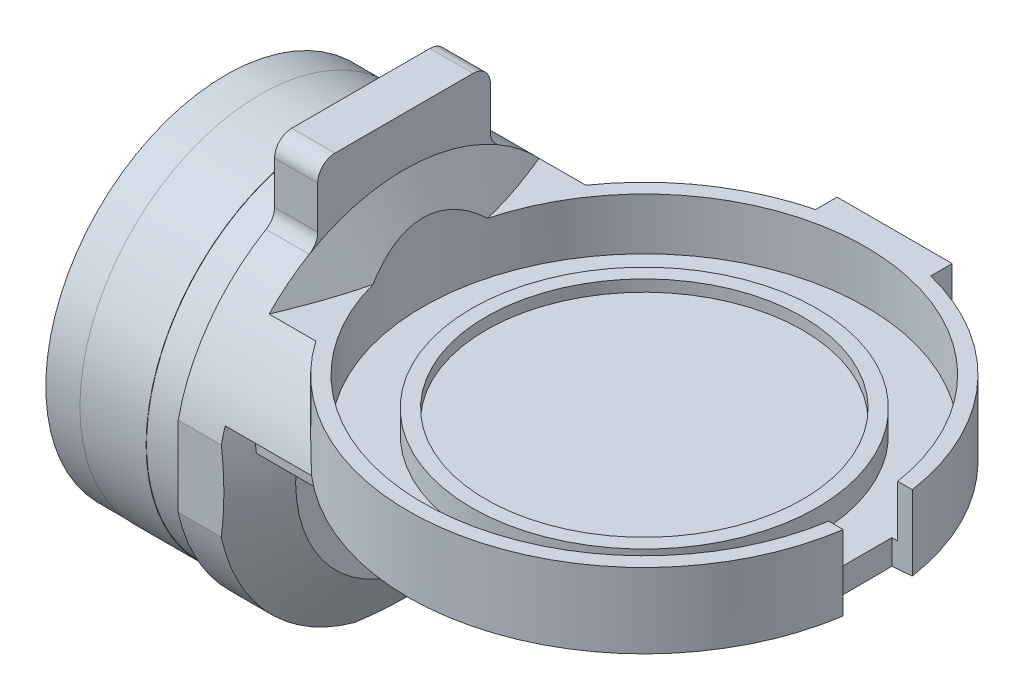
ISO-10303-21;
HEADER;
FILE_DESCRIPTION(('STEP AP214'),'2;1');
FILE_NAME('part.step','',(''),(''),'','','');
FILE_SCHEMA(('AUTOMOTIVE_DESIGN { 1 0 10303 214 1 1 1 1 }'));
ENDSEC;
DATA;
#1=APPLICATION_CONTEXT('core data for automotive mechanical design processes');
#2=APPLICATION_PROTOCOL_DEFINITION('international standard','automotive_design',2000,#1);
#3=PRODUCT_CONTEXT('',#1,'mechanical');
#4=PRODUCT('Part','Part','',(#3));
#5=PRODUCT_RELATED_PRODUCT_CATEGORY('part','',(#4));
#6=PRODUCT_DEFINITION_FORMATION('','',#4);
#7=PRODUCT_DEFINITION_CONTEXT('part definition',#1,'design');
#8=PRODUCT_DEFINITION('design','',#6,#7);
#9=PRODUCT_DEFINITION_SHAPE('','',#8);
#10=(LENGTH_UNIT() NAMED_UNIT(*) SI_UNIT(.MILLI.,.METRE.));
#11=(NAMED_UNIT(*) PLANE_ANGLE_UNIT() SI_UNIT($,.RADIAN.));
#12=(NAMED_UNIT(*) SI_UNIT($,.STERADIAN.) SOLID_ANGLE_UNIT());
#13=UNCERTAINTY_MEASURE_WITH_UNIT(LENGTH_MEASURE(1.E-05),#10,'distance_accuracy_value','');
#14=(GEOMETRIC_REPRESENTATION_CONTEXT(3) GLOBAL_UNCERTAINTY_ASSIGNED_CONTEXT((#13)) GLOBAL_UNIT_ASSIGNED_CONTEXT((#10,
#11,#12)) REPRESENTATION_CONTEXT('',''));
#15=CARTESIAN_POINT('',(0.,0.,0.));
#16=DIRECTION('',(0.,0.,1.));
#17=DIRECTION('',(1.,0.,0.));
#18=AXIS2_PLACEMENT_3D('',#15,#16,#17);
#19=CARTESIAN_POINT('',(82.,45.,0.));
#20=DIRECTION('',(0.,-1.,0.));
#21=DIRECTION('',(0.,0.,-1.));
#22=AXIS2_PLACEMENT_3D('',#19,#20,#21);
#23=PLANE('',#22);
#24=DIRECTION('',(1.,0.,0.));
#25=VECTOR('',#24,1.);
#26=CARTESIAN_POINT('',(82.,45.,-87.));
#27=LINE('',#26,#25);
#28=CARTESIAN_POINT('',(-20.,45.,-87.));
#29=VERTEX_POINT('',#28);
#30=CARTESIAN_POINT('',(20.,45.,-87.));
#31=VERTEX_POINT('',#30);
#32=EDGE_CURVE('E706',#29,#31,#27,.T.);
#33=ORIENTED_EDGE('',*,*,#32,.F.);
#34=DIRECTION('',(0.,0.,-1.));
#35=VECTOR('',#34,1.);
#36=CARTESIAN_POINT('',(-20.,45.,82.001));
#37=LINE('',#36,#35);
#38=CARTESIAN_POINT('',(-20.,45.,-79.5235814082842));
#39=VERTEX_POINT('',#38);
#40=EDGE_CURVE('E158',#39,#29,#37,.T.);
#41=ORIENTED_EDGE('',*,*,#40,.F.);
#42=CARTESIAN_POINT('',(0.,45.,0.));
#43=DIRECTION('',(0.,1.,0.));
#44=DIRECTION('',(0.,0.,1.));
#45=AXIS2_PLACEMENT_3D('',#42,#43,#44);
#46=CIRCLE('',#45,82.);
#47=CARTESIAN_POINT('',(-67.2606868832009,45.,-46.9041575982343));
#48=VERTEX_POINT('',#47);
#49=EDGE_CURVE('E488',#39,#48,#46,.T.);
#50=ORIENTED_EDGE('',*,*,#49,.T.);
#51=DIRECTION('',(-1.,0.,0.));
#52=VECTOR('',#51,1.);
#53=CARTESIAN_POINT('',(132.215732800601,45.,-46.9041575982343));
#54=LINE('',#53,#52);
#55=CARTESIAN_POINT('',(-83.5,45.,-46.9041575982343));
#56=VERTEX_POINT('',#55);
#57=EDGE_CURVE('E217',#48,#56,#54,.T.);
#58=ORIENTED_EDGE('',*,*,#57,.T.);
#59=CARTESIAN_POINT('',(-132.616561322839,45.,143.166752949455));
#60=CARTESIAN_POINT('',(-131.745233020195,45.,141.584766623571));
#61=CARTESIAN_POINT('',(-130.874895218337,45.,140.002235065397));
#62=CARTESIAN_POINT('',(-129.13641214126,45.,136.835967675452));
#63=CARTESIAN_POINT('',(-128.268266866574,45.,135.252231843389));
#64=CARTESIAN_POINT('',(-125.667417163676,45.,130.49901074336));
#65=CARTESIAN_POINT('',(-123.938319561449,45.,127.327549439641));
#66=CARTESIAN_POINT('',(-121.35309418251,45.,122.564736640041));
#67=CARTESIAN_POINT('',(-120.492536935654,45.,120.975788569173));
#68=CARTESIAN_POINT('',(-118.774725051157,45.,117.796109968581));
#69=CARTESIAN_POINT('',(-117.917470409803,45.,116.205379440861));
#70=CARTESIAN_POINT('',(-116.20665423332,45.,113.021946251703));
#71=CARTESIAN_POINT('',(-115.353092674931,45.,111.429243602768));
#72=CARTESIAN_POINT('',(-113.650104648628,45.,108.241619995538));
#73=CARTESIAN_POINT('',(-112.800678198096,45.,106.646699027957));
#74=CARTESIAN_POINT('',(-111.091131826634,45.,103.425445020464));
#75=CARTESIAN_POINT('',(-110.231097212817,45.,101.799066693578));
#76=CARTESIAN_POINT('',(-108.516512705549,45.,98.5434217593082));
#77=CARTESIAN_POINT('',(-107.661962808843,45.,96.9141551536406));
#78=CARTESIAN_POINT('',(-105.959120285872,45.,93.6523638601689));
#79=CARTESIAN_POINT('',(-105.110827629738,45.,92.0198391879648));
#80=CARTESIAN_POINT('',(-103.421411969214,45.,88.7510864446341));
#81=CARTESIAN_POINT('',(-102.580288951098,45.,87.1148583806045));
#82=CARTESIAN_POINT('',(-100.906492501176,45.,83.8385419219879));
#83=CARTESIAN_POINT('',(-100.073817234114,45.,82.1984544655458));
#84=CARTESIAN_POINT('',(-98.4180459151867,45.,78.9134450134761));
#85=CARTESIAN_POINT('',(-97.5949498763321,45.,77.2685230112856));
#86=CARTESIAN_POINT('',(-95.9599616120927,45.,73.9731660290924));
#87=CARTESIAN_POINT('',(-95.1480691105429,45.,72.3227311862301));
#88=CARTESIAN_POINT('',(-93.537433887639,45.,69.0154635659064));
#89=CARTESIAN_POINT('',(-92.7386910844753,45.,67.358630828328));
#90=CARTESIAN_POINT('',(-91.1416925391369,45.,64.0058991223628));
#91=CARTESIAN_POINT('',(-90.3437361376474,45.,62.3098573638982));
#92=CARTESIAN_POINT('',(-88.7671601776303,45.,58.9087890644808));
#93=CARTESIAN_POINT('',(-87.9885406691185,45.,57.2037625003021));
#94=CARTESIAN_POINT('',(-86.4544246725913,45.,53.782757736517));
#95=CARTESIAN_POINT('',(-85.6989345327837,45.,52.0667766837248));
#96=CARTESIAN_POINT('',(-84.2163455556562,45.,48.6225674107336));
#97=CARTESIAN_POINT('',(-83.4892465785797,45.,46.8943392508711));
#98=CARTESIAN_POINT('',(-82.0718637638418,45.,43.4285893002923));
#99=CARTESIAN_POINT('',(-81.3814802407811,45.,41.6911084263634));
#100=CARTESIAN_POINT('',(-80.0432853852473,45.,38.1996702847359));
#101=CARTESIAN_POINT('',(-79.3954756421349,45.,36.4457124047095));
#102=CARTESIAN_POINT('',(-78.1527166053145,45.,32.9196037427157));
#103=CARTESIAN_POINT('',(-77.5577529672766,45.,31.1474580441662));
#104=CARTESIAN_POINT('',(-76.4329799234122,45.,27.5825860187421));
#105=CARTESIAN_POINT('',(-75.9031634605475,45.,25.7898619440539));
#106=CARTESIAN_POINT('',(-75.0782960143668,45.,22.752430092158));
#107=CARTESIAN_POINT('',(-74.7619546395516,45.,21.513505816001));
#108=CARTESIAN_POINT('',(-74.1720085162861,45.,19.0254717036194));
#109=CARTESIAN_POINT('',(-73.8984030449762,45.,17.7763620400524));
#110=CARTESIAN_POINT('',(-73.3994253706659,45.,15.2688270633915));
#111=CARTESIAN_POINT('',(-73.1740403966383,45.,14.0104043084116));
#112=CARTESIAN_POINT('',(-72.7766604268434,45.,11.4850957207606));
#113=CARTESIAN_POINT('',(-72.6046651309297,45.,10.218209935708));
#114=CARTESIAN_POINT('',(-72.3195574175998,45.,7.68609677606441));
#115=CARTESIAN_POINT('',(-72.2060703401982,45.,6.42091193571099));
#116=CARTESIAN_POINT('',(-72.0395859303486,45.,3.88655250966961));
#117=CARTESIAN_POINT('',(-71.9865874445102,45.,2.61737800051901));
#118=CARTESIAN_POINT('',(-71.9426996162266,45.,0.0780203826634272));
#119=CARTESIAN_POINT('',(-71.9518070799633,45.,-1.19216267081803));
#120=CARTESIAN_POINT('',(-72.0318548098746,45.,-3.73064517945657));
#121=CARTESIAN_POINT('',(-72.102797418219,45.,-4.99894456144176));
#122=CARTESIAN_POINT('',(-72.2666831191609,45.,-7.0577881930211));
#123=CARTESIAN_POINT('',(-72.3415102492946,45.,-7.84983003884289));
#124=CARTESIAN_POINT('',(-72.5137092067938,45.,-9.43148384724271));
#125=CARTESIAN_POINT('',(-72.6110815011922,45.,-10.2210957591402));
#126=CARTESIAN_POINT('',(-72.8273530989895,45.,-11.7974043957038));
#127=CARTESIAN_POINT('',(-72.946253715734,45.,-12.5841009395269));
#128=CARTESIAN_POINT('',(-73.2044059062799,45.,-14.154160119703));
#129=CARTESIAN_POINT('',(-73.3436583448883,45.,-14.9375226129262));
#130=CARTESIAN_POINT('',(-73.7902857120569,45.,-17.2832949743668));
#131=CARTESIAN_POINT('',(-74.1263773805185,45.,-18.8402961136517));
#132=CARTESIAN_POINT('',(-74.8645495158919,45.,-21.9383311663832));
#133=CARTESIAN_POINT('',(-75.2666295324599,45.,-23.4793651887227));
#134=CARTESIAN_POINT('',(-76.1359073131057,45.,-26.5784788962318));
#135=CARTESIAN_POINT('',(-76.6043149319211,45.,-28.1362171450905));
#136=CARTESIAN_POINT('',(-77.5898489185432,45.,-31.2361250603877));
#137=CARTESIAN_POINT('',(-78.1069755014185,45.,-32.7782946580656));
#138=CARTESIAN_POINT('',(-78.9129563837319,45.,-35.0805548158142));
#139=CARTESIAN_POINT('',(-79.1866172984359,45.,-35.8460164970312));
#140=CARTESIAN_POINT('',(-79.7431900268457,45.,-37.373572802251));
#141=CARTESIAN_POINT('',(-80.0261018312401,45.,-38.1356674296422));
#142=CARTESIAN_POINT('',(-80.6003479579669,45.,-39.6566528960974));
#143=CARTESIAN_POINT('',(-80.8916820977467,45.,-40.4155438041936));
#144=CARTESIAN_POINT('',(-81.4820436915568,45.,-41.9303263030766));
#145=CARTESIAN_POINT('',(-81.7810711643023,45.,-42.686217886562));
#146=CARTESIAN_POINT('',(-82.5381816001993,45.,-44.5743365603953));
#147=CARTESIAN_POINT('',(-83.0006797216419,45.,-45.7047942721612));
#148=CARTESIAN_POINT('',(-83.9395290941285,45.,-47.9599523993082));
#149=CARTESIAN_POINT('',(-84.4158805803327,45.,-49.0846527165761));
#150=CARTESIAN_POINT('',(-85.3807560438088,45.,-51.3289015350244));
#151=CARTESIAN_POINT('',(-85.8692808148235,45.,-52.4484496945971));
#152=CARTESIAN_POINT('',(-86.8570053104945,45.,-54.6828149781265));
#153=CARTESIAN_POINT('',(-87.3562049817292,45.,-55.7976321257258));
#154=CARTESIAN_POINT('',(-88.3641616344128,45.,-58.0233021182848));
#155=CARTESIAN_POINT('',(-88.8729211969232,45.,-59.1341537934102));
#156=CARTESIAN_POINT('',(-89.89879091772,45.,-61.3519969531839));
#157=CARTESIAN_POINT('',(-90.4159011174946,45.,-62.4589884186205));
#158=CARTESIAN_POINT('',(-91.9782854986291,45.,-65.774655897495));
#159=CARTESIAN_POINT('',(-93.034651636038,45.,-67.9781088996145));
#160=CARTESIAN_POINT('',(-95.1722558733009,45.,-72.376347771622));
#161=CARTESIAN_POINT('',(-96.253523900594,45.,-74.5711190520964));
#162=CARTESIAN_POINT('',(-98.4351139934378,45.,-78.9511763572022));
#163=CARTESIAN_POINT('',(-99.5354361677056,45.,-81.1364623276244));
#164=CARTESIAN_POINT('',(-101.751461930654,45.,-85.4987771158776));
#165=CARTESIAN_POINT('',(-102.867163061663,45.,-87.6758071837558));
#166=CARTESIAN_POINT('',(-105.111409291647,45.,-92.023225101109));
#167=CARTESIAN_POINT('',(-106.239954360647,45.,-94.1936129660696));
#168=CARTESIAN_POINT('',(-108.402355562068,45.,-98.3272711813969));
#169=CARTESIAN_POINT('',(-109.435261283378,45.,-100.29103911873));
#170=CARTESIAN_POINT('',(-111.50862214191,45.,-104.214583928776));
#171=CARTESIAN_POINT('',(-112.549077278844,45.,-106.174360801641));
#172=CARTESIAN_POINT('',(-114.636535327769,45.,-110.090532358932));
#173=CARTESIAN_POINT('',(-115.683538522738,45.,-112.046926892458));
#174=CARTESIAN_POINT('',(-117.783184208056,45.,-115.956687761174));
#175=CARTESIAN_POINT('',(-118.835826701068,45.,-117.910054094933));
#176=CARTESIAN_POINT('',(-120.943113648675,45.,-121.808731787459));
#177=CARTESIAN_POINT('',(-121.997744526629,45.,-123.754050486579));
#178=CARTESIAN_POINT('',(-124.111299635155,45.,-127.642354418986));
#179=CARTESIAN_POINT('',(-125.170223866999,45.,-129.585339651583));
#180=CARTESIAN_POINT('',(-127.291789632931,45.,-133.469122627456));
#181=CARTESIAN_POINT('',(-128.354430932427,45.,-135.409920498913));
#182=CARTESIAN_POINT('',(-130.483077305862,45.,-139.289667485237));
#183=CARTESIAN_POINT('',(-131.549082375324,45.,-141.22861660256));
#184=CARTESIAN_POINT('',(-132.616561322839,45.,-143.166752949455));
#185=B_SPLINE_CURVE_WITH_KNOTS('',3,(#59,#60,#61,#62,#63,#64,#65,#66,#67,#68,#69,#70,#71,#72,
#73,#74,#75,#76,#77,#78,#79,#80,#81,#82,#83,#84,#85,#86,#87,#88,#89,#90,#91,#92,#93,#94,#95,#96,
#97,#98,#99,#100,#101,#102,#103,#104,#105,#106,#107,#108,#109,#110,#111,#112,#113,#114,#115,
#116,#117,#118,#119,#120,#121,#122,#123,#124,#125,#126,#127,#128,#129,#130,#131,#132,#133,#134,
#135,#136,#137,#138,#139,#140,#141,#142,#143,#144,#145,#146,#147,#148,#149,#150,#151,#152,#153,
#154,#155,#156,#157,#158,#159,#160,#161,#162,#163,#164,#165,#166,#167,#168,#169,#170,#171,#172,
#173,#174,#175,#176,#177,#178,#179,#180,#181,#182,#183,#184),.UNSPECIFIED.,.F.,.F.,(4,2,2,2,2,2,
2,2,2,2,2,2,2,2,2,2,2,2,2,2,2,2,2,2,2,2,2,2,2,2,2,2,2,2,2,2,2,2,2,2,2,2,2,2,2,2,2,2,2,2,2,2,2,2,
2,2,2,2,2,2,2,2,4),(0.,5.41821297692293,10.8364272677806,21.672984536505,27.0940360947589,
32.5150815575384,37.9360928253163,43.3571268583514,48.8764377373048,54.395745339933,
59.9150265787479,65.4342972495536,70.9523420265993,76.4703942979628,81.9883103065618,
87.5061919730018,93.1292243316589,98.7522712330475,104.376847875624,110.001396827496,
115.609800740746,121.218413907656,126.825500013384,132.431978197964,136.267361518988,
140.102679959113,143.936981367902,147.771261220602,151.580673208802,155.390012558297,
159.199156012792,163.008443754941,165.394854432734,167.781314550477,170.167920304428,
172.554627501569,177.331351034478,182.108041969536,186.987001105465,191.865981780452,
194.304663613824,196.743342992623,199.181969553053,201.620602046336,205.284714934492,
208.94889005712,212.613304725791,216.277701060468,219.943101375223,223.608519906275,
230.939080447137,238.278965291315,245.618892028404,252.957659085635,260.296409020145,
266.952929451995,273.609449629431,280.266259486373,286.92307248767,293.56148490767,
300.199899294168,306.837902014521,313.475895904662),.UNSPECIFIED.);
#186=CARTESIAN_POINT('',(-74.381916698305,45.,-19.9080503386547));
#187=VERTEX_POINT('',#186);
#188=EDGE_CURVE('E313',#187,#56,#185,.T.);
#189=ORIENTED_EDGE('',*,*,#188,.F.);
#190=CARTESIAN_POINT('',(0.,45.,0.));
#191=DIRECTION('',(0.,-1.,0.));
#192=DIRECTION('',(0.,0.,-1.));
#193=AXIS2_PLACEMENT_3D('',#190,#191,#192);
#194=CIRCLE('',#193,77.);
#195=CARTESIAN_POINT('',(76.0591874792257,45.,-12.));
#196=VERTEX_POINT('',#195);
#197=EDGE_CURVE('E690',#187,#196,#194,.T.);
#198=ORIENTED_EDGE('',*,*,#197,.T.);
#199=DIRECTION('',(1.,0.,0.));
#200=VECTOR('',#199,1.);
#201=CARTESIAN_POINT('',(82.,45.,-12.));
#202=LINE('',#201,#200);
#203=CARTESIAN_POINT('',(81.117199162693,45.,-12.));
#204=VERTEX_POINT('',#203);
#205=EDGE_CURVE('E674',#196,#204,#202,.T.);
#206=ORIENTED_EDGE('',*,*,#205,.T.);
#207=CARTESIAN_POINT('',(20.,45.,-79.5235814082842));
#208=VERTEX_POINT('',#207);
#209=EDGE_CURVE('E486',#204,#208,#46,.T.);
#210=ORIENTED_EDGE('',*,*,#209,.T.);
#211=DIRECTION('',(0.,0.,-1.));
#212=VECTOR('',#211,1.);
#213=CARTESIAN_POINT('',(20.,45.,82.001));
#214=LINE('',#213,#212);
#215=EDGE_CURVE('E162',#208,#31,#214,.T.);
#216=ORIENTED_EDGE('',*,*,#215,.T.);
#217=EDGE_LOOP('',(#33,#41,#50,#58,#189,#198,#206,#210,#216));
#218=FACE_BOUND('',#217,.T.);
#219=ADVANCED_FACE('F16',(#218),#23,.F.);
#220=CARTESIAN_POINT('',(20.,45.,82.001));
#221=DIRECTION('',(-1.,0.,0.));
#222=DIRECTION('',(0.,0.,1.));
#223=AXIS2_PLACEMENT_3D('',#220,#221,#222);
#224=PLANE('',#223);
#225=DIRECTION('',(0.,0.,-1.));
#226=VECTOR('',#225,1.);
#227=CARTESIAN_POINT('',(20.,26.,82.001));
#228=LINE('',#227,#226);
#229=CARTESIAN_POINT('',(20.,26.,-87.));
#230=VERTEX_POINT('',#229);
#231=CARTESIAN_POINT('',(20.,26.,-90.));
#232=VERTEX_POINT('',#231);
#233=EDGE_CURVE('E1037',#230,#232,#228,.T.);
#234=ORIENTED_EDGE('',*,*,#233,.F.);
#235=DIRECTION('',(0.,-1.,0.));
#236=VECTOR('',#235,1.);
#237=CARTESIAN_POINT('',(20.,45.,-87.));
#238=LINE('',#237,#236);
#239=EDGE_CURVE('E703',#31,#230,#238,.T.);
#240=ORIENTED_EDGE('',*,*,#239,.F.);
#241=ORIENTED_EDGE('',*,*,#215,.F.);
#242=DIRECTION('',(0.,1.,0.));
#243=VECTOR('',#242,1.);
#244=CARTESIAN_POINT('',(20.,62.758560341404,-79.5235814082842));
#245=LINE('',#244,#243);
#246=CARTESIAN_POINT('',(20.,19.,-79.5235814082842));
#247=VERTEX_POINT('',#246);
#248=EDGE_CURVE('E154',#247,#208,#245,.T.);
#249=ORIENTED_EDGE('',*,*,#248,.F.);
#250=DIRECTION('',(0.,0.,-1.));
#251=VECTOR('',#250,1.);
#252=CARTESIAN_POINT('',(20.,19.,82.001));
#253=LINE('',#252,#251);
#254=CARTESIAN_POINT('',(20.,19.,-90.));
#255=VERTEX_POINT('',#254);
#256=EDGE_CURVE('E153',#247,#255,#253,.T.);
#257=ORIENTED_EDGE('',*,*,#256,.T.);
#258=DIRECTION('',(0.,1.,0.));
#259=VECTOR('',#258,1.);
#260=CARTESIAN_POINT('',(20.,45.,-90.));
#261=LINE('',#260,#259);
#262=EDGE_CURVE('E129',#255,#232,#261,.T.);
#263=ORIENTED_EDGE('',*,*,#262,.T.);
#264=EDGE_LOOP('',(#234,#240,#241,#249,#257,#263));
#265=FACE_BOUND('',#264,.T.);
#266=ADVANCED_FACE('F418',(#265),#224,.F.);
#267=CARTESIAN_POINT('',(-20.,45.,82.001));
#268=DIRECTION('',(1.,0.,0.));
#269=DIRECTION('',(0.,0.,-1.));
#270=AXIS2_PLACEMENT_3D('',#267,#268,#269);
#271=PLANE('',#270);
#272=DIRECTION('',(0.,0.,1.));
#273=VECTOR('',#272,1.);
#274=CARTESIAN_POINT('',(-20.,26.,82.001));
#275=LINE('',#274,#273);
#276=CARTESIAN_POINT('',(-20.,26.,-90.));
#277=VERTEX_POINT('',#276);
#278=CARTESIAN_POINT('',(-20.,26.,-87.));
#279=VERTEX_POINT('',#278);
#280=EDGE_CURVE('E1044',#277,#279,#275,.T.);
#281=ORIENTED_EDGE('',*,*,#280,.F.);
#282=DIRECTION('',(0.,-1.,0.));
#283=VECTOR('',#282,1.);
#284=CARTESIAN_POINT('',(-20.,45.,-90.));
#285=LINE('',#284,#283);
#286=CARTESIAN_POINT('',(-20.,19.,-90.));
#287=VERTEX_POINT('',#286);
#288=EDGE_CURVE('E138',#277,#287,#285,.T.);
#289=ORIENTED_EDGE('',*,*,#288,.T.);
#290=DIRECTION('',(0.,0.,-1.));
#291=VECTOR('',#290,1.);
#292=CARTESIAN_POINT('',(-20.,19.,82.001));
#293=LINE('',#292,#291);
#294=CARTESIAN_POINT('',(-20.,19.,-79.5235814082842));
#295=VERTEX_POINT('',#294);
#296=EDGE_CURVE('E144',#295,#287,#293,.T.);
#297=ORIENTED_EDGE('',*,*,#296,.F.);
#298=DIRECTION('',(0.,1.,0.));
#299=VECTOR('',#298,1.);
#300=CARTESIAN_POINT('',(-20.,62.758560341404,-79.5235814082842));
#301=LINE('',#300,#299);
#302=EDGE_CURVE('E150',#39,#295,#301,.F.);
#303=ORIENTED_EDGE('',*,*,#302,.F.);
#304=ORIENTED_EDGE('',*,*,#40,.T.);
#305=DIRECTION('',(0.,1.,0.));
#306=VECTOR('',#305,1.);
#307=CARTESIAN_POINT('',(-20.,45.,-87.));
#308=LINE('',#307,#306);
#309=EDGE_CURVE('E966',#279,#29,#308,.T.);
#310=ORIENTED_EDGE('',*,*,#309,.F.);
#311=EDGE_LOOP('',(#281,#289,#297,#303,#304,#310));
#312=FACE_BOUND('',#311,.T.);
#313=ADVANCED_FACE('F414',(#312),#271,.F.);
#314=CARTESIAN_POINT('',(20.,19.,-90.));
#315=DIRECTION('',(0.,0.,-1.));
#316=DIRECTION('',(-1.,0.,0.));
#317=AXIS2_PLACEMENT_3D('',#314,#315,#316);
#318=PLANE('',#317);
#319=ORIENTED_EDGE('',*,*,#288,.F.);
#320=DIRECTION('',(1.,0.,0.));
#321=VECTOR('',#320,1.);
#322=CARTESIAN_POINT('',(20.,26.,-90.));
#323=LINE('',#322,#321);
#324=EDGE_CURVE('E962',#277,#232,#323,.T.);
#325=ORIENTED_EDGE('',*,*,#324,.T.);
#326=ORIENTED_EDGE('',*,*,#262,.F.);
#327=DIRECTION('',(1.,0.,0.));
#328=VECTOR('',#327,1.);
#329=CARTESIAN_POINT('',(-20.,19.,-90.));
#330=LINE('',#329,#328);
#331=EDGE_CURVE('E121',#287,#255,#330,.T.);
#332=ORIENTED_EDGE('',*,*,#331,.F.);
#333=EDGE_LOOP('',(#319,#325,#326,#332));
#334=FACE_BOUND('',#333,.T.);
#335=ADVANCED_FACE('F410',(#334),#318,.T.);
#336=CARTESIAN_POINT('',(0.,62.758560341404,0.));
#337=DIRECTION('',(0.,1.,0.));
#338=DIRECTION('',(0.,0.,1.));
#339=AXIS2_PLACEMENT_3D('',#336,#337,#338);
#340=CYLINDRICAL_SURFACE('',#339,82.);
#341=CARTESIAN_POINT('',(0.,19.,0.));
#342=DIRECTION('',(0.,1.,0.));
#343=DIRECTION('',(0.,0.,1.));
#344=AXIS2_PLACEMENT_3D('',#341,#342,#343);
#345=CIRCLE('',#344,82.);
#346=CARTESIAN_POINT('',(-53.4789678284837,19.,62.1610810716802));
#347=VERTEX_POINT('',#346);
#348=CARTESIAN_POINT('',(81.117199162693,19.,12.));
#349=VERTEX_POINT('',#348);
#350=EDGE_CURVE('E1114',#347,#349,#345,.T.);
#351=ORIENTED_EDGE('',*,*,#350,.T.);
#352=DIRECTION('',(0.,1.,0.));
#353=VECTOR('',#352,1.);
#354=CARTESIAN_POINT('',(81.117199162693,62.758560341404,12.));
#355=LINE('',#354,#353);
#356=CARTESIAN_POINT('',(81.117199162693,45.,12.));
#357=VERTEX_POINT('',#356);
#358=EDGE_CURVE('E1086',#349,#357,#355,.T.);
#359=ORIENTED_EDGE('',*,*,#358,.T.);
#360=CARTESIAN_POINT('',(-67.2606868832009,45.,46.9041575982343));
#361=VERTEX_POINT('',#360);
#362=EDGE_CURVE('E471',#361,#357,#46,.T.);
#363=ORIENTED_EDGE('',*,*,#362,.F.);
#364=CARTESIAN_POINT('',(-49.9899989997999,0.,65.));
#365=CARTESIAN_POINT('',(-49.9899980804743,-0.61838056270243,65.0000003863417));
#366=CARTESIAN_POINT('',(-50.0014853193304,-1.23675096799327,64.9911709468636));
#367=CARTESIAN_POINT('',(-50.047284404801,-2.47220081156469,64.9559093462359));
#368=CARTESIAN_POINT('',(-50.0815984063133,-3.08928012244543,64.9294755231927));
#369=CARTESIAN_POINT('',(-50.1726160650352,-4.32068069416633,64.8591698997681));
#370=CARTESIAN_POINT('',(-50.2293157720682,-4.93500242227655,64.8153011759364));
#371=CARTESIAN_POINT('',(-50.3643956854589,-6.15980649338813,64.7103920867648));
#372=CARTESIAN_POINT('',(-50.4427784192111,-6.77028838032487,64.6493497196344));
#373=CARTESIAN_POINT('',(-50.7094560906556,-8.59644965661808,64.4406926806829));
#374=CARTESIAN_POINT('',(-50.9291289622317,-9.8048574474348,64.2676629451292));
#375=CARTESIAN_POINT('',(-51.4425909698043,-12.1944389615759,63.8573968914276));
#376=CARTESIAN_POINT('',(-51.7363928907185,-13.3756079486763,63.6201494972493));
#377=CARTESIAN_POINT('',(-52.4983768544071,-16.1037502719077,62.9939619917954));
#378=CARTESIAN_POINT('',(-52.9918607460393,-17.6381459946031,62.5808813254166));
#379=CARTESIAN_POINT('',(-54.0668094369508,-20.6444723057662,61.6545449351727));
#380=CARTESIAN_POINT('',(-54.6483086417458,-22.1163781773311,61.1412500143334));
#381=CARTESIAN_POINT('',(-55.8772939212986,-24.9995302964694,60.0201761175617));
#382=CARTESIAN_POINT('',(-56.524935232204,-26.4106222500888,59.4121730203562));
#383=CARTESIAN_POINT('',(-57.8651167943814,-29.1689063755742,58.1076806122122));
#384=CARTESIAN_POINT('',(-58.5576566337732,-30.5160991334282,57.4111921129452));
#385=CARTESIAN_POINT('',(-59.7398416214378,-32.7170481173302,56.1749553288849));
#386=CARTESIAN_POINT('',(-60.2217949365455,-33.588126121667,55.6584108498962));
#387=CARTESIAN_POINT('',(-61.1941947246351,-35.3019496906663,54.5874845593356));
#388=CARTESIAN_POINT('',(-61.6846417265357,-36.1446934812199,54.0331003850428));
#389=CARTESIAN_POINT('',(-62.6701444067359,-37.8019956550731,52.8869031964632));
#390=CARTESIAN_POINT('',(-63.1652014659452,-38.6165452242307,52.2950786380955));
#391=CARTESIAN_POINT('',(-64.156135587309,-40.216968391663,51.0745355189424));
#392=CARTESIAN_POINT('',(-64.6520126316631,-41.002842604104,50.4458177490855));
#393=CARTESIAN_POINT('',(-65.6408285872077,-42.5448950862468,49.1522521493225));
#394=CARTESIAN_POINT('',(-66.1337694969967,-43.3010961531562,48.4874330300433));
#395=CARTESIAN_POINT('',(-67.1139276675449,-44.7837992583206,47.1214117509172));
#396=CARTESIAN_POINT('',(-67.601144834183,-45.5103008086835,46.4202089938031));
#397=CARTESIAN_POINT('',(-68.5666360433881,-46.9324628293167,44.9818448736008));
#398=CARTESIAN_POINT('',(-69.0449130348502,-47.6281335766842,44.2446956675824));
#399=CARTESIAN_POINT('',(-69.9897124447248,-48.987740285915,42.7344565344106));
#400=CARTESIAN_POINT('',(-70.4562343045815,-49.6516747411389,41.9613649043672));
#401=CARTESIAN_POINT('',(-71.6552965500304,-51.3422138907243,39.8959778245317));
#402=CARTESIAN_POINT('',(-72.3761844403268,-52.3425089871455,38.5750985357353));
#403=CARTESIAN_POINT('',(-73.7675296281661,-54.2501040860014,35.8427409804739));
#404=CARTESIAN_POINT('',(-74.4379892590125,-55.1574083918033,34.4312669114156));
#405=CARTESIAN_POINT('',(-75.7155006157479,-56.869688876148,31.5227282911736));
#406=CARTESIAN_POINT('',(-76.3226307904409,-57.6747919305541,30.0257732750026));
#407=CARTESIAN_POINT('',(-77.4620975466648,-59.1744385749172,26.9501631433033));
#408=CARTESIAN_POINT('',(-77.9944462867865,-59.8690001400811,25.3715213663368));
#409=CARTESIAN_POINT('',(-78.8944975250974,-61.0365205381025,22.3980433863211));
#410=CARTESIAN_POINT('',(-79.2749191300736,-61.5271551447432,21.0139807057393));
#411=CARTESIAN_POINT('',(-79.9677980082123,-62.4173605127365,18.2002646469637));
#412=CARTESIAN_POINT('',(-80.2802621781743,-62.816940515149,16.7706159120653));
#413=CARTESIAN_POINT('',(-80.8311594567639,-63.5194761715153,13.8742828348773));
#414=CARTESIAN_POINT('',(-81.0696203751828,-63.8224681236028,12.4076126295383));
#415=CARTESIAN_POINT('',(-81.4677749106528,-64.3274630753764,9.44633744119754));
#416=CARTESIAN_POINT('',(-81.6274675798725,-64.5294648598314,7.9517321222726));
#417=CARTESIAN_POINT('',(-81.86500915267,-64.8296861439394,4.94051656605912));
#418=CARTESIAN_POINT('',(-81.942581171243,-64.92755454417,3.42384925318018));
#419=CARTESIAN_POINT('',(-82.0131738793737,-65.0166242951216,0.385400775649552));
#420=CARTESIAN_POINT('',(-82.006194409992,-65.0078254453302,-1.13638039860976));
#421=CARTESIAN_POINT('',(-81.9078427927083,-64.8837123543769,-4.17289527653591));
#422=CARTESIAN_POINT('',(-81.8164666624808,-64.7683930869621,-5.6876286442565));
#423=CARTESIAN_POINT('',(-81.5513705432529,-64.4331944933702,-8.69812009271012));
#424=CARTESIAN_POINT('',(-81.3776522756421,-64.2133173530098,-10.1938785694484));
#425=CARTESIAN_POINT('',(-80.9627514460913,-63.6866700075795,-13.0784077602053));
#426=CARTESIAN_POINT('',(-80.725550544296,-63.3850176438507,-14.4686951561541));
#427=CARTESIAN_POINT('',(-80.1849442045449,-62.6950653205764,-17.2143078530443));
#428=CARTESIAN_POINT('',(-79.8815416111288,-62.3067690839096,-18.5696346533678));
#429=CARTESIAN_POINT('',(-79.2136961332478,-61.4482092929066,-21.2387228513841));
#430=CARTESIAN_POINT('',(-78.8492455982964,-60.9779354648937,-22.5524790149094));
#431=CARTESIAN_POINT('',(-78.0650962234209,-59.9605227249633,-25.1328366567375));
#432=CARTESIAN_POINT('',(-77.6453941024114,-59.4133792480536,-26.3994353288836));
#433=CARTESIAN_POINT('',(-76.7131838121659,-58.1900729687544,-29.0031472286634));
#434=CARTESIAN_POINT('',(-76.1956093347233,-57.5065166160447,-30.3349701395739));
#435=CARTESIAN_POINT('',(-75.10943529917,-56.0593961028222,-32.9325844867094));
#436=CARTESIAN_POINT('',(-74.5408329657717,-55.2958275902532,-34.198372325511));
#437=CARTESIAN_POINT('',(-73.3606453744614,-53.6942971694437,-36.6617201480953));
#438=CARTESIAN_POINT('',(-72.749041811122,-52.8563035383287,-37.8592506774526));
#439=CARTESIAN_POINT('',(-71.4913232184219,-51.1113977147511,-40.1837957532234));
#440=CARTESIAN_POINT('',(-70.8452065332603,-50.2044822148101,-41.310806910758));
#441=CARTESIAN_POINT('',(-69.3913160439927,-48.1332086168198,-43.7173413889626));
#442=CARTESIAN_POINT('',(-68.5775802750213,-46.9542152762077,-44.9806930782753));
#443=CARTESIAN_POINT('',(-66.9264875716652,-44.508085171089,-47.4024633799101));
#444=CARTESIAN_POINT('',(-66.0891266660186,-43.2409335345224,-48.5608642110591));
#445=CARTESIAN_POINT('',(-64.4053853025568,-40.6209627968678,-50.7728276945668));
#446=CARTESIAN_POINT('',(-63.5589960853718,-39.2680527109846,-51.8262758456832));
#447=CARTESIAN_POINT('',(-61.8751694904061,-36.4797518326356,-53.8253692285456));
#448=CARTESIAN_POINT('',(-61.0377309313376,-35.0443720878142,-54.7710288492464));
#449=CARTESIAN_POINT('',(-59.4864377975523,-32.2616114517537,-56.4492222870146));
#450=CARTESIAN_POINT('',(-58.7694758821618,-30.9231974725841,-57.193757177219));
#451=CARTESIAN_POINT('',(-57.3738991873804,-28.1808089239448,-58.5936187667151));
#452=CARTESIAN_POINT('',(-56.6952879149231,-26.7768283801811,-59.2489373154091));
#453=CARTESIAN_POINT('',(-55.3969313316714,-23.9051765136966,-60.4646140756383));
#454=CARTESIAN_POINT('',(-54.7770858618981,-22.4376200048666,-61.025135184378));
#455=CARTESIAN_POINT('',(-53.6180386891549,-19.437229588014,-62.0459701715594));
#456=CARTESIAN_POINT('',(-53.0788030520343,-17.9044234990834,-62.5063262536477));
#457=CARTESIAN_POINT('',(-52.245798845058,-15.2233855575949,-63.2027045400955));
#458=CARTESIAN_POINT('',(-51.925882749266,-14.0901404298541,-63.4652626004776));
#459=CARTESIAN_POINT('',(-51.3507346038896,-11.7953708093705,-63.9315203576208));
#460=CARTESIAN_POINT('',(-51.0954936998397,-10.63385021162,-64.1352281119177));
#461=CARTESIAN_POINT('',(-50.6596240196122,-8.28978551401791,-64.4800743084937));
#462=CARTESIAN_POINT('',(-50.4788612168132,-7.10728320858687,-64.6213251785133));
#463=CARTESIAN_POINT('',(-50.1990459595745,-4.7266085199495,-64.83893515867));
#464=CARTESIAN_POINT('',(-50.099992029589,-3.52843642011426,-64.9152954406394));
#465=CARTESIAN_POINT('',(-49.987990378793,-1.11960130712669,-65.0015848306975));
#466=CARTESIAN_POINT('',(-49.9754760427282,0.0910942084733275,-65.0111795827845));
#467=CARTESIAN_POINT('',(-50.038320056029,2.50879234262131,-64.9628200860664));
#468=CARTESIAN_POINT('',(-50.1136774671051,3.71579500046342,-64.904866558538));
#469=CARTESIAN_POINT('',(-50.3487632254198,6.11792216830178,-64.7226691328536));
#470=CARTESIAN_POINT('',(-50.5085970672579,7.31302991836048,-64.5983423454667));
#471=CARTESIAN_POINT('',(-50.9055308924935,9.68183253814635,-64.2860036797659));
#472=CARTESIAN_POINT('',(-51.142642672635,10.8555241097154,-64.0979820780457));
#473=CARTESIAN_POINT('',(-51.7590019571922,13.4928525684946,-63.6019025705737));
#474=CARTESIAN_POINT('',(-52.1593860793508,14.948023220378,-63.2750805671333));
#475=CARTESIAN_POINT('',(-53.0493667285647,17.8068492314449,-62.5307950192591));
#476=CARTESIAN_POINT('',(-53.5389922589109,19.2104876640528,-62.1133019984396));
#477=CARTESIAN_POINT('',(-54.5883949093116,21.9663488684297,-61.1930974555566));
#478=CARTESIAN_POINT('',(-55.1483373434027,23.3184403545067,-60.6901840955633));
#479=CARTESIAN_POINT('',(-56.319500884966,25.9672468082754,-59.6049572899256));
#480=CARTESIAN_POINT('',(-56.9307239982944,27.2639596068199,-59.0226407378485));
#481=CARTESIAN_POINT('',(-58.0090697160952,29.4392701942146,-57.959867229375));
#482=CARTESIAN_POINT('',(-58.4674086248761,30.3313816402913,-57.4979105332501));
#483=CARTESIAN_POINT('',(-59.3976628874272,32.0879669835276,-56.5364041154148));
#484=CARTESIAN_POINT('',(-59.8695793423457,32.9524386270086,-56.0368513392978));
#485=CARTESIAN_POINT('',(-60.8227595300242,34.6540748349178,-55.0007969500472));
#486=CARTESIAN_POINT('',(-61.3040262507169,35.491230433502,-54.4642833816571));
#487=CARTESIAN_POINT('',(-62.2718613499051,37.1379647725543,-53.3550098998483));
#488=CARTESIAN_POINT('',(-62.7584296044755,37.9475441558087,-52.7822508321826));
#489=CARTESIAN_POINT('',(-63.7337682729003,39.5397201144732,-51.6003333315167));
#490=CARTESIAN_POINT('',(-64.2225402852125,40.3222915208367,-50.9911423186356));
#491=CARTESIAN_POINT('',(-65.1985524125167,41.8593319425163,-49.7371097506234));
#492=CARTESIAN_POINT('',(-65.6857925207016,42.6138008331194,-49.0922680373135));
#493=CARTESIAN_POINT('',(-66.655568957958,44.0939609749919,-47.7672386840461));
#494=CARTESIAN_POINT('',(-67.1381059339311,44.8196562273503,-47.087055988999));
#495=CARTESIAN_POINT('',(-68.0955815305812,46.241588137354,-45.6914424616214));
#496=CARTESIAN_POINT('',(-68.5705201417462,46.9378247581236,-44.9760115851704));
#497=CARTESIAN_POINT('',(-69.5149814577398,48.3071529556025,-43.5022023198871));
#498=CARTESIAN_POINT('',(-69.9843908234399,48.979914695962,-42.7434445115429));
#499=CARTESIAN_POINT('',(-70.9096521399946,50.2930994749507,-41.1902713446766));
#500=CARTESIAN_POINT('',(-71.3655023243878,50.9335183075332,-40.3958513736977));
#501=CARTESIAN_POINT('',(-72.2607765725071,52.1805350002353,-38.7716420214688));
#502=CARTESIAN_POINT('',(-72.700197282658,52.7871259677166,-37.9418454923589));
#503=CARTESIAN_POINT('',(-73.5595462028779,53.9645136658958,-36.2476917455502));
#504=CARTESIAN_POINT('',(-73.9794776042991,54.5353162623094,-35.3833402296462));
#505=CARTESIAN_POINT('',(-74.7959464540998,55.6378510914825,-33.622987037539));
#506=CARTESIAN_POINT('',(-75.1925423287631,56.1696817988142,-32.7270742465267));
#507=CARTESIAN_POINT('',(-75.9606108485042,57.1937854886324,-30.9025123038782));
#508=CARTESIAN_POINT('',(-76.3320850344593,57.686060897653,-29.9738651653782));
#509=CARTESIAN_POINT('',(-77.0468334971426,58.6285669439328,-28.0856504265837));
#510=CARTESIAN_POINT('',(-77.3901247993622,59.078822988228,-27.126101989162));
#511=CARTESIAN_POINT('',(-78.0459705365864,59.9353767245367,-25.1770553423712));
#512=CARTESIAN_POINT('',(-78.3585178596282,60.3416642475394,-24.1875502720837));
#513=CARTESIAN_POINT('',(-79.0540864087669,61.2426087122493,-21.8277408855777));
#514=CARTESIAN_POINT('',(-79.4232248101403,61.7180789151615,-20.4459223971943));
#515=CARTESIAN_POINT('',(-80.0934993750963,62.5782818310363,-17.6383880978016));
#516=CARTESIAN_POINT('',(-80.3946530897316,62.9630379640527,-16.2126837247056));
#517=CARTESIAN_POINT('',(-80.791065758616,63.4681575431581,-14.0478660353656));
#518=CARTESIAN_POINT('',(-80.9139733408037,63.6245152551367,-13.3219633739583));
#519=CARTESIAN_POINT('',(-81.1407871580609,63.9127161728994,-11.8624484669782));
#520=CARTESIAN_POINT('',(-81.2446967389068,64.0445636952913,-11.128837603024));
#521=CARTESIAN_POINT('',(-81.4329980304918,64.2832679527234,-9.65499324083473));
#522=CARTESIAN_POINT('',(-81.5173875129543,64.3901218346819,-8.91475899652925));
#523=CARTESIAN_POINT('',(-81.6661922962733,64.5784042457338,-7.42902516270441));
#524=CARTESIAN_POINT('',(-81.7306066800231,64.6598316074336,-6.68352533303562));
#525=CARTESIAN_POINT('',(-81.8392755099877,64.7971356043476,-5.18633759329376));
#526=CARTESIAN_POINT('',(-81.8834660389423,64.8529312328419,-4.43463760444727));
#527=CARTESIAN_POINT('',(-81.9511474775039,64.9383650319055,-2.92874571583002));
#528=CARTESIAN_POINT('',(-81.9746363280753,64.9680006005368,-2.17455357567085));
#529=CARTESIAN_POINT('',(-82.0007739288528,65.000977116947,-0.665311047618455));
#530=CARTESIAN_POINT('',(-82.0034248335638,65.0043207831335,0.0897392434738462));
#531=CARTESIAN_POINT('',(-81.9878765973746,64.984705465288,1.59935962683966));
#532=CARTESIAN_POINT('',(-81.9696753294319,64.9617437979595,2.35392966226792));
#533=CARTESIAN_POINT('',(-81.9125209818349,64.8896107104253,3.86103071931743));
#534=CARTESIAN_POINT('',(-81.8735678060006,64.8404391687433,4.61356173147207));
#535=CARTESIAN_POINT('',(-81.7751221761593,64.7160880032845,6.11519714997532));
#536=CARTESIAN_POINT('',(-81.7156275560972,64.6409056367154,6.86430118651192));
#537=CARTESIAN_POINT('',(-81.5764312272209,64.4648512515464,8.35751008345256));
#538=CARTESIAN_POINT('',(-81.4967320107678,64.363982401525,9.10161554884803));
#539=CARTESIAN_POINT('',(-81.3175576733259,64.1369628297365,10.5835838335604));
#540=CARTESIAN_POINT('',(-81.2180806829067,64.0108097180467,11.3214460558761));
#541=CARTESIAN_POINT('',(-80.9005998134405,63.6076563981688,13.4573216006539));
#542=CARTESIAN_POINT('',(-80.6570666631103,63.2977939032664,14.8455588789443));
#543=CARTESIAN_POINT('',(-80.104194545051,62.5917731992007,17.5861677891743));
#544=CARTESIAN_POINT('',(-79.7948580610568,62.1956182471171,18.9385407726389));
#545=CARTESIAN_POINT('',(-79.1155908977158,61.3217116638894,21.6011831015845));
#546=CARTESIAN_POINT('',(-78.7456524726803,60.8439496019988,22.9114470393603));
#547=CARTESIAN_POINT('',(-77.9510275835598,59.8119642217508,25.4843219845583));
#548=CARTESIAN_POINT('',(-77.5263378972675,59.2577364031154,26.7469301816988));
#549=CARTESIAN_POINT('',(-76.5827193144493,58.0180200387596,29.3459953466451));
#550=CARTESIAN_POINT('',(-76.0586001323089,57.3249177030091,30.676934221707));
#551=CARTESIAN_POINT('',(-74.9597099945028,55.8586941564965,33.272029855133));
#552=CARTESIAN_POINT('',(-74.3849361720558,55.0855684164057,34.5361828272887));
#553=CARTESIAN_POINT('',(-73.1928379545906,53.4648779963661,36.9956323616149));
#554=CARTESIAN_POINT('',(-72.5754937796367,52.6172786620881,38.1908964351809));
#555=CARTESIAN_POINT('',(-71.3068340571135,50.8531241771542,40.5102835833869));
#556=CARTESIAN_POINT('',(-70.6555168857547,49.9365657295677,41.6344032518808));
#557=CARTESIAN_POINT('',(-69.1899300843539,47.8426191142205,44.0354288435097));
#558=CARTESIAN_POINT('',(-68.3697980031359,46.6504688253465,45.2959101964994));
#559=CARTESIAN_POINT('',(-66.7069875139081,44.1775994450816,47.7108745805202));
#560=CARTESIAN_POINT('',(-65.8643052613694,42.8968651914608,48.8653393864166));
#561=CARTESIAN_POINT('',(-64.1714533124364,40.2493825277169,51.0681459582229));
#562=CARTESIAN_POINT('',(-63.3212774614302,38.8825563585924,52.1163894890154));
#563=CARTESIAN_POINT('',(-61.6317067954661,36.0657476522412,54.1039085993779));
#564=CARTESIAN_POINT('',(-60.7923105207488,34.6157765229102,55.043199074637));
#565=CARTESIAN_POINT('',(-59.252490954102,31.828042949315,56.6943083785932));
#566=CARTESIAN_POINT('',(-58.5482703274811,30.5004748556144,57.4198060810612));
#567=CARTESIAN_POINT('',(-57.1789334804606,27.7814751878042,58.7835256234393));
#568=CARTESIAN_POINT('',(-56.5138189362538,26.3900408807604,59.4217437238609));
#569=CARTESIAN_POINT('',(-55.2423247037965,23.5442724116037,60.6056046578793));
#570=CARTESIAN_POINT('',(-54.6358789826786,22.0900116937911,61.1513521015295));
#571=CARTESIAN_POINT('',(-53.5033499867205,19.1179103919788,62.1446622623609));
#572=CARTESIAN_POINT('',(-52.9772456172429,17.6000866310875,62.5922507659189));
#573=CARTESIAN_POINT('',(-52.1135660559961,14.7749961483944,63.3122071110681));
#574=CARTESIAN_POINT('',(-51.7591112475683,13.4772912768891,63.6015268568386));
#575=CARTESIAN_POINT('',(-51.2927163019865,11.5044230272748,63.9773157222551));
#576=CARTESIAN_POINT('',(-51.1481217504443,10.8423500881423,64.0928885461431));
#577=CARTESIAN_POINT('',(-50.8824300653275,9.51037709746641,64.3040214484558));
#578=CARTESIAN_POINT('',(-50.761329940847,8.84047805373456,64.3995840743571));
#579=CARTESIAN_POINT('',(-50.5445092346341,7.4957716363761,64.5698966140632));
#580=CARTESIAN_POINT('',(-50.4487232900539,6.8209816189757,64.6447001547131));
#581=CARTESIAN_POINT('',(-50.2834793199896,5.46627367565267,64.773317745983));
#582=CARTESIAN_POINT('',(-50.214017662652,4.78635647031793,64.8271346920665));
#583=CARTESIAN_POINT('',(-50.1024447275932,3.42294474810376,64.9134039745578));
#584=CARTESIAN_POINT('',(-50.0603325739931,2.73945034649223,64.9458569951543));
#585=CARTESIAN_POINT('',(-50.0041105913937,1.37063310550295,64.989154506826));
#586=CARTESIAN_POINT('',(-49.9900000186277,0.685310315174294,64.999999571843));
#587=CARTESIAN_POINT('',(-49.9899989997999,0.,65.));
#588=B_SPLINE_CURVE_WITH_KNOTS('',3,(#364,#365,#366,#367,#368,#369,#370,#371,#372,#373,#374,
#375,#376,#377,#378,#379,#380,#381,#382,#383,#384,#385,#386,#387,#388,#389,#390,#391,#392,#393,
#394,#395,#396,#397,#398,#399,#400,#401,#402,#403,#404,#405,#406,#407,#408,#409,#410,#411,#412,
#413,#414,#415,#416,#417,#418,#419,#420,#421,#422,#423,#424,#425,#426,#427,#428,#429,#430,#431,
#432,#433,#434,#435,#436,#437,#438,#439,#440,#441,#442,#443,#444,#445,#446,#447,#448,#449,#450,
#451,#452,#453,#454,#455,#456,#457,#458,#459,#460,#461,#462,#463,#464,#465,#466,#467,#468,#469,
#470,#471,#472,#473,#474,#475,#476,#477,#478,#479,#480,#481,#482,#483,#484,#485,#486,#487,#488,
#489,#490,#491,#492,#493,#494,#495,#496,#497,#498,#499,#500,#501,#502,#503,#504,#505,#506,#507,
#508,#509,#510,#511,#512,#513,#514,#515,#516,#517,#518,#519,#520,#521,#522,#523,#524,#525,#526,
#527,#528,#529,#530,#531,#532,#533,#534,#535,#536,#537,#538,#539,#540,#541,#542,#543,#544,#545,
#546,#547,#548,#549,#550,#551,#552,#553,#554,#555,#556,#557,#558,#559,#560,#561,#562,#563,#564,
#565,#566,#567,#568,#569,#570,#571,#572,#573,#574,#575,#576,#577,#578,#579,#580,#581,#582,#583,
#584,#585,#586,#587),.UNSPECIFIED.,.T.,.F.,(4,2,2,2,2,2,2,2,2,2,2,2,2,2,2,2,2,2,2,2,2,2,2,2,2,2,
2,2,2,2,2,2,2,2,2,2,2,2,2,2,2,2,2,2,2,2,2,2,2,2,2,2,2,2,2,2,2,2,2,2,2,2,2,2,2,2,2,2,2,2,2,2,2,2,
2,2,2,2,2,2,2,2,2,2,2,2,2,2,2,2,2,2,2,2,2,2,2,2,2,2,2,2,2,2,2,2,2,2,2,2,2,4),(0.,
1.85495419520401,3.7100835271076,5.56488564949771,7.41990406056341,11.1359084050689,
14.852554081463,19.8363171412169,24.8220334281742,29.8197325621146,34.8173858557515,
38.1810903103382,41.5450049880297,44.9099619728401,48.2748468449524,51.6370938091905,
54.9993959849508,58.3605688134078,61.7219010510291,67.1373102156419,72.5524686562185,
77.9608374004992,83.3683257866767,87.9145137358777,92.4602400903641,97.0042561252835,
101.548326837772,106.107670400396,110.66702253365,115.226589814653,119.786061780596,
124.108239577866,128.43023169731,132.752765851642,137.075556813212,141.822863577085,
146.570428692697,151.320027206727,156.069853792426,161.794528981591,167.520172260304,
173.251995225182,178.983052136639,184.052584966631,189.122580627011,194.183773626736,
199.242829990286,202.859143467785,206.474961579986,210.084244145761,213.693461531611,
217.320740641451,220.947981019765,224.579761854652,228.212097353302,232.837582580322,
237.464573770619,242.102654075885,246.740915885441,250.052615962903,253.364585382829,
256.677631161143,259.990599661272,263.30657647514,266.622568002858,269.938096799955,
273.253629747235,276.604854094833,279.956513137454,283.308852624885,286.66064121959,
290.003645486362,293.346444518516,296.687209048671,300.028744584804,304.54569086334,
309.061469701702,311.318869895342,313.575872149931,315.833131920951,318.090495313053,
320.354944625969,322.619619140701,324.88405950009,327.148730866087,329.413412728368,
331.678333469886,333.942974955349,336.20783060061,340.532011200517,344.856028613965,
349.180599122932,353.505424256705,358.269362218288,363.033569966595,367.80000647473,
372.566671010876,378.318262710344,384.07084131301,389.828692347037,395.585755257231,
400.58841212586,405.591283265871,410.588456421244,415.584315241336,419.707053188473,
421.768819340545,423.830322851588,425.886450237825,427.942293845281,429.998071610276,
432.053794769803),.UNSPECIFIED.);
#589=EDGE_CURVE('E264',#361,#347,#588,.T.);
#590=ORIENTED_EDGE('',*,*,#589,.T.);
#591=EDGE_LOOP('',(#351,#359,#363,#590));
#592=FACE_BOUND('',#591,.T.);
#593=ADVANCED_FACE('F413',(#592),#340,.T.);
#594=ORIENTED_EDGE('',*,*,#362,.T.);
#595=DIRECTION('',(-1.,0.,0.));
#596=VECTOR('',#595,1.);
#597=CARTESIAN_POINT('',(82.,45.,12.));
#598=LINE('',#597,#596);
#599=CARTESIAN_POINT('',(76.0591874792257,45.,12.));
#600=VERTEX_POINT('',#599);
#601=EDGE_CURVE('E475',#357,#600,#598,.T.);
#602=ORIENTED_EDGE('',*,*,#601,.T.);
#603=CARTESIAN_POINT('',(-74.381916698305,45.,19.9080503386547));
#604=VERTEX_POINT('',#603);
#605=EDGE_CURVE('E938',#600,#604,#194,.T.);
#606=ORIENTED_EDGE('',*,*,#605,.T.);
#607=CARTESIAN_POINT('',(-83.5,45.,46.9041575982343));
#608=VERTEX_POINT('',#607);
#609=EDGE_CURVE('E1111',#608,#604,#185,.T.);
#610=ORIENTED_EDGE('',*,*,#609,.F.);
#611=DIRECTION('',(-1.,0.,0.));
#612=VECTOR('',#611,1.);
#613=CARTESIAN_POINT('',(132.215732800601,45.,46.9041575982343));
#614=LINE('',#613,#612);
#615=EDGE_CURVE('E222',#361,#608,#614,.T.);
#616=ORIENTED_EDGE('',*,*,#615,.F.);
#617=EDGE_LOOP('',(#594,#602,#606,#610,#616));
#618=FACE_BOUND('',#617,.T.);
#619=ADVANCED_FACE('F448',(#618),#23,.F.);
#620=CARTESIAN_POINT('',(-222.892748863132,0.,0.));
#621=DIRECTION('',(-1.,0.,0.));
#622=DIRECTION('',(0.,0.,1.));
#623=AXIS2_PLACEMENT_3D('',#620,#621,#622);
#624=CYLINDRICAL_SURFACE('',#623,65.);
#625=DIRECTION('',(-1.,0.,0.));
#626=VECTOR('',#625,1.);
#627=CARTESIAN_POINT('',(-222.892748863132,-13.8834433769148,63.5));
#628=LINE('',#627,#626);
#629=CARTESIAN_POINT('',(-98.5,-13.8834433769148,63.5));
#630=VERTEX_POINT('',#629);
#631=CARTESIAN_POINT('',(-83.5,-13.8834433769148,63.5));
#632=VERTEX_POINT('',#631);
#633=EDGE_CURVE('E1093',#630,#632,#628,.F.);
#634=ORIENTED_EDGE('',*,*,#633,.F.);
#635=CARTESIAN_POINT('',(-98.5,0.,0.));
#636=DIRECTION('',(1.,0.,0.));
#637=DIRECTION('',(0.,0.,-1.));
#638=AXIS2_PLACEMENT_3D('',#635,#636,#637);
#639=CIRCLE('',#638,65.);
#640=CARTESIAN_POINT('',(-98.5,-62.7,17.137969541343));
#641=VERTEX_POINT('',#640);
#642=EDGE_CURVE('E109',#641,#630,#639,.F.);
#643=ORIENTED_EDGE('',*,*,#642,.F.);
#644=DIRECTION('',(-1.,0.,0.));
#645=VECTOR('',#644,1.);
#646=CARTESIAN_POINT('',(-222.892748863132,-62.7,17.1379695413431));
#647=LINE('',#646,#645);
#648=CARTESIAN_POINT('',(-83.5,-62.7,17.1379695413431));
#649=VERTEX_POINT('',#648);
#650=EDGE_CURVE('E1105',#649,#641,#647,.T.);
#651=ORIENTED_EDGE('',*,*,#650,.F.);
#652=CARTESIAN_POINT('',(-83.5,0.,0.));
#653=DIRECTION('',(-1.,0.,0.));
#654=DIRECTION('',(0.,0.,1.));
#655=AXIS2_PLACEMENT_3D('',#652,#653,#654);
#656=CIRCLE('',#655,65.);
#657=EDGE_CURVE('E584',#649,#632,#656,.T.);
#658=ORIENTED_EDGE('',*,*,#657,.T.);
#659=EDGE_LOOP('',(#634,#643,#651,#658));
#660=FACE_BOUND('',#659,.T.);
#661=ADVANCED_FACE('F455',(#660),#624,.T.);
#662=CARTESIAN_POINT('',(-98.5,56.0248779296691,-32.9577464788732));
#663=VERTEX_POINT('',#662);
#664=CARTESIAN_POINT('',(-98.5,-62.7,-17.137969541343));
#665=VERTEX_POINT('',#664);
#666=EDGE_CURVE('E112',#663,#665,#639,.F.);
#667=ORIENTED_EDGE('',*,*,#666,.F.);
#668=DIRECTION('',(-1.,0.,0.));
#669=VECTOR('',#668,1.);
#670=CARTESIAN_POINT('',(-222.892748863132,56.0248779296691,-32.9577464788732));
#671=LINE('',#670,#669);
#672=CARTESIAN_POINT('',(-83.5,56.0248779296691,-32.9577464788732));
#673=VERTEX_POINT('',#672);
#674=EDGE_CURVE('E912',#663,#673,#671,.F.);
#675=ORIENTED_EDGE('',*,*,#674,.T.);
#676=EDGE_CURVE('E583',#673,#56,#656,.T.);
#677=ORIENTED_EDGE('',*,*,#676,.T.);
#678=ORIENTED_EDGE('',*,*,#57,.F.);
#679=CARTESIAN_POINT('',(-49.9899989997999,0.,65.));
#680=CARTESIAN_POINT('',(-49.9899980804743,-0.61838056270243,65.0000003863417));
#681=CARTESIAN_POINT('',(-50.0014853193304,-1.23675096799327,64.9911709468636));
#682=CARTESIAN_POINT('',(-50.047284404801,-2.47220081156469,64.9559093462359));
#683=CARTESIAN_POINT('',(-50.0815984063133,-3.08928012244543,64.9294755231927));
#684=CARTESIAN_POINT('',(-50.1726160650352,-4.32068069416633,64.8591698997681));
#685=CARTESIAN_POINT('',(-50.2293157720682,-4.93500242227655,64.8153011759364));
#686=CARTESIAN_POINT('',(-50.3643956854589,-6.15980649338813,64.7103920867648));
#687=CARTESIAN_POINT('',(-50.4427784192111,-6.77028838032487,64.6493497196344));
#688=CARTESIAN_POINT('',(-50.7094560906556,-8.59644965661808,64.4406926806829));
#689=CARTESIAN_POINT('',(-50.9291289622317,-9.8048574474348,64.2676629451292));
#690=CARTESIAN_POINT('',(-51.4425909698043,-12.1944389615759,63.8573968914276));
#691=CARTESIAN_POINT('',(-51.7363928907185,-13.3756079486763,63.6201494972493));
#692=CARTESIAN_POINT('',(-52.4983768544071,-16.1037502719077,62.9939619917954));
#693=CARTESIAN_POINT('',(-52.9918607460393,-17.6381459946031,62.5808813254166));
#694=CARTESIAN_POINT('',(-54.0668094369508,-20.6444723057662,61.6545449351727));
#695=CARTESIAN_POINT('',(-54.6483086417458,-22.1163781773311,61.1412500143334));
#696=CARTESIAN_POINT('',(-55.8772939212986,-24.9995302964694,60.0201761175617));
#697=CARTESIAN_POINT('',(-56.524935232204,-26.4106222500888,59.4121730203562));
#698=CARTESIAN_POINT('',(-57.8651167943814,-29.1689063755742,58.1076806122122));
#699=CARTESIAN_POINT('',(-58.5576566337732,-30.5160991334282,57.4111921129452));
#700=CARTESIAN_POINT('',(-59.7398416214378,-32.7170481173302,56.1749553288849));
#701=CARTESIAN_POINT('',(-60.2217949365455,-33.588126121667,55.6584108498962));
#702=CARTESIAN_POINT('',(-61.1941947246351,-35.3019496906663,54.5874845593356));
#703=CARTESIAN_POINT('',(-61.6846417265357,-36.1446934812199,54.0331003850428));
#704=CARTESIAN_POINT('',(-62.6701444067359,-37.8019956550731,52.8869031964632));
#705=CARTESIAN_POINT('',(-63.1652014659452,-38.6165452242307,52.2950786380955));
#706=CARTESIAN_POINT('',(-64.156135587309,-40.216968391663,51.0745355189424));
#707=CARTESIAN_POINT('',(-64.6520126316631,-41.002842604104,50.4458177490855));
#708=CARTESIAN_POINT('',(-65.6408285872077,-42.5448950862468,49.1522521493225));
#709=CARTESIAN_POINT('',(-66.1337694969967,-43.3010961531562,48.4874330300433));
#710=CARTESIAN_POINT('',(-67.1139276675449,-44.7837992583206,47.1214117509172));
#711=CARTESIAN_POINT('',(-67.601144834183,-45.5103008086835,46.4202089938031));
#712=CARTESIAN_POINT('',(-68.5666360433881,-46.9324628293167,44.9818448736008));
#713=CARTESIAN_POINT('',(-69.0449130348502,-47.6281335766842,44.2446956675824));
#714=CARTESIAN_POINT('',(-69.9897124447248,-48.987740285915,42.7344565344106));
#715=CARTESIAN_POINT('',(-70.4562343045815,-49.6516747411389,41.9613649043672));
#716=CARTESIAN_POINT('',(-71.6552965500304,-51.3422138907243,39.8959778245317));
#717=CARTESIAN_POINT('',(-72.3761844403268,-52.3425089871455,38.5750985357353));
#718=CARTESIAN_POINT('',(-73.7675296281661,-54.2501040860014,35.8427409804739));
#719=CARTESIAN_POINT('',(-74.4379892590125,-55.1574083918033,34.4312669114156));
#720=CARTESIAN_POINT('',(-75.7155006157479,-56.869688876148,31.5227282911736));
#721=CARTESIAN_POINT('',(-76.3226307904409,-57.6747919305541,30.0257732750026));
#722=CARTESIAN_POINT('',(-77.4620975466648,-59.1744385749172,26.9501631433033));
#723=CARTESIAN_POINT('',(-77.9944462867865,-59.8690001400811,25.3715213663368));
#724=CARTESIAN_POINT('',(-78.8944975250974,-61.0365205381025,22.3980433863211));
#725=CARTESIAN_POINT('',(-79.2749191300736,-61.5271551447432,21.0139807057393));
#726=CARTESIAN_POINT('',(-79.9677980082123,-62.4173605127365,18.2002646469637));
#727=CARTESIAN_POINT('',(-80.2802621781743,-62.816940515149,16.7706159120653));
#728=CARTESIAN_POINT('',(-80.8311594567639,-63.5194761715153,13.8742828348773));
#729=CARTESIAN_POINT('',(-81.0696203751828,-63.8224681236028,12.4076126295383));
#730=CARTESIAN_POINT('',(-81.4677749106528,-64.3274630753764,9.44633744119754));
#731=CARTESIAN_POINT('',(-81.6274675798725,-64.5294648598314,7.9517321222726));
#732=CARTESIAN_POINT('',(-81.86500915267,-64.8296861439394,4.94051656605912));
#733=CARTESIAN_POINT('',(-81.942581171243,-64.92755454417,3.42384925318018));
#734=CARTESIAN_POINT('',(-82.0131738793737,-65.0166242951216,0.385400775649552));
#735=CARTESIAN_POINT('',(-82.006194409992,-65.0078254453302,-1.13638039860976));
#736=CARTESIAN_POINT('',(-81.9078427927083,-64.8837123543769,-4.17289527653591));
#737=CARTESIAN_POINT('',(-81.8164666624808,-64.7683930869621,-5.6876286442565));
#738=CARTESIAN_POINT('',(-81.5513705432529,-64.4331944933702,-8.69812009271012));
#739=CARTESIAN_POINT('',(-81.3776522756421,-64.2133173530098,-10.1938785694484));
#740=CARTESIAN_POINT('',(-80.9627514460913,-63.6866700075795,-13.0784077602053));
#741=CARTESIAN_POINT('',(-80.725550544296,-63.3850176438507,-14.4686951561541));
#742=CARTESIAN_POINT('',(-80.1849442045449,-62.6950653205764,-17.2143078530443));
#743=CARTESIAN_POINT('',(-79.8815416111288,-62.3067690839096,-18.5696346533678));
#744=CARTESIAN_POINT('',(-79.2136961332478,-61.4482092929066,-21.2387228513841));
#745=CARTESIAN_POINT('',(-78.8492455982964,-60.9779354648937,-22.5524790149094));
#746=CARTESIAN_POINT('',(-78.0650962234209,-59.9605227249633,-25.1328366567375));
#747=CARTESIAN_POINT('',(-77.6453941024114,-59.4133792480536,-26.3994353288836));
#748=CARTESIAN_POINT('',(-76.7131838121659,-58.1900729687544,-29.0031472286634));
#749=CARTESIAN_POINT('',(-76.1956093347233,-57.5065166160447,-30.3349701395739));
#750=CARTESIAN_POINT('',(-75.10943529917,-56.0593961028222,-32.9325844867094));
#751=CARTESIAN_POINT('',(-74.5408329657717,-55.2958275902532,-34.198372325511));
#752=CARTESIAN_POINT('',(-73.3606453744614,-53.6942971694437,-36.6617201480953));
#753=CARTESIAN_POINT('',(-72.749041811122,-52.8563035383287,-37.8592506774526));
#754=CARTESIAN_POINT('',(-71.4913232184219,-51.1113977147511,-40.1837957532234));
#755=CARTESIAN_POINT('',(-70.8452065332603,-50.2044822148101,-41.310806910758));
#756=CARTESIAN_POINT('',(-69.3913160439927,-48.1332086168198,-43.7173413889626));
#757=CARTESIAN_POINT('',(-68.5775802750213,-46.9542152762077,-44.9806930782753));
#758=CARTESIAN_POINT('',(-66.9264875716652,-44.508085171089,-47.4024633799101));
#759=CARTESIAN_POINT('',(-66.0891266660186,-43.2409335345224,-48.5608642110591));
#760=CARTESIAN_POINT('',(-64.4053853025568,-40.6209627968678,-50.7728276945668));
#761=CARTESIAN_POINT('',(-63.5589960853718,-39.2680527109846,-51.8262758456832));
#762=CARTESIAN_POINT('',(-61.8751694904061,-36.4797518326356,-53.8253692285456));
#763=CARTESIAN_POINT('',(-61.0377309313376,-35.0443720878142,-54.7710288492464));
#764=CARTESIAN_POINT('',(-59.4864377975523,-32.2616114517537,-56.4492222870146));
#765=CARTESIAN_POINT('',(-58.7694758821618,-30.9231974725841,-57.193757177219));
#766=CARTESIAN_POINT('',(-57.3738991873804,-28.1808089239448,-58.5936187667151));
#767=CARTESIAN_POINT('',(-56.6952879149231,-26.7768283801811,-59.2489373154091));
#768=CARTESIAN_POINT('',(-55.3969313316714,-23.9051765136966,-60.4646140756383));
#769=CARTESIAN_POINT('',(-54.7770858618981,-22.4376200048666,-61.025135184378));
#770=CARTESIAN_POINT('',(-53.6180386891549,-19.437229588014,-62.0459701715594));
#771=CARTESIAN_POINT('',(-53.0788030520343,-17.9044234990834,-62.5063262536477));
#772=CARTESIAN_POINT('',(-52.245798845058,-15.2233855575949,-63.2027045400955));
#773=CARTESIAN_POINT('',(-51.925882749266,-14.0901404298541,-63.4652626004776));
#774=CARTESIAN_POINT('',(-51.3507346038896,-11.7953708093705,-63.9315203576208));
#775=CARTESIAN_POINT('',(-51.0954936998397,-10.63385021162,-64.1352281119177));
#776=CARTESIAN_POINT('',(-50.6596240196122,-8.28978551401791,-64.4800743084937));
#777=CARTESIAN_POINT('',(-50.4788612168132,-7.10728320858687,-64.6213251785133));
#778=CARTESIAN_POINT('',(-50.1990459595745,-4.7266085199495,-64.83893515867));
#779=CARTESIAN_POINT('',(-50.099992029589,-3.52843642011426,-64.9152954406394));
#780=CARTESIAN_POINT('',(-49.987990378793,-1.11960130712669,-65.0015848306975));
#781=CARTESIAN_POINT('',(-49.9754760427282,0.0910942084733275,-65.0111795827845));
#782=CARTESIAN_POINT('',(-50.038320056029,2.50879234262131,-64.9628200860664));
#783=CARTESIAN_POINT('',(-50.1136774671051,3.71579500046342,-64.904866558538));
#784=CARTESIAN_POINT('',(-50.3487632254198,6.11792216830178,-64.7226691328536));
#785=CARTESIAN_POINT('',(-50.5085970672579,7.31302991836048,-64.5983423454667));
#786=CARTESIAN_POINT('',(-50.9055308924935,9.68183253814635,-64.2860036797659));
#787=CARTESIAN_POINT('',(-51.142642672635,10.8555241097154,-64.0979820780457));
#788=CARTESIAN_POINT('',(-51.7590019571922,13.4928525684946,-63.6019025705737));
#789=CARTESIAN_POINT('',(-52.1593860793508,14.948023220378,-63.2750805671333));
#790=CARTESIAN_POINT('',(-53.0493667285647,17.8068492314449,-62.5307950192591));
#791=CARTESIAN_POINT('',(-53.5389922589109,19.2104876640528,-62.1133019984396));
#792=CARTESIAN_POINT('',(-54.5883949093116,21.9663488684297,-61.1930974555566));
#793=CARTESIAN_POINT('',(-55.1483373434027,23.3184403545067,-60.6901840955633));
#794=CARTESIAN_POINT('',(-56.319500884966,25.9672468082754,-59.6049572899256));
#795=CARTESIAN_POINT('',(-56.9307239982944,27.2639596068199,-59.0226407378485));
#796=CARTESIAN_POINT('',(-58.0090697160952,29.4392701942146,-57.959867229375));
#797=CARTESIAN_POINT('',(-58.4674086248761,30.3313816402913,-57.4979105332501));
#798=CARTESIAN_POINT('',(-59.3976628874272,32.0879669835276,-56.5364041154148));
#799=CARTESIAN_POINT('',(-59.8695793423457,32.9524386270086,-56.0368513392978));
#800=CARTESIAN_POINT('',(-60.8227595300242,34.6540748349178,-55.0007969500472));
#801=CARTESIAN_POINT('',(-61.3040262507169,35.491230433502,-54.4642833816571));
#802=CARTESIAN_POINT('',(-62.2718613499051,37.1379647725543,-53.3550098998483));
#803=CARTESIAN_POINT('',(-62.7584296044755,37.9475441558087,-52.7822508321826));
#804=CARTESIAN_POINT('',(-63.7337682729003,39.5397201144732,-51.6003333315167));
#805=CARTESIAN_POINT('',(-64.2225402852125,40.3222915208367,-50.9911423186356));
#806=CARTESIAN_POINT('',(-65.1985524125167,41.8593319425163,-49.7371097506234));
#807=CARTESIAN_POINT('',(-65.6857925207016,42.6138008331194,-49.0922680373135));
#808=CARTESIAN_POINT('',(-66.655568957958,44.0939609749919,-47.7672386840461));
#809=CARTESIAN_POINT('',(-67.1381059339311,44.8196562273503,-47.087055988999));
#810=CARTESIAN_POINT('',(-68.0955815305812,46.241588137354,-45.6914424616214));
#811=CARTESIAN_POINT('',(-68.5705201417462,46.9378247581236,-44.9760115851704));
#812=CARTESIAN_POINT('',(-69.5149814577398,48.3071529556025,-43.5022023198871));
#813=CARTESIAN_POINT('',(-69.9843908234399,48.979914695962,-42.7434445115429));
#814=CARTESIAN_POINT('',(-70.9096521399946,50.2930994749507,-41.1902713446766));
#815=CARTESIAN_POINT('',(-71.3655023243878,50.9335183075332,-40.3958513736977));
#816=CARTESIAN_POINT('',(-72.2607765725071,52.1805350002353,-38.7716420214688));
#817=CARTESIAN_POINT('',(-72.700197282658,52.7871259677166,-37.9418454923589));
#818=CARTESIAN_POINT('',(-73.5595462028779,53.9645136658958,-36.2476917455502));
#819=CARTESIAN_POINT('',(-73.9794776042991,54.5353162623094,-35.3833402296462));
#820=CARTESIAN_POINT('',(-74.7959464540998,55.6378510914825,-33.622987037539));
#821=CARTESIAN_POINT('',(-75.1925423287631,56.1696817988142,-32.7270742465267));
#822=CARTESIAN_POINT('',(-75.9606108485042,57.1937854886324,-30.9025123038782));
#823=CARTESIAN_POINT('',(-76.3320850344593,57.686060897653,-29.9738651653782));
#824=CARTESIAN_POINT('',(-77.0468334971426,58.6285669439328,-28.0856504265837));
#825=CARTESIAN_POINT('',(-77.3901247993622,59.078822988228,-27.126101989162));
#826=CARTESIAN_POINT('',(-78.0459705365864,59.9353767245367,-25.1770553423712));
#827=CARTESIAN_POINT('',(-78.3585178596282,60.3416642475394,-24.1875502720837));
#828=CARTESIAN_POINT('',(-79.0540864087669,61.2426087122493,-21.8277408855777));
#829=CARTESIAN_POINT('',(-79.4232248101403,61.7180789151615,-20.4459223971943));
#830=CARTESIAN_POINT('',(-80.0934993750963,62.5782818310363,-17.6383880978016));
#831=CARTESIAN_POINT('',(-80.3946530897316,62.9630379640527,-16.2126837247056));
#832=CARTESIAN_POINT('',(-80.791065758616,63.4681575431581,-14.0478660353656));
#833=CARTESIAN_POINT('',(-80.9139733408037,63.6245152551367,-13.3219633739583));
#834=CARTESIAN_POINT('',(-81.1407871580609,63.9127161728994,-11.8624484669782));
#835=CARTESIAN_POINT('',(-81.2446967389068,64.0445636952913,-11.128837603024));
#836=CARTESIAN_POINT('',(-81.4329980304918,64.2832679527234,-9.65499324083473));
#837=CARTESIAN_POINT('',(-81.5173875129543,64.3901218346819,-8.91475899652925));
#838=CARTESIAN_POINT('',(-81.6661922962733,64.5784042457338,-7.42902516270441));
#839=CARTESIAN_POINT('',(-81.7306066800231,64.6598316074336,-6.68352533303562));
#840=CARTESIAN_POINT('',(-81.8392755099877,64.7971356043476,-5.18633759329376));
#841=CARTESIAN_POINT('',(-81.8834660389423,64.8529312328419,-4.43463760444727));
#842=CARTESIAN_POINT('',(-81.9511474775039,64.9383650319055,-2.92874571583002));
#843=CARTESIAN_POINT('',(-81.9746363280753,64.9680006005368,-2.17455357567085));
#844=CARTESIAN_POINT('',(-82.0007739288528,65.000977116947,-0.665311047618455));
#845=CARTESIAN_POINT('',(-82.0034248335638,65.0043207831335,0.0897392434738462));
#846=CARTESIAN_POINT('',(-81.9878765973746,64.984705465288,1.59935962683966));
#847=CARTESIAN_POINT('',(-81.9696753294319,64.9617437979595,2.35392966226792));
#848=CARTESIAN_POINT('',(-81.9125209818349,64.8896107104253,3.86103071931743));
#849=CARTESIAN_POINT('',(-81.8735678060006,64.8404391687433,4.61356173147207));
#850=CARTESIAN_POINT('',(-81.7751221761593,64.7160880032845,6.11519714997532));
#851=CARTESIAN_POINT('',(-81.7156275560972,64.6409056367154,6.86430118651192));
#852=CARTESIAN_POINT('',(-81.5764312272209,64.4648512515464,8.35751008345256));
#853=CARTESIAN_POINT('',(-81.4967320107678,64.363982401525,9.10161554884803));
#854=CARTESIAN_POINT('',(-81.3175576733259,64.1369628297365,10.5835838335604));
#855=CARTESIAN_POINT('',(-81.2180806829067,64.0108097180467,11.3214460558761));
#856=CARTESIAN_POINT('',(-80.9005998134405,63.6076563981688,13.4573216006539));
#857=CARTESIAN_POINT('',(-80.6570666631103,63.2977939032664,14.8455588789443));
#858=CARTESIAN_POINT('',(-80.104194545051,62.5917731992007,17.5861677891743));
#859=CARTESIAN_POINT('',(-79.7948580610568,62.1956182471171,18.9385407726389));
#860=CARTESIAN_POINT('',(-79.1155908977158,61.3217116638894,21.6011831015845));
#861=CARTESIAN_POINT('',(-78.7456524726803,60.8439496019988,22.9114470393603));
#862=CARTESIAN_POINT('',(-77.9510275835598,59.8119642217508,25.4843219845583));
#863=CARTESIAN_POINT('',(-77.5263378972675,59.2577364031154,26.7469301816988));
#864=CARTESIAN_POINT('',(-76.5827193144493,58.0180200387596,29.3459953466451));
#865=CARTESIAN_POINT('',(-76.0586001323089,57.3249177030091,30.676934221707));
#866=CARTESIAN_POINT('',(-74.9597099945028,55.8586941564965,33.272029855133));
#867=CARTESIAN_POINT('',(-74.3849361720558,55.0855684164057,34.5361828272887));
#868=CARTESIAN_POINT('',(-73.1928379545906,53.4648779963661,36.9956323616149));
#869=CARTESIAN_POINT('',(-72.5754937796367,52.6172786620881,38.1908964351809));
#870=CARTESIAN_POINT('',(-71.3068340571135,50.8531241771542,40.5102835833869));
#871=CARTESIAN_POINT('',(-70.6555168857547,49.9365657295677,41.6344032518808));
#872=CARTESIAN_POINT('',(-69.1899300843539,47.8426191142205,44.0354288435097));
#873=CARTESIAN_POINT('',(-68.3697980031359,46.6504688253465,45.2959101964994));
#874=CARTESIAN_POINT('',(-66.7069875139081,44.1775994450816,47.7108745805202));
#875=CARTESIAN_POINT('',(-65.8643052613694,42.8968651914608,48.8653393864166));
#876=CARTESIAN_POINT('',(-64.1714533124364,40.2493825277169,51.0681459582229));
#877=CARTESIAN_POINT('',(-63.3212774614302,38.8825563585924,52.1163894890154));
#878=CARTESIAN_POINT('',(-61.6317067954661,36.0657476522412,54.1039085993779));
#879=CARTESIAN_POINT('',(-60.7923105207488,34.6157765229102,55.043199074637));
#880=CARTESIAN_POINT('',(-59.252490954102,31.828042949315,56.6943083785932));
#881=CARTESIAN_POINT('',(-58.5482703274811,30.5004748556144,57.4198060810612));
#882=CARTESIAN_POINT('',(-57.1789334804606,27.7814751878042,58.7835256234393));
#883=CARTESIAN_POINT('',(-56.5138189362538,26.3900408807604,59.4217437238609));
#884=CARTESIAN_POINT('',(-55.2423247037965,23.5442724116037,60.6056046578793));
#885=CARTESIAN_POINT('',(-54.6358789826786,22.0900116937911,61.1513521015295));
#886=CARTESIAN_POINT('',(-53.5033499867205,19.1179103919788,62.1446622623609));
#887=CARTESIAN_POINT('',(-52.9772456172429,17.6000866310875,62.5922507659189));
#888=CARTESIAN_POINT('',(-52.1135660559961,14.7749961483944,63.3122071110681));
#889=CARTESIAN_POINT('',(-51.7591112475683,13.4772912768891,63.6015268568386));
#890=CARTESIAN_POINT('',(-51.2927163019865,11.5044230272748,63.9773157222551));
#891=CARTESIAN_POINT('',(-51.1481217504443,10.8423500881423,64.0928885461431));
#892=CARTESIAN_POINT('',(-50.8824300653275,9.51037709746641,64.3040214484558));
#893=CARTESIAN_POINT('',(-50.761329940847,8.84047805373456,64.3995840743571));
#894=CARTESIAN_POINT('',(-50.5445092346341,7.4957716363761,64.5698966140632));
#895=CARTESIAN_POINT('',(-50.4487232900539,6.8209816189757,64.6447001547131));
#896=CARTESIAN_POINT('',(-50.2834793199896,5.46627367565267,64.773317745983));
#897=CARTESIAN_POINT('',(-50.214017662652,4.78635647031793,64.8271346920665));
#898=CARTESIAN_POINT('',(-50.1024447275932,3.42294474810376,64.9134039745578));
#899=CARTESIAN_POINT('',(-50.0603325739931,2.73945034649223,64.9458569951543));
#900=CARTESIAN_POINT('',(-50.0041105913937,1.37063310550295,64.989154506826));
#901=CARTESIAN_POINT('',(-49.9900000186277,0.685310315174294,64.999999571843));
#902=CARTESIAN_POINT('',(-49.9899989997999,0.,65.));
#903=B_SPLINE_CURVE_WITH_KNOTS('',3,(#679,#680,#681,#682,#683,#684,#685,#686,#687,#688,#689,
#690,#691,#692,#693,#694,#695,#696,#697,#698,#699,#700,#701,#702,#703,#704,#705,#706,#707,#708,
#709,#710,#711,#712,#713,#714,#715,#716,#717,#718,#719,#720,#721,#722,#723,#724,#725,#726,#727,
#728,#729,#730,#731,#732,#733,#734,#735,#736,#737,#738,#739,#740,#741,#742,#743,#744,#745,#746,
#747,#748,#749,#750,#751,#752,#753,#754,#755,#756,#757,#758,#759,#760,#761,#762,#763,#764,#765,
#766,#767,#768,#769,#770,#771,#772,#773,#774,#775,#776,#777,#778,#779,#780,#781,#782,#783,#784,
#785,#786,#787,#788,#789,#790,#791,#792,#793,#794,#795,#796,#797,#798,#799,#800,#801,#802,#803,
#804,#805,#806,#807,#808,#809,#810,#811,#812,#813,#814,#815,#816,#817,#818,#819,#820,#821,#822,
#823,#824,#825,#826,#827,#828,#829,#830,#831,#832,#833,#834,#835,#836,#837,#838,#839,#840,#841,
#842,#843,#844,#845,#846,#847,#848,#849,#850,#851,#852,#853,#854,#855,#856,#857,#858,#859,#860,
#861,#862,#863,#864,#865,#866,#867,#868,#869,#870,#871,#872,#873,#874,#875,#876,#877,#878,#879,
#880,#881,#882,#883,#884,#885,#886,#887,#888,#889,#890,#891,#892,#893,#894,#895,#896,#897,#898,
#899,#900,#901,#902),.UNSPECIFIED.,.T.,.F.,(4,2,2,2,2,2,2,2,2,2,2,2,2,2,2,2,2,2,2,2,2,2,2,2,2,2,
2,2,2,2,2,2,2,2,2,2,2,2,2,2,2,2,2,2,2,2,2,2,2,2,2,2,2,2,2,2,2,2,2,2,2,2,2,2,2,2,2,2,2,2,2,2,2,2,
2,2,2,2,2,2,2,2,2,2,2,2,2,2,2,2,2,2,2,2,2,2,2,2,2,2,2,2,2,2,2,2,2,2,2,2,2,4),(0.,
1.85495419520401,3.7100835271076,5.56488564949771,7.41990406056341,11.1359084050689,
14.852554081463,19.8363171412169,24.8220334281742,29.8197325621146,34.8173858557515,
38.1810903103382,41.5450049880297,44.9099619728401,48.2748468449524,51.6370938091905,
54.9993959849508,58.3605688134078,61.7219010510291,67.1373102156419,72.5524686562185,
77.9608374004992,83.3683257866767,87.9145137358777,92.4602400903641,97.0042561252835,
101.548326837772,106.107670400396,110.66702253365,115.226589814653,119.786061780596,
124.108239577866,128.43023169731,132.752765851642,137.075556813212,141.822863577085,
146.570428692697,151.320027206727,156.069853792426,161.794528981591,167.520172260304,
173.251995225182,178.983052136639,184.052584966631,189.122580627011,194.183773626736,
199.242829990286,202.859143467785,206.474961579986,210.084244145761,213.693461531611,
217.320740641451,220.947981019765,224.579761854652,228.212097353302,232.837582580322,
237.464573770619,242.102654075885,246.740915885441,250.052615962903,253.364585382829,
256.677631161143,259.990599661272,263.30657647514,266.622568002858,269.938096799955,
273.253629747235,276.604854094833,279.956513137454,283.308852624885,286.66064121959,
290.003645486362,293.346444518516,296.687209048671,300.028744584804,304.54569086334,
309.061469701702,311.318869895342,313.575872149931,315.833131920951,318.090495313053,
320.354944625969,322.619619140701,324.88405950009,327.148730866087,329.413412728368,
331.678333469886,333.942974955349,336.20783060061,340.532011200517,344.856028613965,
349.180599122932,353.505424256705,358.269362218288,363.033569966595,367.80000647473,
372.566671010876,378.318262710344,384.07084131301,389.828692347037,395.585755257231,
400.58841212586,405.591283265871,410.588456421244,415.584315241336,419.707053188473,
421.768819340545,423.830322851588,425.886450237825,427.942293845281,429.998071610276,
432.053794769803),.UNSPECIFIED.);
#904=CARTESIAN_POINT('',(-53.4789678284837,19.,-62.1610810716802));
#905=VERTEX_POINT('',#904);
#906=EDGE_CURVE('E256',#905,#48,#903,.T.);
#907=ORIENTED_EDGE('',*,*,#906,.F.);
#908=DIRECTION('',(-1.,0.,0.));
#909=VECTOR('',#908,1.);
#910=CARTESIAN_POINT('',(132.215732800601,19.,-62.1610810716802));
#911=LINE('',#910,#909);
#912=CARTESIAN_POINT('',(-83.5,19.,-62.1610810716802));
#913=VERTEX_POINT('',#912);
#914=EDGE_CURVE('E221',#905,#913,#911,.T.);
#915=ORIENTED_EDGE('',*,*,#914,.T.);
#916=CARTESIAN_POINT('',(-83.5,-62.7,-17.1379695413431));
#917=VERTEX_POINT('',#916);
#918=EDGE_CURVE('E578',#913,#917,#656,.T.);
#919=ORIENTED_EDGE('',*,*,#918,.T.);
#920=DIRECTION('',(-1.,0.,0.));
#921=VECTOR('',#920,1.);
#922=CARTESIAN_POINT('',(-222.892748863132,-62.7,-17.1379695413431));
#923=LINE('',#922,#921);
#924=EDGE_CURVE('E370',#665,#917,#923,.F.);
#925=ORIENTED_EDGE('',*,*,#924,.F.);
#926=EDGE_LOOP('',(#667,#675,#677,#678,#907,#915,#919,#925));
#927=FACE_BOUND('',#926,.T.);
#928=ADVANCED_FACE('F463',(#927),#624,.T.);
#929=ORIENTED_EDGE('',*,*,#209,.F.);
#930=DIRECTION('',(0.,1.,0.));
#931=VECTOR('',#930,1.);
#932=CARTESIAN_POINT('',(81.117199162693,62.758560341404,-12.));
#933=LINE('',#932,#931);
#934=CARTESIAN_POINT('',(81.117199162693,19.,-12.));
#935=VERTEX_POINT('',#934);
#936=EDGE_CURVE('E670',#204,#935,#933,.F.);
#937=ORIENTED_EDGE('',*,*,#936,.T.);
#938=EDGE_CURVE('E494',#935,#247,#345,.T.);
#939=ORIENTED_EDGE('',*,*,#938,.T.);
#940=ORIENTED_EDGE('',*,*,#248,.T.);
#941=EDGE_LOOP('',(#929,#937,#939,#940));
#942=FACE_BOUND('',#941,.T.);
#943=ADVANCED_FACE('F269',(#942),#340,.T.);
#944=ORIENTED_EDGE('',*,*,#302,.T.);
#945=EDGE_CURVE('E492',#295,#905,#345,.T.);
#946=ORIENTED_EDGE('',*,*,#945,.T.);
#947=ORIENTED_EDGE('',*,*,#906,.T.);
#948=ORIENTED_EDGE('',*,*,#49,.F.);
#949=EDGE_LOOP('',(#944,#946,#947,#948));
#950=FACE_BOUND('',#949,.T.);
#951=ADVANCED_FACE('F307',(#950),#340,.T.);
#952=CARTESIAN_POINT('',(-83.5,0.,0.));
#953=DIRECTION('',(-1.,0.,0.));
#954=DIRECTION('',(0.,0.,1.));
#955=AXIS2_PLACEMENT_3D('',#952,#953,#954);
#956=CONICAL_SURFACE('',#955,65.,1.0471975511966);
#957=CARTESIAN_POINT('',(-74.3818603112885,44.9998,-19.9082610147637));
#958=CARTESIAN_POINT('',(-74.4695303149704,45.3107601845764,-19.5806957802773));
#959=CARTESIAN_POINT('',(-74.5563155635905,45.6163804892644,-19.2477916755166));
#960=CARTESIAN_POINT('',(-74.7276913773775,46.2159881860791,-18.5713208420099));
#961=CARTESIAN_POINT('',(-74.8122826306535,46.509979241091,-18.2277575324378));
#962=CARTESIAN_POINT('',(-74.9790730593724,47.0861666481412,-17.5290566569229));
#963=CARTESIAN_POINT('',(-75.0612669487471,47.3683374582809,-17.1738967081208));
#964=CARTESIAN_POINT('',(-75.2226787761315,47.9193814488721,-16.4525163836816));
#965=CARTESIAN_POINT('',(-75.3018953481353,48.1882485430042,-16.0862910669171));
#966=CARTESIAN_POINT('',(-75.5357338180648,48.9778498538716,-14.9646165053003));
#967=CARTESIAN_POINT('',(-75.6850718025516,49.4765148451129,-14.1922682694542));
#968=CARTESIAN_POINT('',(-75.9656030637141,50.4055239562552,-12.6046123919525));
#969=CARTESIAN_POINT('',(-76.0968044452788,50.8358986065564,-11.7893241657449));
#970=CARTESIAN_POINT('',(-76.3075784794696,51.5228169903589,-10.3228086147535));
#971=CARTESIAN_POINT('',(-76.3919358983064,51.7961484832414,-9.68011652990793));
#972=CARTESIAN_POINT('',(-76.5460997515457,52.2936671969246,-8.37416970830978));
#973=CARTESIAN_POINT('',(-76.6159063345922,52.5178549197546,-7.71091518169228));
#974=CARTESIAN_POINT('',(-76.7390283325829,52.9120902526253,-6.36971053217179));
#975=CARTESIAN_POINT('',(-76.7924056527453,53.0823411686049,-5.69182613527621));
#976=CARTESIAN_POINT('',(-76.8816023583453,53.3662857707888,-4.32312577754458));
#977=CARTESIAN_POINT('',(-76.9174221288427,53.4799806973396,-3.63231010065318));
#978=CARTESIAN_POINT('',(-76.9706363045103,53.6487308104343,-2.23842148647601));
#979=CARTESIAN_POINT('',(-76.9879143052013,53.7034155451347,-1.53529895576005));
#980=CARTESIAN_POINT('',(-77.003116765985,53.7515365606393,-0.126732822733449));
#981=CARTESIAN_POINT('',(-77.0010410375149,53.7449722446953,0.578710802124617));
#982=CARTESIAN_POINT('',(-76.9775942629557,53.6707388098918,1.98641523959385));
#983=CARTESIAN_POINT('',(-76.9562127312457,53.6030364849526,2.68867411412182));
#984=CARTESIAN_POINT('',(-76.8947893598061,53.4081257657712,4.0840030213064));
#985=CARTESIAN_POINT('',(-76.8547479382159,53.2809187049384,4.77707325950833));
#986=CARTESIAN_POINT('',(-76.7604274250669,52.9803241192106,6.103183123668));
#987=CARTESIAN_POINT('',(-76.7072786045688,52.8105907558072,6.73713928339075));
#988=CARTESIAN_POINT('',(-76.5869518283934,52.4248701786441,7.98967014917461));
#989=CARTESIAN_POINT('',(-76.5197684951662,52.2088652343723,8.60823885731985));
#990=CARTESIAN_POINT('',(-76.3726739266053,51.7337477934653,9.82816675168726));
#991=CARTESIAN_POINT('',(-76.2927416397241,51.4745639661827,10.4294954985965));
#992=CARTESIAN_POINT('',(-76.121721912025,50.9169926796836,11.6120856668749));
#993=CARTESIAN_POINT('',(-76.0306327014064,50.6185990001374,12.1933438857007));
#994=CARTESIAN_POINT('',(-75.8245880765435,49.9393715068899,13.4191392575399));
#995=CARTESIAN_POINT('',(-75.7080966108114,49.5528743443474,14.0602774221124));
#996=CARTESIAN_POINT('',(-75.4645807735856,48.7381314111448,15.3135478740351));
#997=CARTESIAN_POINT('',(-75.3375527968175,48.3098713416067,15.925670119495));
#998=CARTESIAN_POINT('',(-75.0759265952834,47.4193912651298,17.1165033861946));
#999=CARTESIAN_POINT('',(-74.9413827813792,46.9574093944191,17.6954052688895));
#1000=CARTESIAN_POINT('',(-74.6659490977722,46.001572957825,18.8237164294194));
#1001=CARTESIAN_POINT('',(-74.5250655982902,45.5077501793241,19.3731541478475));
#1002=CARTESIAN_POINT('',(-74.3818603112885,44.9998,19.9082610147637));
#1003=B_SPLINE_CURVE_WITH_KNOTS('',3,(#957,#958,#959,#960,#961,#962,#963,#964,#965,#966,#967,
#968,#969,#970,#971,#972,#973,#974,#975,#976,#977,#978,#979,#980,#981,#982,#983,#984,#985,#986,
#987,#988,#989,#990,#991,#992,#993,#994,#995,#996,#997,#998,#999,#1000,#1001,#1002),
.UNSPECIFIED.,.F.,.F.,(4,2,2,2,2,2,2,2,2,2,2,2,2,2,2,2,2,2,2,2,2,2,4),(0.,1.38023458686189,
2.76003091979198,4.14266933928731,5.52593456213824,8.31659831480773,11.1060109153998,
13.214483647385,15.3229348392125,17.4233413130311,19.5237017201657,21.6371723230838,
23.7506635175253,25.8653033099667,27.9798957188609,29.9531771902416,31.9272161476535,
33.9045491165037,35.8821961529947,38.1531229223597,40.4248299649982,42.6818109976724,
44.9365727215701),.UNSPECIFIED.);
#1004=EDGE_CURVE('E352',#187,#604,#1003,.T.);
#1005=ORIENTED_EDGE('',*,*,#1004,.F.);
#1006=ORIENTED_EDGE('',*,*,#188,.T.);
#1007=ORIENTED_EDGE('',*,*,#676,.F.);
#1008=CARTESIAN_POINT('',(-83.5,0.,0.));
#1009=DIRECTION('',(1.,0.,0.));
#1010=DIRECTION('',(0.,0.,-1.));
#1011=AXIS2_PLACEMENT_3D('',#1008,#1009,#1010);
#1012=CIRCLE('',#1011,65.);
#1013=CARTESIAN_POINT('',(-83.5,56.024877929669,32.9577464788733));
#1014=VERTEX_POINT('',#1013);
#1015=EDGE_CURVE('E36',#673,#1014,#1012,.T.);
#1016=ORIENTED_EDGE('',*,*,#1015,.T.);
#1017=EDGE_CURVE('E98',#608,#1014,#656,.T.);
#1018=ORIENTED_EDGE('',*,*,#1017,.F.);
#1019=ORIENTED_EDGE('',*,*,#609,.T.);
#1020=EDGE_LOOP('',(#1005,#1006,#1007,#1016,#1018,#1019));
#1021=FACE_BOUND('',#1020,.T.);
#1022=ADVANCED_FACE('F302',(#1021),#956,.T.);
#1023=CARTESIAN_POINT('',(-96.3625604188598,-59.8774201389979,63.5));
#1024=CARTESIAN_POINT('',(-95.9627284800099,-58.8679375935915,63.5));
#1025=CARTESIAN_POINT('',(-95.567495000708,-57.8566244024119,63.5));
#1026=CARTESIAN_POINT('',(-94.7871115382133,-55.8300848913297,63.5));
#1027=CARTESIAN_POINT('',(-94.4019618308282,-54.8148584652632,63.5));
#1028=CARTESIAN_POINT('',(-93.6425313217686,-52.7799659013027,63.5));
#1029=CARTESIAN_POINT('',(-93.2682540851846,-51.7602984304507,63.5));
#1030=CARTESIAN_POINT('',(-92.5317205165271,-49.7166449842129,63.5));
#1031=CARTESIAN_POINT('',(-92.1694641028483,-48.6926590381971,63.5));
#1032=CARTESIAN_POINT('',(-91.0988284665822,-45.6037557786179,63.5));
#1033=CARTESIAN_POINT('',(-90.4103337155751,-43.5318813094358,63.5));
#1034=CARTESIAN_POINT('',(-89.0963877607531,-39.3683374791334,63.5));
#1035=CARTESIAN_POINT('',(-88.4709309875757,-37.2766698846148,63.5));
#1036=CARTESIAN_POINT('',(-87.3103470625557,-33.1281315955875,63.5));
#1037=CARTESIAN_POINT('',(-86.7732625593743,-31.0718114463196,63.5));
#1038=CARTESIAN_POINT('',(-85.781892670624,-26.9389645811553,63.5));
#1039=CARTESIAN_POINT('',(-85.3276103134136,-24.8624371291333,63.5));
#1040=CARTESIAN_POINT('',(-84.7181093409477,-21.7356748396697,63.5));
#1041=CARTESIAN_POINT('',(-84.5270664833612,-20.6923520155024,63.5));
#1042=CARTESIAN_POINT('',(-84.1702478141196,-18.6014086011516,63.5));
#1043=CARTESIAN_POINT('',(-84.0044710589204,-17.5537881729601,63.5));
#1044=CARTESIAN_POINT('',(-83.6996222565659,-15.4547538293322,63.5));
#1045=CARTESIAN_POINT('',(-83.5605478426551,-14.4033402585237,63.5));
#1046=CARTESIAN_POINT('',(-83.3103699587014,-12.2972212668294,63.5));
#1047=CARTESIAN_POINT('',(-83.1992657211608,-11.2425159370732,63.5));
#1048=CARTESIAN_POINT('',(-82.9705321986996,-8.74115743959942,63.5));
#1049=CARTESIAN_POINT('',(-82.8655909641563,-7.29332010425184,63.5));
#1050=CARTESIAN_POINT('',(-82.712222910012,-4.39471638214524,63.5));
#1051=CARTESIAN_POINT('',(-82.6637937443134,-2.94395011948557,63.5));
#1052=CARTESIAN_POINT('',(-82.6244096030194,-0.0413240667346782,63.5));
#1053=CARTESIAN_POINT('',(-82.633466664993,1.41053588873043,63.5));
#1054=CARTESIAN_POINT('',(-82.7089007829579,4.31277162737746,63.5));
#1055=CARTESIAN_POINT('',(-82.7752784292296,5.7631473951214,63.5));
#1056=CARTESIAN_POINT('',(-82.9649800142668,8.6749136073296,63.5));
#1057=CARTESIAN_POINT('',(-83.0888746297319,10.1362665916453,63.5));
#1058=CARTESIAN_POINT('',(-83.3913935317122,13.0533400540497,63.5));
#1059=CARTESIAN_POINT('',(-83.5700195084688,14.509060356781,63.5));
#1060=CARTESIAN_POINT('',(-83.8765277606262,16.6869055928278,63.5));
#1061=CARTESIAN_POINT('',(-83.9851093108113,17.4118073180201,63.5));
#1062=CARTESIAN_POINT('',(-84.2146621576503,18.8596041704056,63.5));
#1063=CARTESIAN_POINT('',(-84.3356326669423,19.5824994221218,63.5));
#1064=CARTESIAN_POINT('',(-84.7164082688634,21.7479633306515,63.5));
#1065=CARTESIAN_POINT('',(-84.9940896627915,23.1873962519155,63.5));
#1066=CARTESIAN_POINT('',(-85.8595992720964,27.3340347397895,63.5));
#1067=CARTESIAN_POINT('',(-86.5035444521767,30.0296483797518,63.5));
#1068=CARTESIAN_POINT('',(-87.5657218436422,34.0473718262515,63.5));
#1069=CARTESIAN_POINT('',(-87.9359054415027,35.3825867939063,63.5));
#1070=CARTESIAN_POINT('',(-88.7052021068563,38.0446818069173,63.5));
#1071=CARTESIAN_POINT('',(-89.1043148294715,39.371561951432,63.5));
#1072=CARTESIAN_POINT('',(-89.929007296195,42.0188988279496,63.5));
#1073=CARTESIAN_POINT('',(-90.3546202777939,43.3393451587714,63.5));
#1074=CARTESIAN_POINT('',(-91.2291315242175,45.9724973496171,63.5));
#1075=CARTESIAN_POINT('',(-91.6780298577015,47.2852031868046,63.5));
#1076=CARTESIAN_POINT('',(-92.5965972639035,49.9031526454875,63.5));
#1077=CARTESIAN_POINT('',(-93.0662640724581,51.2083970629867,63.5));
#1078=CARTESIAN_POINT('',(-94.0242101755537,53.812025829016,63.5));
#1079=CARTESIAN_POINT('',(-94.5124894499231,55.1104101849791,63.5));
#1080=CARTESIAN_POINT('',(-95.5091526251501,57.7097920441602,63.5));
#1081=CARTESIAN_POINT('',(-96.0176527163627,59.0107449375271,63.5));
#1082=CARTESIAN_POINT('',(-97.0497617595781,61.6066365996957,63.5));
#1083=CARTESIAN_POINT('',(-97.5733707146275,62.9015753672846,63.5));
#1084=CARTESIAN_POINT('',(-98.6341328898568,65.4858993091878,63.5));
#1085=CARTESIAN_POINT('',(-99.171286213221,66.7752844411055,63.5));
#1086=CARTESIAN_POINT('',(-100.257753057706,69.3489276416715,63.5));
#1087=CARTESIAN_POINT('',(-100.807066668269,70.6331856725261,63.5));
#1088=CARTESIAN_POINT('',(-101.916253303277,73.196102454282,63.5));
#1089=CARTESIAN_POINT('',(-102.47611895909,74.4747643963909,63.5));
#1090=CARTESIAN_POINT('',(-103.605699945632,77.0277328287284,63.5));
#1091=CARTESIAN_POINT('',(-104.175415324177,78.3020392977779,63.5));
#1092=CARTESIAN_POINT('',(-105.897858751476,82.118907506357,63.5));
#1093=CARTESIAN_POINT('',(-107.063904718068,84.6554655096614,63.5));
#1094=CARTESIAN_POINT('',(-109.38284204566,89.6243598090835,63.5));
#1095=CARTESIAN_POINT('',(-110.534709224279,92.0571755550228,63.5));
#1096=CARTESIAN_POINT('',(-112.861057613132,96.9119601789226,63.5));
#1097=CARTESIAN_POINT('',(-114.035538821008,99.3339290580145,63.5));
#1098=CARTESIAN_POINT('',(-116.403720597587,104.168956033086,63.5));
#1099=CARTESIAN_POINT('',(-117.59742442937,106.582012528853,63.5));
#1100=CARTESIAN_POINT('',(-120.000956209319,111.400072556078,63.5));
#1101=CARTESIAN_POINT('',(-121.210784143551,113.805076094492,63.5));
#1102=CARTESIAN_POINT('',(-123.625698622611,118.571574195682,63.5));
#1103=CARTESIAN_POINT('',(-124.830577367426,120.933174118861,63.5));
#1104=CARTESIAN_POINT('',(-127.251841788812,125.650469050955,63.5));
#1105=CARTESIAN_POINT('',(-128.468227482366,128.006164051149,63.5));
#1106=CARTESIAN_POINT('',(-130.910623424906,132.711730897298,63.5));
#1107=CARTESIAN_POINT('',(-132.136630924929,135.061604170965,63.5));
#1108=CARTESIAN_POINT('',(-134.597360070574,139.756763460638,63.5));
#1109=CARTESIAN_POINT('',(-135.832081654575,142.102049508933,63.5));
#1110=CARTESIAN_POINT('',(-137.070547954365,144.445350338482,63.5));
#1111=B_SPLINE_CURVE_WITH_KNOTS('',3,(#1023,#1024,#1025,#1026,#1027,#1028,#1029,#1030,#1031,
#1032,#1033,#1034,#1035,#1036,#1037,#1038,#1039,#1040,#1041,#1042,#1043,#1044,#1045,#1046,#1047,
#1048,#1049,#1050,#1051,#1052,#1053,#1054,#1055,#1056,#1057,#1058,#1059,#1060,#1061,#1062,#1063,
#1064,#1065,#1066,#1067,#1068,#1069,#1070,#1071,#1072,#1073,#1074,#1075,#1076,#1077,#1078,#1079,
#1080,#1081,#1082,#1083,#1084,#1085,#1086,#1087,#1088,#1089,#1090,#1091,#1092,#1093,#1094,#1095,
#1096,#1097,#1098,#1099,#1100,#1101,#1102,#1103,#1104,#1105,#1106,#1107,#1108,#1109,#1110),
.UNSPECIFIED.,.F.,.F.,(4,2,2,2,2,2,2,2,2,2,2,2,2,2,2,2,2,2,2,2,2,2,2,2,2,2,2,2,2,2,2,2,2,2,2,2,
2,2,2,2,2,2,2,4),(0.,3.25734420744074,6.51477741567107,9.77326695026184,13.0317343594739,
19.5806685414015,26.1290236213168,32.5035214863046,38.8782524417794,42.0600042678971,
45.241637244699,48.4229880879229,51.6042516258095,55.9580402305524,60.3116480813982,
64.6661676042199,69.0207319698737,73.4194568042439,77.8183174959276,80.0171947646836,
82.2159323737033,86.613146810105,94.9229808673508,99.0795116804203,103.235992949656,
107.397796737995,111.559612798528,115.720976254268,119.882335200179,124.072630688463,
128.262927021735,132.453255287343,136.643614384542,140.831148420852,145.018702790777,
153.393656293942,161.468707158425,169.543757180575,177.620192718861,185.696621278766,
193.650199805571,201.603790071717,209.555185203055,217.506524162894),.UNSPECIFIED.);
#1112=CARTESIAN_POINT('',(-83.5,13.8834433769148,63.5));
#1113=VERTEX_POINT('',#1112);
#1114=EDGE_CURVE('E1100',#632,#1113,#1111,.T.);
#1115=ORIENTED_EDGE('',*,*,#1114,.F.);
#1116=ORIENTED_EDGE('',*,*,#657,.F.);
#1117=CARTESIAN_POINT('',(-99.2294760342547,-62.7,-67.6587907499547));
#1118=CARTESIAN_POINT('',(-98.7733311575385,-62.7,-66.5815952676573));
#1119=CARTESIAN_POINT('',(-98.3214231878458,-62.7,-65.5025975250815));
#1120=CARTESIAN_POINT('',(-97.4269550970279,-62.7,-63.3407074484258));
#1121=CARTESIAN_POINT('',(-96.9843951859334,-62.7,-62.2578150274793));
#1122=CARTESIAN_POINT('',(-96.1093939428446,-62.7,-60.0875866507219));
#1123=CARTESIAN_POINT('',(-95.6769555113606,-62.7,-59.0002495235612));
#1124=CARTESIAN_POINT('',(-94.8233509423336,-62.7,-56.821171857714));
#1125=CARTESIAN_POINT('',(-94.4021847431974,-62.7,-55.7294313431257));
#1126=CARTESIAN_POINT('',(-93.1526206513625,-62.7,-52.4350293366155));
#1127=CARTESIAN_POINT('',(-92.3430193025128,-62.7,-50.2251792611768));
#1128=CARTESIAN_POINT('',(-90.7843819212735,-62.7,-45.7843180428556));
#1129=CARTESIAN_POINT('',(-90.0353413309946,-62.7,-43.5533085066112));
#1130=CARTESIAN_POINT('',(-88.6240748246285,-62.7,-39.1104051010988));
#1131=CARTESIAN_POINT('',(-87.9604711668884,-62.7,-36.8989519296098));
#1132=CARTESIAN_POINT('',(-86.7179610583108,-62.7,-32.4520970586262));
#1133=CARTESIAN_POINT('',(-86.1390590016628,-62.7,-30.2166941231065));
#1134=CARTESIAN_POINT('',(-85.0829783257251,-62.7,-25.7264954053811));
#1135=CARTESIAN_POINT('',(-84.6055916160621,-62.7,-23.4717493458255));
#1136=CARTESIAN_POINT('',(-83.9770208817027,-62.7,-20.0737081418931));
#1137=CARTESIAN_POINT('',(-83.7820876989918,-62.7,-18.9384156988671));
#1138=CARTESIAN_POINT('',(-83.4232947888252,-62.7,-16.6629480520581));
#1139=CARTESIAN_POINT('',(-83.2594339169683,-62.7,-15.5227730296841));
#1140=CARTESIAN_POINT('',(-82.9256098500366,-62.7,-12.9362649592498));
#1141=CARTESIAN_POINT('',(-82.7654767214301,-62.7,-11.4886477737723));
#1142=CARTESIAN_POINT('',(-82.5007613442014,-62.7,-8.58838423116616));
#1143=CARTESIAN_POINT('',(-82.3961768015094,-62.7,-7.13573808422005));
#1144=CARTESIAN_POINT('',(-82.2446317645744,-62.7,-4.22714453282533));
#1145=CARTESIAN_POINT('',(-82.1976821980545,-62.7,-2.77119655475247));
#1146=CARTESIAN_POINT('',(-82.1624249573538,-62.7,0.141427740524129));
#1147=CARTESIAN_POINT('',(-82.1741178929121,-62.7,1.59810406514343));
#1148=CARTESIAN_POINT('',(-82.2561016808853,-62.7,4.51695093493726));
#1149=CARTESIAN_POINT('',(-82.3266797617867,-62.7,5.97911336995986));
#1150=CARTESIAN_POINT('',(-82.5253364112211,-62.7,8.89949717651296));
#1151=CARTESIAN_POINT('',(-82.6534148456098,-62.7,10.3577185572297));
#1152=CARTESIAN_POINT('',(-82.9644921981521,-62.7,13.2678647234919));
#1153=CARTESIAN_POINT('',(-83.1474764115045,-62.7,14.7197910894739));
#1154=CARTESIAN_POINT('',(-83.5650194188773,-62.7,17.6161842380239));
#1155=CARTESIAN_POINT('',(-83.799579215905,-62.7,19.0606508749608));
#1156=CARTESIAN_POINT('',(-84.3814501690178,-62.7,22.3035841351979));
#1157=CARTESIAN_POINT('',(-84.7422805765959,-62.7,24.0996257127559));
#1158=CARTESIAN_POINT('',(-85.5305423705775,-62.7,27.6771545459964));
#1159=CARTESIAN_POINT('',(-85.9579826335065,-62.7,29.4586398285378));
#1160=CARTESIAN_POINT('',(-86.8715355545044,-62.7,33.0074748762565));
#1161=CARTESIAN_POINT('',(-87.3576805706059,-62.7,34.7748162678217));
#1162=CARTESIAN_POINT('',(-88.3807749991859,-62.7,38.2945929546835));
#1163=CARTESIAN_POINT('',(-88.9177226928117,-62.7,40.0470287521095));
#1164=CARTESIAN_POINT('',(-90.0379418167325,-62.7,43.5453546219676));
#1165=CARTESIAN_POINT('',(-90.6214040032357,-62.7,45.2911833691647));
#1166=CARTESIAN_POINT('',(-91.8264526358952,-62.7,48.7696038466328));
#1167=CARTESIAN_POINT('',(-92.4480393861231,-62.7,50.5021954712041));
#1168=CARTESIAN_POINT('',(-93.7238488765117,-62.7,53.9547903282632));
#1169=CARTESIAN_POINT('',(-94.3780633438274,-62.7,55.6747966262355));
#1170=CARTESIAN_POINT('',(-95.7147243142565,-62.7,59.1037715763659));
#1171=CARTESIAN_POINT('',(-96.3971707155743,-62.7,60.8127402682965));
#1172=CARTESIAN_POINT('',(-97.7842796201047,-62.7,64.2154306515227));
#1173=CARTESIAN_POINT('',(-98.4888665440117,-62.7,65.9091832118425));
#1174=CARTESIAN_POINT('',(-99.9190230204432,-62.7,69.2877927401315));
#1175=CARTESIAN_POINT('',(-100.644592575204,-62.7,70.9726497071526));
#1176=CARTESIAN_POINT('',(-102.114027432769,-62.7,74.3345106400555));
#1177=CARTESIAN_POINT('',(-102.857894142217,-62.7,76.0115139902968));
#1178=CARTESIAN_POINT('',(-104.361543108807,-62.7,79.3583597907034));
#1179=CARTESIAN_POINT('',(-105.121325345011,-62.7,81.0282022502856));
#1180=CARTESIAN_POINT('',(-106.646678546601,-62.7,84.343746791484));
#1181=CARTESIAN_POINT('',(-107.412102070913,-62.7,85.98951677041));
#1182=CARTESIAN_POINT('',(-108.954970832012,-62.7,89.2754143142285));
#1183=CARTESIAN_POINT('',(-109.732416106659,-62.7,90.9155418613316));
#1184=CARTESIAN_POINT('',(-111.297722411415,-62.7,94.1903016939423));
#1185=CARTESIAN_POINT('',(-112.085580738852,-62.7,95.8249352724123));
#1186=CARTESIAN_POINT('',(-113.670734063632,-62.7,99.0895932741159));
#1187=CARTESIAN_POINT('',(-114.468028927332,-62.7,100.719617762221));
#1188=CARTESIAN_POINT('',(-115.269466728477,-62.7,102.347594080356));
#1189=B_SPLINE_CURVE_WITH_KNOTS('',3,(#1117,#1118,#1119,#1120,#1121,#1122,#1123,#1124,#1125,
#1126,#1127,#1128,#1129,#1130,#1131,#1132,#1133,#1134,#1135,#1136,#1137,#1138,#1139,#1140,#1141,
#1142,#1143,#1144,#1145,#1146,#1147,#1148,#1149,#1150,#1151,#1152,#1153,#1154,#1155,#1156,#1157,
#1158,#1159,#1160,#1161,#1162,#1163,#1164,#1165,#1166,#1167,#1168,#1169,#1170,#1171,#1172,#1173,
#1174,#1175,#1176,#1177,#1178,#1179,#1180,#1181,#1182,#1183,#1184,#1185,#1186,#1187,#1188),
.UNSPECIFIED.,.F.,.F.,(4,2,2,2,2,2,2,2,2,2,2,2,2,2,2,2,2,2,2,2,2,2,2,2,2,2,2,2,2,2,2,2,2,2,2,4),
(0.,3.50938378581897,7.01884633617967,10.5293025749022,14.0397396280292,21.0994257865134,
28.1585801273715,35.0837718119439,42.00932263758,48.9205373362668,52.3758929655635,
55.8311213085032,60.1994159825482,64.5675302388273,68.9364725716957,73.3054603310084,
77.6958844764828,82.0862983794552,86.475537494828,90.8648619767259,96.3591641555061,
101.85419914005,107.352276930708,112.850168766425,118.371898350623,123.893671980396,
129.41405259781,134.934413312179,140.437629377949,145.940846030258,151.444487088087,
156.948120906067,162.393237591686,167.838371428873,173.282118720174,178.725789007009),.UNSPECIFIED.);
#1190=EDGE_CURVE('E360',#917,#649,#1189,.T.);
#1191=ORIENTED_EDGE('',*,*,#1190,.F.);
#1192=ORIENTED_EDGE('',*,*,#918,.F.);
#1193=CARTESIAN_POINT('',(-71.6904101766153,19.,-40.289874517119));
#1194=CARTESIAN_POINT('',(-72.1321980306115,19.,-41.1358458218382));
#1195=CARTESIAN_POINT('',(-72.575935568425,19.,-41.9807960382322));
#1196=CARTESIAN_POINT('',(-73.4668057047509,19.,-43.6689003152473));
#1197=CARTESIAN_POINT('',(-73.9139382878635,19.,-44.5120543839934));
#1198=CARTESIAN_POINT('',(-74.8110903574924,19.,-46.1968052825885));
#1199=CARTESIAN_POINT('',(-75.2611097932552,19.,-47.0384021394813));
#1200=CARTESIAN_POINT('',(-76.1636585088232,19.,-48.7202499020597));
#1201=CARTESIAN_POINT('',(-76.6161877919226,19.,-49.5605008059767));
#1202=CARTESIAN_POINT('',(-77.9769865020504,19.,-52.0794077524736));
#1203=CARTESIAN_POINT('',(-78.8885129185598,19.,-53.7563044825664));
#1204=CARTESIAN_POINT('',(-80.718234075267,19.,-57.106462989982));
#1205=CARTESIAN_POINT('',(-81.6364288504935,19.,-58.7797247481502));
#1206=CARTESIAN_POINT('',(-83.4780165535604,19.,-62.1232863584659));
#1207=CARTESIAN_POINT('',(-84.4014092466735,19.,-63.7935863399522));
#1208=CARTESIAN_POINT('',(-86.2523813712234,19.,-67.1318650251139));
#1209=CARTESIAN_POINT('',(-87.1799608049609,19.,-68.7998437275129));
#1210=CARTESIAN_POINT('',(-89.0385534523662,19.,-72.1339922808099));
#1211=CARTESIAN_POINT('',(-89.9695668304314,19.,-73.8001620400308));
#1212=CARTESIAN_POINT('',(-91.8344062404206,19.,-77.130926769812));
#1213=CARTESIAN_POINT('',(-92.7682322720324,19.,-78.7955217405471));
#1214=CARTESIAN_POINT('',(-93.7031765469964,19.,-80.4594870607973));
#1215=B_SPLINE_CURVE_WITH_KNOTS('',3,(#1193,#1194,#1195,#1196,#1197,#1198,#1199,#1200,#1201,
#1202,#1203,#1204,#1205,#1206,#1207,#1208,#1209,#1210,#1211,#1212,#1213,#1214),.UNSPECIFIED.,
.F.,.F.,(4,2,2,2,2,2,2,2,2,2,4),(0.,2.86313806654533,5.72626315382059,8.58933804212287,
11.4524166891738,17.1782800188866,22.9041734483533,28.6298103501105,34.3554503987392,
40.0813682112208,45.8072853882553),.UNSPECIFIED.);
#1216=CARTESIAN_POINT('',(-80.114093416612,19.,-56.));
#1217=VERTEX_POINT('',#1216);
#1218=EDGE_CURVE('E296',#1217,#913,#1215,.T.);
#1219=ORIENTED_EDGE('',*,*,#1218,.F.);
#1220=CARTESIAN_POINT('',(-79.2625246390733,-13.7379274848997,-56.));
#1221=CARTESIAN_POINT('',(-79.1910272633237,-13.2181749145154,-56.));
#1222=CARTESIAN_POINT('',(-79.1232906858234,-12.6979111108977,-56.));
#1223=CARTESIAN_POINT('',(-78.9955251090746,-11.6564336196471,-56.));
#1224=CARTESIAN_POINT('',(-78.9354961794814,-11.1352199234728,-56.));
#1225=CARTESIAN_POINT('',(-78.7672475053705,-9.57023815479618,-56.));
#1226=CARTESIAN_POINT('',(-78.6708712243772,-8.52516809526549,-56.));
#1227=CARTESIAN_POINT('',(-78.5109420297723,-6.43259977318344,-56.));
#1228=CARTESIAN_POINT('',(-78.4473868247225,-5.38510168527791,-56.));
#1229=CARTESIAN_POINT('',(-78.3539294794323,-3.28862192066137,-56.));
#1230=CARTESIAN_POINT('',(-78.3240264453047,-2.23964028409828,-56.));
#1231=CARTESIAN_POINT('',(-78.298441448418,-0.154592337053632,-56.));
#1232=CARTESIAN_POINT('',(-78.3023294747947,0.881468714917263,-56.));
#1233=CARTESIAN_POINT('',(-78.3432500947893,2.9529383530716,-56.));
#1234=CARTESIAN_POINT('',(-78.3802828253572,3.98834693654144,-56.));
#1235=CARTESIAN_POINT('',(-78.4869962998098,6.05731779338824,-56.));
#1236=CARTESIAN_POINT('',(-78.5566721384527,7.09088032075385,-56.));
#1237=CARTESIAN_POINT('',(-78.7277763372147,9.15535985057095,-56.));
#1238=CARTESIAN_POINT('',(-78.8292046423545,10.1862768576,-56.));
#1239=CARTESIAN_POINT('',(-79.0621254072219,12.2406498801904,-56.));
#1240=CARTESIAN_POINT('',(-79.1934996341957,13.2641193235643,-56.));
#1241=CARTESIAN_POINT('',(-79.4850315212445,15.3069631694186,-56.));
#1242=CARTESIAN_POINT('',(-79.6451906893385,16.3263373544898,-56.));
#1243=CARTESIAN_POINT('',(-80.1664567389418,19.3780898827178,-56.));
#1244=CARTESIAN_POINT('',(-80.5682994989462,21.4036457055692,-56.));
#1245=CARTESIAN_POINT('',(-81.244431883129,24.4391551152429,-56.));
#1246=CARTESIAN_POINT('',(-81.4838396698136,25.4571329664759,-56.));
#1247=CARTESIAN_POINT('',(-81.9848677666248,27.4876662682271,-56.));
#1248=CARTESIAN_POINT('',(-82.2464886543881,28.5002215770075,-56.));
#1249=CARTESIAN_POINT('',(-82.7898158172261,30.5188515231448,-56.));
#1250=CARTESIAN_POINT('',(-83.0715024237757,31.5249314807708,-56.));
#1251=CARTESIAN_POINT('',(-83.6534280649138,33.5316135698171,-56.));
#1252=CARTESIAN_POINT('',(-83.9536653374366,34.5322162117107,-56.));
#1253=CARTESIAN_POINT('',(-84.2623266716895,35.5301834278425,-56.));
#1254=B_SPLINE_CURVE_WITH_KNOTS('',3,(#1220,#1221,#1222,#1223,#1224,#1225,#1226,#1227,#1228,
#1229,#1230,#1231,#1232,#1233,#1234,#1235,#1236,#1237,#1238,#1239,#1240,#1241,#1242,#1243,#1244,
#1245,#1246,#1247,#1248,#1249,#1250,#1251,#1252,#1253),.UNSPECIFIED.,.F.,.F.,(4,2,2,2,2,2,2,2,2,
2,2,2,2,2,2,2,4),(0.,1.57391406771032,3.14784235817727,6.29581607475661,9.44356998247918,
12.5912402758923,15.6989138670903,18.8066002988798,21.9138198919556,25.0210341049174,
28.1161865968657,31.2115012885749,37.4034955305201,40.5405779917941,43.6777420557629,
46.8118722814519,49.9457052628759),.UNSPECIFIED.);
#1255=CARTESIAN_POINT('',(-78.8152936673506,10.,-56.));
#1256=VERTEX_POINT('',#1255);
#1257=EDGE_CURVE('E330',#1256,#1217,#1254,.T.);
#1258=ORIENTED_EDGE('',*,*,#1257,.F.);
#1259=CARTESIAN_POINT('',(-73.4998,9.19373578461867,-46.7843578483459));
#1260=CARTESIAN_POINT('',(-73.9424590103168,9.2609413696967,-47.5525212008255));
#1261=CARTESIAN_POINT('',(-74.3852088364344,9.32814241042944,-48.3206326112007));
#1262=CARTESIAN_POINT('',(-75.2708689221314,9.46253645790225,-49.8567636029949));
#1263=CARTESIAN_POINT('',(-75.7137791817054,9.52972946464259,-50.6247831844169));
#1264=CARTESIAN_POINT('',(-76.5997389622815,9.664108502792,-52.1607426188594));
#1265=CARTESIAN_POINT('',(-77.0427884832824,9.73129453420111,-52.9286824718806));
#1266=CARTESIAN_POINT('',(-77.9290105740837,9.86566043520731,-54.4644917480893));
#1267=CARTESIAN_POINT('',(-78.3721831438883,9.9328403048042,-55.2323611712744));
#1268=CARTESIAN_POINT('',(-78.8154091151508,10.0000174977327,-56.0002));
#1269=B_SPLINE_CURVE_WITH_KNOTS('',3,(#1259,#1260,#1261,#1262,#1263,#1264,#1265,#1266,#1267,
#1268),.UNSPECIFIED.,.F.,.F.,(4,2,2,2,4),(0.,2.66736699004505,5.33473389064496,8.0021007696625,
10.6694677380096),.UNSPECIFIED.);
#1270=CARTESIAN_POINT('',(-73.5,9.19376614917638,-46.7847049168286));
#1271=VERTEX_POINT('',#1270);
#1272=EDGE_CURVE('E345',#1271,#1256,#1269,.T.);
#1273=ORIENTED_EDGE('',*,*,#1272,.F.);
#1274=CARTESIAN_POINT('',(-73.5,0.,0.));
#1275=DIRECTION('',(-1.,0.,0.));
#1276=DIRECTION('',(0.,0.,1.));
#1277=AXIS2_PLACEMENT_3D('',#1274,#1275,#1276);
#1278=CIRCLE('',#1277,47.6794919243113);
#1279=CARTESIAN_POINT('',(-73.5,9.19376614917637,46.7847049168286));
#1280=VERTEX_POINT('',#1279);
#1281=EDGE_CURVE('E1150',#1271,#1280,#1278,.T.);
#1282=ORIENTED_EDGE('',*,*,#1281,.T.);
#1283=CARTESIAN_POINT('',(-78.8154091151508,10.0000174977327,56.0002));
#1284=CARTESIAN_POINT('',(-78.3721831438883,9.93284030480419,55.2323611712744));
#1285=CARTESIAN_POINT('',(-77.9290105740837,9.86566043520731,54.4644917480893));
#1286=CARTESIAN_POINT('',(-77.0427884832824,9.73129453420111,52.9286824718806));
#1287=CARTESIAN_POINT('',(-76.5997389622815,9.664108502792,52.1607426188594));
#1288=CARTESIAN_POINT('',(-75.7137791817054,9.52972946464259,50.6247831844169));
#1289=CARTESIAN_POINT('',(-75.2708689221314,9.46253645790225,49.8567636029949));
#1290=CARTESIAN_POINT('',(-74.3852088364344,9.32814241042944,48.3206326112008));
#1291=CARTESIAN_POINT('',(-73.9424590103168,9.2609413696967,47.5525212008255));
#1292=CARTESIAN_POINT('',(-73.4998,9.19373578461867,46.7843578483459));
#1293=B_SPLINE_CURVE_WITH_KNOTS('',3,(#1283,#1284,#1285,#1286,#1287,#1288,#1289,#1290,#1291,
#1292),.UNSPECIFIED.,.F.,.F.,(4,2,2,2,4),(0.,2.66736696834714,5.33473384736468,8.00210074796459,
10.6694677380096),.UNSPECIFIED.);
#1294=CARTESIAN_POINT('',(-78.8152936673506,10.,56.));
#1295=VERTEX_POINT('',#1294);
#1296=EDGE_CURVE('E338',#1295,#1280,#1293,.T.);
#1297=ORIENTED_EDGE('',*,*,#1296,.F.);
#1298=CARTESIAN_POINT('',(-84.2623266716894,35.5301834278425,56.));
#1299=CARTESIAN_POINT('',(-83.9536653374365,34.5322162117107,56.));
#1300=CARTESIAN_POINT('',(-83.6534280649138,33.5316135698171,55.9999999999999));
#1301=CARTESIAN_POINT('',(-83.0715024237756,31.5249314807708,55.9999999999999));
#1302=CARTESIAN_POINT('',(-82.7898158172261,30.5188515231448,55.9999999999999));
#1303=CARTESIAN_POINT('',(-82.2464886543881,28.5002215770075,55.9999999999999));
#1304=CARTESIAN_POINT('',(-81.9848677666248,27.4876662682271,56.));
#1305=CARTESIAN_POINT('',(-81.4838396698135,25.4571329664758,56.));
#1306=CARTESIAN_POINT('',(-81.244431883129,24.4391551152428,56.));
#1307=CARTESIAN_POINT('',(-80.5682994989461,21.4036457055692,56.));
#1308=CARTESIAN_POINT('',(-80.1664567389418,19.3780898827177,56.));
#1309=CARTESIAN_POINT('',(-79.6451906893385,16.3263373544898,56.));
#1310=CARTESIAN_POINT('',(-79.4850315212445,15.3069631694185,56.));
#1311=CARTESIAN_POINT('',(-79.1934996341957,13.2641193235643,56.));
#1312=CARTESIAN_POINT('',(-79.0621254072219,12.2406498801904,56.));
#1313=CARTESIAN_POINT('',(-78.8292046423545,10.1862768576,56.));
#1314=CARTESIAN_POINT('',(-78.7277763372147,9.15535985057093,56.));
#1315=CARTESIAN_POINT('',(-78.5566721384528,7.09088032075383,56.));
#1316=CARTESIAN_POINT('',(-78.4869962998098,6.05731779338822,56.));
#1317=CARTESIAN_POINT('',(-78.3802828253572,3.98834693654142,56.));
#1318=CARTESIAN_POINT('',(-78.3432500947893,2.95293835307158,56.));
#1319=CARTESIAN_POINT('',(-78.3023294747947,0.881468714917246,56.));
#1320=CARTESIAN_POINT('',(-78.298441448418,-0.154592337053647,56.));
#1321=CARTESIAN_POINT('',(-78.3240264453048,-2.23964028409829,56.));
#1322=CARTESIAN_POINT('',(-78.3539294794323,-3.28862192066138,56.));
#1323=CARTESIAN_POINT('',(-78.4473868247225,-5.38510168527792,56.));
#1324=CARTESIAN_POINT('',(-78.5109420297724,-6.43259977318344,56.0000000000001));
#1325=CARTESIAN_POINT('',(-78.6708712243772,-8.5251680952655,56.0000000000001));
#1326=CARTESIAN_POINT('',(-78.7672475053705,-9.57023815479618,56.0000000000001));
#1327=CARTESIAN_POINT('',(-78.9354961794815,-11.1352199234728,56.0000000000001));
#1328=CARTESIAN_POINT('',(-78.9955251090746,-11.6564336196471,56.0000000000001));
#1329=CARTESIAN_POINT('',(-79.1232906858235,-12.6979111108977,56.0000000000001));
#1330=CARTESIAN_POINT('',(-79.1910272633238,-13.2181749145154,56.));
#1331=CARTESIAN_POINT('',(-79.2625246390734,-13.7379274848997,56.));
#1332=B_SPLINE_CURVE_WITH_KNOTS('',3,(#1298,#1299,#1300,#1301,#1302,#1303,#1304,#1305,#1306,
#1307,#1308,#1309,#1310,#1311,#1312,#1313,#1314,#1315,#1316,#1317,#1318,#1319,#1320,#1321,#1322,
#1323,#1324,#1325,#1326,#1327,#1328,#1329,#1330,#1331),.UNSPECIFIED.,.F.,.F.,(4,2,2,2,2,2,2,2,2,
2,2,2,2,2,2,2,4),(0.,3.13383298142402,6.267963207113,9.40512727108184,12.5422097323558,
18.734203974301,21.8295186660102,24.9246711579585,28.0318853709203,31.1391049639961,
34.2467913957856,37.3544649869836,40.5021352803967,43.6498891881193,46.7978629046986,
48.3717911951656,49.9457052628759),.UNSPECIFIED.);
#1333=CARTESIAN_POINT('',(-80.114093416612,19.,56.));
#1334=VERTEX_POINT('',#1333);
#1335=EDGE_CURVE('E324',#1334,#1295,#1332,.T.);
#1336=ORIENTED_EDGE('',*,*,#1335,.F.);
#1337=CARTESIAN_POINT('',(-92.3811395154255,19.,78.10480107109));
#1338=CARTESIAN_POINT('',(-91.4473363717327,19.,76.4401735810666));
#1339=CARTESIAN_POINT('',(-90.5147484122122,19.,74.7748627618));
#1340=CARTESIAN_POINT('',(-88.6526547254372,19.,71.4425192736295));
#1341=CARTESIAN_POINT('',(-87.723148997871,19.,69.7754866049));
#1342=CARTESIAN_POINT('',(-85.8679284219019,19.,66.4394463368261));
#1343=CARTESIAN_POINT('',(-84.942213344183,19.,64.7704388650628));
#1344=CARTESIAN_POINT('',(-83.0954280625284,19.,61.4298562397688));
#1345=CARTESIAN_POINT('',(-82.1743578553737,19.,59.7582810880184));
#1346=CARTESIAN_POINT('',(-80.3380213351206,19.,56.4118163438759));
#1347=CARTESIAN_POINT('',(-79.4227553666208,19.,54.7369265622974));
#1348=CARTESIAN_POINT('',(-77.5997474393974,19.,51.3830668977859));
#1349=CARTESIAN_POINT('',(-76.6920054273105,19.,49.7040970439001));
#1350=CARTESIAN_POINT('',(-75.3377916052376,19.,47.1815994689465));
#1351=CARTESIAN_POINT('',(-74.8876055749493,19.,46.3400655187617));
#1352=CARTESIAN_POINT('',(-73.9901140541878,19.,44.655464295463));
#1353=CARTESIAN_POINT('',(-73.5428085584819,19.,43.812397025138));
#1354=CARTESIAN_POINT('',(-72.651529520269,19.,42.124476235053));
#1355=CARTESIAN_POINT('',(-72.2075560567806,19.,41.2796226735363));
#1356=CARTESIAN_POINT('',(-71.3235590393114,19.,39.5878454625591));
#1357=CARTESIAN_POINT('',(-70.8835355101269,19.,38.7409218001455));
#1358=CARTESIAN_POINT('',(-70.4457933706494,19.,37.892816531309));
#1359=B_SPLINE_CURVE_WITH_KNOTS('',3,(#1337,#1338,#1339,#1340,#1341,#1342,#1343,#1344,#1345,
#1346,#1347,#1348,#1349,#1350,#1351,#1352,#1353,#1354,#1355,#1356,#1357,#1358),.UNSPECIFIED.,
.F.,.F.,(4,2,2,2,2,2,2,2,2,2,4),(0.,5.72597378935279,11.4519469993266,17.1775685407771,
22.9031861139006,28.6291404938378,34.3550542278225,37.2181986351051,40.0813378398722,
42.9445447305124,45.8077695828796),.UNSPECIFIED.);
#1360=CARTESIAN_POINT('',(-83.5,19.,62.1610810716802));
#1361=VERTEX_POINT('',#1360);
#1362=EDGE_CURVE('E288',#1361,#1334,#1359,.T.);
#1363=ORIENTED_EDGE('',*,*,#1362,.F.);
#1364=EDGE_CURVE('E589',#1113,#1361,#656,.T.);
#1365=ORIENTED_EDGE('',*,*,#1364,.F.);
#1366=EDGE_LOOP('',(#1115,#1116,#1191,#1192,#1219,#1258,#1273,#1282,#1297,#1336,#1363,#1365));
#1367=FACE_BOUND('',#1366,.T.);
#1368=ADVANCED_FACE('F306',(#1367),#956,.T.);
#1369=CARTESIAN_POINT('',(0.,62.758560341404,0.));
#1370=DIRECTION('',(0.,1.,0.));
#1371=DIRECTION('',(0.,0.,1.));
#1372=AXIS2_PLACEMENT_3D('',#1369,#1370,#1371);
#1373=CYLINDRICAL_SURFACE('',#1372,25.5);
#1374=CARTESIAN_POINT('',(0.,0.,0.));
#1375=DIRECTION('',(0.,1.,0.));
#1376=DIRECTION('',(0.,0.,1.));
#1377=AXIS2_PLACEMENT_3D('',#1374,#1375,#1376);
#1378=CIRCLE('',#1377,25.5);
#1379=CARTESIAN_POINT('',(0.,0.,25.5));
#1380=VERTEX_POINT('',#1379);
#1381=CARTESIAN_POINT('',(0.,0.,-25.5));
#1382=VERTEX_POINT('',#1381);
#1383=EDGE_CURVE('E1112',#1380,#1382,#1378,.T.);
#1384=ORIENTED_EDGE('',*,*,#1383,.T.);
#1385=DIRECTION('',(0.,-1.,0.));
#1386=VECTOR('',#1385,1.);
#1387=CARTESIAN_POINT('',(0.,7.33159576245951,-25.5));
#1388=LINE('',#1387,#1386);
#1389=CARTESIAN_POINT('',(0.,7.33159576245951,-25.5));
#1390=VERTEX_POINT('',#1389);
#1391=EDGE_CURVE('E201',#1390,#1382,#1388,.T.);
#1392=ORIENTED_EDGE('',*,*,#1391,.F.);
#1393=CARTESIAN_POINT('',(0.,7.33159576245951,0.));
#1394=DIRECTION('',(0.,1.,0.));
#1395=DIRECTION('',(0.,0.,1.));
#1396=AXIS2_PLACEMENT_3D('',#1393,#1394,#1395);
#1397=CIRCLE('',#1396,25.5);
#1398=CARTESIAN_POINT('',(0.,7.33159576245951,25.5));
#1399=VERTEX_POINT('',#1398);
#1400=EDGE_CURVE('E1128',#1399,#1390,#1397,.T.);
#1401=ORIENTED_EDGE('',*,*,#1400,.F.);
#1402=DIRECTION('',(0.,1.,0.));
#1403=VECTOR('',#1402,1.);
#1404=CARTESIAN_POINT('',(0.,0.,25.5));
#1405=LINE('',#1404,#1403);
#1406=EDGE_CURVE('E196',#1380,#1399,#1405,.T.);
#1407=ORIENTED_EDGE('',*,*,#1406,.F.);
#1408=EDGE_LOOP('',(#1384,#1392,#1401,#1407));
#1409=FACE_BOUND('',#1408,.T.);
#1410=ADVANCED_FACE('F1140',(#1409),#1373,.T.);
#1411=CARTESIAN_POINT('',(0.,7.33159576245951,0.));
#1412=DIRECTION('',(0.,1.,0.));
#1413=DIRECTION('',(0.,0.,1.));
#1414=AXIS2_PLACEMENT_3D('',#1411,#1412,#1413);
#1415=CONICAL_SURFACE('',#1414,25.5,1.48352986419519);
#1416=ORIENTED_EDGE('',*,*,#1400,.T.);
#1417=DIRECTION('',(0.,-0.0871557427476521,0.996194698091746));
#1418=VECTOR('',#1417,1.);
#1419=CARTESIAN_POINT('',(0.,10.,-56.));
#1420=LINE('',#1419,#1418);
#1421=CARTESIAN_POINT('',(0.,10.,-56.));
#1422=VERTEX_POINT('',#1421);
#1423=EDGE_CURVE('E207',#1422,#1390,#1420,.T.);
#1424=ORIENTED_EDGE('',*,*,#1423,.F.);
#1425=CARTESIAN_POINT('',(0.,10.,0.));
#1426=DIRECTION('',(0.,1.,0.));
#1427=DIRECTION('',(0.,0.,1.));
#1428=AXIS2_PLACEMENT_3D('',#1425,#1426,#1427);
#1429=CIRCLE('',#1428,56.);
#1430=CARTESIAN_POINT('',(0.,10.,56.));
#1431=VERTEX_POINT('',#1430);
#1432=EDGE_CURVE('E1124',#1431,#1422,#1429,.T.);
#1433=ORIENTED_EDGE('',*,*,#1432,.F.);
#1434=DIRECTION('',(0.,0.0871557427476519,0.996194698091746));
#1435=VECTOR('',#1434,1.);
#1436=CARTESIAN_POINT('',(0.,7.33159576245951,25.5));
#1437=LINE('',#1436,#1435);
#1438=EDGE_CURVE('E191',#1399,#1431,#1437,.T.);
#1439=ORIENTED_EDGE('',*,*,#1438,.F.);
#1440=EDGE_LOOP('',(#1416,#1424,#1433,#1439));
#1441=FACE_BOUND('',#1440,.T.);
#1442=ADVANCED_FACE('F1165',(#1441),#1415,.T.);
#1443=CARTESIAN_POINT('',(0.,62.758560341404,0.));
#1444=DIRECTION('',(0.,1.,0.));
#1445=DIRECTION('',(0.,0.,1.));
#1446=AXIS2_PLACEMENT_3D('',#1443,#1444,#1445);
#1447=CYLINDRICAL_SURFACE('',#1446,56.);
#1448=ORIENTED_EDGE('',*,*,#1432,.T.);
#1449=DIRECTION('',(0.,-1.,0.));
#1450=VECTOR('',#1449,1.);
#1451=CARTESIAN_POINT('',(0.,19.,-56.));
#1452=LINE('',#1451,#1450);
#1453=CARTESIAN_POINT('',(0.,16.7252947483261,-56.));
#1454=VERTEX_POINT('',#1453);
#1455=EDGE_CURVE('E212',#1454,#1422,#1452,.T.);
#1456=ORIENTED_EDGE('',*,*,#1455,.F.);
#1457=CARTESIAN_POINT('',(0.,16.7252947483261,0.));
#1458=DIRECTION('',(0.,1.,0.));
#1459=DIRECTION('',(0.,0.,1.));
#1460=AXIS2_PLACEMENT_3D('',#1457,#1458,#1459);
#1461=CIRCLE('',#1460,56.);
#1462=CARTESIAN_POINT('',(0.,16.7252947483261,56.));
#1463=VERTEX_POINT('',#1462);
#1464=EDGE_CURVE('E1120',#1463,#1454,#1461,.T.);
#1465=ORIENTED_EDGE('',*,*,#1464,.F.);
#1466=DIRECTION('',(0.,1.,0.));
#1467=VECTOR('',#1466,1.);
#1468=CARTESIAN_POINT('',(0.,10.,56.));
#1469=LINE('',#1468,#1467);
#1470=EDGE_CURVE('E185',#1431,#1463,#1469,.T.);
#1471=ORIENTED_EDGE('',*,*,#1470,.F.);
#1472=EDGE_LOOP('',(#1448,#1456,#1465,#1471));
#1473=FACE_BOUND('',#1472,.T.);
#1474=ADVANCED_FACE('F620',(#1473),#1447,.T.);
#1475=CARTESIAN_POINT('',(-73.5,-47.6794919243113,0.));
#1476=DIRECTION('',(1.,0.,0.));
#1477=DIRECTION('',(0.,0.,-1.));
#1478=AXIS2_PLACEMENT_3D('',#1475,#1476,#1477);
#1479=PLANE('',#1478);
#1480=DIRECTION('',(0.,0.0871557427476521,-0.996194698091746));
#1481=VECTOR('',#1480,1.);
#1482=CARTESIAN_POINT('',(-73.5,4.69971048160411,4.58258641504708));
#1483=LINE('',#1482,#1481);
#1484=CARTESIAN_POINT('',(-73.5,7.33159576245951,-25.5));
#1485=VERTEX_POINT('',#1484);
#1486=EDGE_CURVE('E525',#1485,#1271,#1483,.T.);
#1487=ORIENTED_EDGE('',*,*,#1486,.F.);
#1488=DIRECTION('',(0.,1.,0.));
#1489=VECTOR('',#1488,1.);
#1490=CARTESIAN_POINT('',(-73.5,-47.6794919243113,-25.5));
#1491=LINE('',#1490,#1489);
#1492=CARTESIAN_POINT('',(-73.5,0.,-25.5));
#1493=VERTEX_POINT('',#1492);
#1494=EDGE_CURVE('E501',#1493,#1485,#1491,.T.);
#1495=ORIENTED_EDGE('',*,*,#1494,.F.);
#1496=CARTESIAN_POINT('',(-73.5,0.,0.));
#1497=DIRECTION('',(-1.,0.,0.));
#1498=DIRECTION('',(0.,0.,1.));
#1499=AXIS2_PLACEMENT_3D('',#1496,#1497,#1498);
#1500=CIRCLE('',#1499,25.5);
#1501=CARTESIAN_POINT('',(-73.5,0.,25.5));
#1502=VERTEX_POINT('',#1501);
#1503=EDGE_CURVE('E1148',#1493,#1502,#1500,.T.);
#1504=ORIENTED_EDGE('',*,*,#1503,.T.);
#1505=DIRECTION('',(0.,-1.,0.));
#1506=VECTOR('',#1505,1.);
#1507=CARTESIAN_POINT('',(-73.5,-47.6794919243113,25.5));
#1508=LINE('',#1507,#1506);
#1509=CARTESIAN_POINT('',(-73.5,7.33159576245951,25.5));
#1510=VERTEX_POINT('',#1509);
#1511=EDGE_CURVE('E510',#1510,#1502,#1508,.T.);
#1512=ORIENTED_EDGE('',*,*,#1511,.F.);
#1513=DIRECTION('',(0.,-0.0871557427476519,-0.996194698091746));
#1514=VECTOR('',#1513,1.);
#1515=CARTESIAN_POINT('',(-73.5,4.69971048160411,-4.58258641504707));
#1516=LINE('',#1515,#1514);
#1517=EDGE_CURVE('E537',#1280,#1510,#1516,.T.);
#1518=ORIENTED_EDGE('',*,*,#1517,.F.);
#1519=ORIENTED_EDGE('',*,*,#1281,.F.);
#1520=EDGE_LOOP('',(#1487,#1495,#1504,#1512,#1518,#1519));
#1521=FACE_BOUND('',#1520,.T.);
#1522=ADVANCED_FACE('F308',(#1521),#1479,.T.);
#1523=CARTESIAN_POINT('',(-222.892748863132,0.,0.));
#1524=DIRECTION('',(-1.,0.,0.));
#1525=DIRECTION('',(0.,0.,1.));
#1526=AXIS2_PLACEMENT_3D('',#1523,#1524,#1525);
#1527=CYLINDRICAL_SURFACE('',#1526,25.5);
#1528=DIRECTION('',(-1.,0.,0.));
#1529=VECTOR('',#1528,1.);
#1530=CARTESIAN_POINT('',(132.215732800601,0.,-25.5));
#1531=LINE('',#1530,#1529);
#1532=EDGE_CURVE('E205',#1382,#1493,#1531,.T.);
#1533=ORIENTED_EDGE('',*,*,#1532,.F.);
#1534=CARTESIAN_POINT('',(0.,0.,0.));
#1535=DIRECTION('',(-1.,0.,0.));
#1536=DIRECTION('',(0.,0.,1.));
#1537=AXIS2_PLACEMENT_3D('',#1534,#1535,#1536);
#1538=CIRCLE('',#1537,25.5);
#1539=EDGE_CURVE('E1144',#1382,#1380,#1538,.T.);
#1540=ORIENTED_EDGE('',*,*,#1539,.T.);
#1541=DIRECTION('',(-1.,0.,0.));
#1542=VECTOR('',#1541,1.);
#1543=CARTESIAN_POINT('',(132.215732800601,0.,25.5));
#1544=LINE('',#1543,#1542);
#1545=EDGE_CURVE('E200',#1380,#1502,#1544,.T.);
#1546=ORIENTED_EDGE('',*,*,#1545,.T.);
#1547=ORIENTED_EDGE('',*,*,#1503,.F.);
#1548=EDGE_LOOP('',(#1533,#1540,#1546,#1547));
#1549=FACE_BOUND('',#1548,.T.);
#1550=ADVANCED_FACE('F1170',(#1549),#1527,.T.);
#1551=CARTESIAN_POINT('',(0.,0.,0.));
#1552=DIRECTION('',(-1.,0.,0.));
#1553=DIRECTION('',(0.,-1.,0.));
#1554=AXIS2_PLACEMENT_3D('',#1551,#1552,#1553);
#1555=SPHERICAL_SURFACE('',#1554,25.5);
#1556=CARTESIAN_POINT('',(14.8492424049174,-14.8492424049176,0.));
#1557=DIRECTION('',(-0.707106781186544,0.707106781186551,0.));
#1558=DIRECTION('',(-0.707106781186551,-0.707106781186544,0.));
#1559=AXIS2_PLACEMENT_3D('',#1556,#1557,#1558);
#1560=CIRCLE('',#1559,14.4654761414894);
#1561=CARTESIAN_POINT('',(4.62060613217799,-25.0778786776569,0.));
#1562=VERTEX_POINT('',#1561);
#1563=EDGE_CURVE('E181',#1562,#1562,#1560,.F.);
#1564=ORIENTED_EDGE('',*,*,#1563,.F.);
#1565=EDGE_LOOP('',(#1564));
#1566=FACE_BOUND('',#1565,.T.);
#1567=ORIENTED_EDGE('',*,*,#1383,.F.);
#1568=ORIENTED_EDGE('',*,*,#1539,.F.);
#1569=EDGE_LOOP('',(#1567,#1568));
#1570=FACE_BOUND('',#1569,.T.);
#1571=ADVANCED_FACE('F18',(#1566,#1570),#1555,.T.);
#1572=ORIENTED_EDGE('',*,*,#1017,.T.);
#1573=DIRECTION('',(-1.,0.,0.));
#1574=VECTOR('',#1573,1.);
#1575=CARTESIAN_POINT('',(-222.892748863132,56.024877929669,32.9577464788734));
#1576=LINE('',#1575,#1574);
#1577=CARTESIAN_POINT('',(-98.5,56.024877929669,32.9577464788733));
#1578=VERTEX_POINT('',#1577);
#1579=EDGE_CURVE('E88',#1014,#1578,#1576,.T.);
#1580=ORIENTED_EDGE('',*,*,#1579,.T.);
#1581=CARTESIAN_POINT('',(-98.5,13.8834433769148,63.5));
#1582=VERTEX_POINT('',#1581);
#1583=EDGE_CURVE('E96',#1582,#1578,#639,.F.);
#1584=ORIENTED_EDGE('',*,*,#1583,.F.);
#1585=DIRECTION('',(-1.,0.,0.));
#1586=VECTOR('',#1585,1.);
#1587=CARTESIAN_POINT('',(-222.892748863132,13.8834433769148,63.5));
#1588=LINE('',#1587,#1586);
#1589=EDGE_CURVE('E1090',#1113,#1582,#1588,.T.);
#1590=ORIENTED_EDGE('',*,*,#1589,.F.);
#1591=ORIENTED_EDGE('',*,*,#1364,.T.);
#1592=DIRECTION('',(-1.,0.,0.));
#1593=VECTOR('',#1592,1.);
#1594=CARTESIAN_POINT('',(132.215732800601,19.,62.1610810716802));
#1595=LINE('',#1594,#1593);
#1596=EDGE_CURVE('E225',#347,#1361,#1595,.T.);
#1597=ORIENTED_EDGE('',*,*,#1596,.F.);
#1598=ORIENTED_EDGE('',*,*,#589,.F.);
#1599=ORIENTED_EDGE('',*,*,#615,.T.);
#1600=EDGE_LOOP('',(#1572,#1580,#1584,#1590,#1591,#1597,#1598,#1599));
#1601=FACE_BOUND('',#1600,.T.);
#1602=ADVANCED_FACE('F93',(#1601),#624,.T.);
#1603=CARTESIAN_POINT('',(0.,16.7252947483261,0.));
#1604=DIRECTION('',(0.,1.,0.));
#1605=DIRECTION('',(0.,0.,1.));
#1606=AXIS2_PLACEMENT_3D('',#1603,#1604,#1605);
#1607=CONICAL_SURFACE('',#1606,56.,1.48352986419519);
#1608=CARTESIAN_POINT('',(74.,19.8559841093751,-54.2981787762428));
#1609=CARTESIAN_POINT('',(74.,19.7583628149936,-52.4118962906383));
#1610=CARTESIAN_POINT('',(74.,19.6640243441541,-50.5254436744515));
#1611=CARTESIAN_POINT('',(74.,19.4827008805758,-46.7521757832));
#1612=CARTESIAN_POINT('',(74.,19.3957159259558,-44.8653605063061));
#1613=CARTESIAN_POINT('',(74.,19.1469659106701,-39.2041693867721));
#1614=CARTESIAN_POINT('',(74.,18.9974160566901,-35.4292452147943));
#1615=CARTESIAN_POINT('',(74.,18.7376984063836,-27.8802779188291));
#1616=CARTESIAN_POINT('',(74.,18.6275070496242,-24.1062356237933));
#1617=CARTESIAN_POINT('',(74.,18.4962605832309,-18.4444337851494));
#1618=CARTESIAN_POINT('',(74.,18.4581853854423,-16.5570610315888));
#1619=CARTESIAN_POINT('',(74.,18.3939669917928,-12.7821101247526));
#1620=CARTESIAN_POINT('',(74.,18.3678237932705,-10.894531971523));
#1621=CARTESIAN_POINT('',(74.,18.3279140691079,-7.1190389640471));
#1622=CARTESIAN_POINT('',(74.,18.3141488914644,-5.2311240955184));
#1623=CARTESIAN_POINT('',(74.,18.2992399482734,-1.45524384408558));
#1624=CARTESIAN_POINT('',(74.,18.2980961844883,0.432721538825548));
#1625=CARTESIAN_POINT('',(74.,18.3084508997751,4.20865114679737));
#1626=CARTESIAN_POINT('',(74.,18.3199496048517,6.096615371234));
#1627=CARTESIAN_POINT('',(74.,18.355387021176,9.87242723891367));
#1628=CARTESIAN_POINT('',(74.,18.379325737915,11.7602748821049));
#1629=CARTESIAN_POINT('',(74.,18.4392531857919,15.5368843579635));
#1630=CARTESIAN_POINT('',(74.,18.4752489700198,17.4256460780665));
#1631=CARTESIAN_POINT('',(74.,18.5587058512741,21.2029185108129));
#1632=CARTESIAN_POINT('',(74.,18.6061669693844,23.0914292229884));
#1633=CARTESIAN_POINT('',(74.,18.7118453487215,26.8680908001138));
#1634=CARTESIAN_POINT('',(74.,18.7700622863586,28.7562416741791));
#1635=CARTESIAN_POINT('',(74.,18.8964521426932,32.5321995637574));
#1636=CARTESIAN_POINT('',(74.,18.9646250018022,34.4200065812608));
#1637=CARTESIAN_POINT('',(74.,19.0373756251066,36.3076325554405));
#1638=B_SPLINE_CURVE_WITH_KNOTS('',3,(#1608,#1609,#1610,#1611,#1612,#1613,#1614,#1615,#1616,
#1617,#1618,#1619,#1620,#1621,#1622,#1623,#1624,#1625,#1626,#1627,#1628,#1629,#1630,#1631,#1632,
#1633,#1634,#1635,#1636,#1637),.UNSPECIFIED.,.F.,.F.,(4,2,2,2,2,2,2,2,2,2,2,2,2,2,4),(0.,
5.66641663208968,11.3328626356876,22.6663463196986,33.9930342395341,39.6562726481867,
45.319509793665,50.9833636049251,56.6472182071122,62.3111740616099,67.9751324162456,
73.6424098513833,79.309697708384,84.9768150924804,90.6438985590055),.UNSPECIFIED.);
#1639=CARTESIAN_POINT('',(74.,18.384662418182,-12.));
#1640=VERTEX_POINT('',#1639);
#1641=CARTESIAN_POINT('',(74.,18.384662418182,12.));
#1642=VERTEX_POINT('',#1641);
#1643=EDGE_CURVE('E634',#1640,#1642,#1638,.T.);
#1644=ORIENTED_EDGE('',*,*,#1643,.T.);
#1645=CARTESIAN_POINT('',(56.9243646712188,16.9156221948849,12.));
#1646=CARTESIAN_POINT('',(59.9283854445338,17.1728312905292,12.));
#1647=CARTESIAN_POINT('',(62.9323401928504,17.4308094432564,12.));
#1648=CARTESIAN_POINT('',(68.940150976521,17.9479102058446,12.));
#1649=CARTESIAN_POINT('',(71.9440070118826,18.2070328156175,12.));
#1650=CARTESIAN_POINT('',(77.951654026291,18.7260288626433,12.));
#1651=CARTESIAN_POINT('',(80.955445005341,18.9859022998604,12.));
#1652=CARTESIAN_POINT('',(86.9629786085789,19.5062101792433,12.));
#1653=CARTESIAN_POINT('',(89.9667212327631,19.7666446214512,12.));
#1654=CARTESIAN_POINT('',(92.9704477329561,20.0272646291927,12.));
#1655=B_SPLINE_CURVE_WITH_KNOTS('',3,(#1645,#1646,#1647,#1648,#1649,#1650,#1651,#1652,#1653,
#1654),.UNSPECIFIED.,.F.,.F.,(4,2,2,2,4),(0.,9.04503563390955,18.0900705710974,27.1351050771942,
36.1801402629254),.UNSPECIFIED.);
#1656=EDGE_CURVE('E1085',#1642,#349,#1655,.T.);
#1657=ORIENTED_EDGE('',*,*,#1656,.T.);
#1658=ORIENTED_EDGE('',*,*,#350,.F.);
#1659=CARTESIAN_POINT('',(-59.8999165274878,19.,56.));
#1660=VERTEX_POINT('',#1659);
#1661=EDGE_CURVE('E495',#1660,#347,#345,.T.);
#1662=ORIENTED_EDGE('',*,*,#1661,.F.);
#1663=CARTESIAN_POINT('',(-149.344242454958,25.78022133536,56.));
#1664=CARTESIAN_POINT('',(-145.799871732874,25.4898979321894,56.));
#1665=CARTESIAN_POINT('',(-142.255401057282,25.2007875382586,56.));
#1666=CARTESIAN_POINT('',(-135.166207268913,24.6256487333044,56.));
#1667=CARTESIAN_POINT('',(-131.621484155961,24.3396203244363,56.));
#1668=CARTESIAN_POINT('',(-124.53189528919,23.7713144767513,56.));
#1669=CARTESIAN_POINT('',(-120.987029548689,23.4890368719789,56.));
#1670=CARTESIAN_POINT('',(-113.896931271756,22.9291268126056,56.));
#1671=CARTESIAN_POINT('',(-110.351698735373,22.6514943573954,56.));
#1672=CARTESIAN_POINT('',(-103.258651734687,22.1018944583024,56.));
#1673=CARTESIAN_POINT('',(-99.710836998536,21.8299305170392,56.));
#1674=CARTESIAN_POINT('',(-92.6146439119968,21.2934325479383,56.));
#1675=CARTESIAN_POINT('',(-89.0662655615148,21.0288985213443,56.));
#1676=CARTESIAN_POINT('',(-81.9685976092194,20.5094021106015,56.));
#1677=CARTESIAN_POINT('',(-78.4193079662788,20.2544402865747,56.));
#1678=CARTESIAN_POINT('',(-71.3198453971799,19.7570536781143,56.));
#1679=CARTESIAN_POINT('',(-67.769672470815,19.5146288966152,56.));
#1680=CARTESIAN_POINT('',(-60.6648638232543,19.0461380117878,56.));
#1681=CARTESIAN_POINT('',(-57.1102270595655,18.8200876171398,56.));
#1682=CARTESIAN_POINT('',(-49.9995953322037,18.3901192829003,56.));
#1683=CARTESIAN_POINT('',(-46.4436003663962,18.1862013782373,56.));
#1684=CARTESIAN_POINT('',(-39.3303452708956,17.807815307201,56.));
#1685=CARTESIAN_POINT('',(-35.7730852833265,17.6333445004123,56.));
#1686=CARTESIAN_POINT('',(-28.6568393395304,17.322921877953,56.));
#1687=CARTESIAN_POINT('',(-25.0978533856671,17.1869700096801,56.));
#1688=CARTESIAN_POINT('',(-19.75840519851,17.0192742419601,56.));
#1689=CARTESIAN_POINT('',(-17.9785062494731,16.9694157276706,56.));
#1690=CARTESIAN_POINT('',(-14.4183844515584,16.8828707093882,56.));
#1691=CARTESIAN_POINT('',(-12.6381616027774,16.8461842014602,56.));
#1692=CARTESIAN_POINT('',(-9.07749567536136,16.7868891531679,56.));
#1693=CARTESIAN_POINT('',(-7.29705259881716,16.7642804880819,56.));
#1694=CARTESIAN_POINT('',(-3.736039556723,16.7337384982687,56.));
#1695=CARTESIAN_POINT('',(-1.95546959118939,16.725805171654,56.));
#1696=CARTESIAN_POINT('',(1.60570094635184,16.724832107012,56.));
#1697=CARTESIAN_POINT('',(3.38630151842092,16.7317925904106,56.));
#1698=CARTESIAN_POINT('',(6.94738312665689,16.7604160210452,56.));
#1699=CARTESIAN_POINT('',(8.72786416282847,16.7820789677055,56.));
#1700=CARTESIAN_POINT('',(12.2886103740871,16.8395317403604,56.));
#1701=CARTESIAN_POINT('',(14.0688755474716,16.8753216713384,56.));
#1702=CARTESIAN_POINT('',(17.6290868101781,16.9601430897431,56.));
#1703=CARTESIAN_POINT('',(19.409032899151,17.0091745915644,56.));
#1704=CARTESIAN_POINT('',(26.7041879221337,17.2350339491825,56.));
#1705=CARTESIAN_POINT('',(32.2178172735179,17.4640873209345,56.));
#1706=CARTESIAN_POINT('',(40.4851677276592,17.8682429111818,56.));
#1707=CARTESIAN_POINT('',(43.2404949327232,18.0130611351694,56.));
#1708=CARTESIAN_POINT('',(48.7502507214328,18.3190106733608,56.));
#1709=CARTESIAN_POINT('',(51.5046793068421,18.4801419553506,56.));
#1710=CARTESIAN_POINT('',(57.0135097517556,18.8155167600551,56.));
#1711=CARTESIAN_POINT('',(59.767911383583,18.9897639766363,56.));
#1712=CARTESIAN_POINT('',(65.2760315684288,19.3487261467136,56.));
#1713=CARTESIAN_POINT('',(68.0297501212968,19.5334411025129,56.));
#1714=CARTESIAN_POINT('',(73.536556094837,19.911277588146,56.));
#1715=CARTESIAN_POINT('',(76.2896435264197,20.1043989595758,56.));
#1716=CARTESIAN_POINT('',(81.7953314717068,20.4974397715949,56.));
#1717=CARTESIAN_POINT('',(84.5479319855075,20.6973592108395,56.));
#1718=CARTESIAN_POINT('',(90.0584295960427,21.1031542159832,56.));
#1719=CARTESIAN_POINT('',(92.8163258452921,21.3090412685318,56.));
#1720=CARTESIAN_POINT('',(98.3317735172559,21.7253771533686,56.));
#1721=CARTESIAN_POINT('',(101.08932493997,21.9358259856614,56.));
#1722=CARTESIAN_POINT('',(106.604149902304,22.3604992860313,56.));
#1723=CARTESIAN_POINT('',(109.361423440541,22.5747237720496,56.));
#1724=CARTESIAN_POINT('',(114.875724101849,23.0063217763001,56.));
#1725=CARTESIAN_POINT('',(117.632751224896,23.2236952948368,56.));
#1726=CARTESIAN_POINT('',(123.144883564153,23.6609542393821,56.));
#1727=CARTESIAN_POINT('',(125.899988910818,23.8808380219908,56.));
#1728=CARTESIAN_POINT('',(131.410019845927,24.3228469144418,56.));
#1729=CARTESIAN_POINT('',(134.164945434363,24.5449720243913,56.));
#1730=CARTESIAN_POINT('',(139.674618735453,24.9911304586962,56.));
#1731=CARTESIAN_POINT('',(142.429366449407,25.215163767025,55.9999999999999));
#1732=CARTESIAN_POINT('',(147.938726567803,25.6648808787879,56.));
#1733=CARTESIAN_POINT('',(150.693338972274,25.8905646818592,56.));
#1734=CARTESIAN_POINT('',(153.447894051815,26.1169440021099,56.));
#1735=B_SPLINE_CURVE_WITH_KNOTS('',3,(#1663,#1664,#1665,#1666,#1667,#1668,#1669,#1670,#1671,
#1672,#1673,#1674,#1675,#1676,#1677,#1678,#1679,#1680,#1681,#1682,#1683,#1684,#1685,#1686,#1687,
#1688,#1689,#1690,#1691,#1692,#1693,#1694,#1695,#1696,#1697,#1698,#1699,#1700,#1701,#1702,#1703,
#1704,#1705,#1706,#1707,#1708,#1709,#1710,#1711,#1712,#1713,#1714,#1715,#1716,#1717,#1718,#1719,
#1720,#1721,#1722,#1723,#1724,#1725,#1726,#1727,#1728,#1729,#1730,#1731,#1732,#1733,#1734),
.UNSPECIFIED.,.F.,.F.,(4,2,2,2,2,2,2,2,2,2,2,2,2,2,2,2,2,2,2,2,2,2,2,2,2,2,2,2,2,2,2,2,2,2,2,4),
(0.,10.6687242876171,21.3374560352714,32.0057141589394,42.6739708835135,53.3486350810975,
64.0233010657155,74.6985907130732,85.3738828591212,96.0592842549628,106.744702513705,
117.429162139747,128.113607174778,133.455357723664,138.797106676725,144.138808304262,
149.480509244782,154.822289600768,160.164069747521,165.505889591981,170.847715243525,
187.401758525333,195.679136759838,203.956498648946,212.236200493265,220.51590415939,
228.79545187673,237.074997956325,245.371705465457,253.66841298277,261.965159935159,
270.261907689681,278.55350412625,286.845100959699,295.136628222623,303.428153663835),.UNSPECIFIED.);
#1736=EDGE_CURVE('E595',#1660,#1463,#1735,.T.);
#1737=ORIENTED_EDGE('',*,*,#1736,.T.);
#1738=ORIENTED_EDGE('',*,*,#1464,.T.);
#1739=CARTESIAN_POINT('',(-149.344242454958,25.78022133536,-56.));
#1740=CARTESIAN_POINT('',(-145.799871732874,25.4898979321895,-56.));
#1741=CARTESIAN_POINT('',(-142.255401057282,25.2007875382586,-56.));
#1742=CARTESIAN_POINT('',(-135.166207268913,24.6256487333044,-56.));
#1743=CARTESIAN_POINT('',(-131.621484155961,24.3396203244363,-56.));
#1744=CARTESIAN_POINT('',(-124.53189528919,23.7713144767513,-56.));
#1745=CARTESIAN_POINT('',(-120.987029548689,23.4890368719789,-56.));
#1746=CARTESIAN_POINT('',(-113.896931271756,22.9291268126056,-56.));
#1747=CARTESIAN_POINT('',(-110.351698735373,22.6514943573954,-56.));
#1748=CARTESIAN_POINT('',(-103.258651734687,22.1018944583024,-56.));
#1749=CARTESIAN_POINT('',(-99.710836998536,21.8299305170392,-56.));
#1750=CARTESIAN_POINT('',(-92.6146439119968,21.2934325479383,-56.));
#1751=CARTESIAN_POINT('',(-89.0662655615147,21.0288985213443,-56.));
#1752=CARTESIAN_POINT('',(-81.9685976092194,20.5094021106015,-56.));
#1753=CARTESIAN_POINT('',(-78.4193079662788,20.2544402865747,-56.));
#1754=CARTESIAN_POINT('',(-71.3198453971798,19.7570536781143,-56.));
#1755=CARTESIAN_POINT('',(-67.769672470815,19.5146288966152,-56.));
#1756=CARTESIAN_POINT('',(-60.6648638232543,19.0461380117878,-56.));
#1757=CARTESIAN_POINT('',(-57.1102270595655,18.8200876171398,-56.));
#1758=CARTESIAN_POINT('',(-49.9995953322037,18.3901192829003,-56.));
#1759=CARTESIAN_POINT('',(-46.4436003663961,18.1862013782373,-56.));
#1760=CARTESIAN_POINT('',(-39.3303452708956,17.807815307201,-56.));
#1761=CARTESIAN_POINT('',(-35.7730852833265,17.6333445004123,-56.));
#1762=CARTESIAN_POINT('',(-28.6568393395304,17.322921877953,-56.));
#1763=CARTESIAN_POINT('',(-25.0978533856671,17.1869700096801,-56.));
#1764=CARTESIAN_POINT('',(-19.7584051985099,17.0192742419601,-56.));
#1765=CARTESIAN_POINT('',(-17.978506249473,16.9694157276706,-56.));
#1766=CARTESIAN_POINT('',(-14.4183844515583,16.8828707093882,-56.));
#1767=CARTESIAN_POINT('',(-12.6381616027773,16.8461842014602,-56.));
#1768=CARTESIAN_POINT('',(-9.07749567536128,16.7868891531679,-56.));
#1769=CARTESIAN_POINT('',(-7.29705259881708,16.7642804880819,-56.));
#1770=CARTESIAN_POINT('',(-3.73603955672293,16.7337384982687,-56.));
#1771=CARTESIAN_POINT('',(-1.95546959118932,16.725805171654,-56.));
#1772=CARTESIAN_POINT('',(1.6057009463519,16.724832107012,-56.));
#1773=CARTESIAN_POINT('',(3.38630151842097,16.7317925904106,-56.));
#1774=CARTESIAN_POINT('',(6.94738312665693,16.7604160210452,-56.));
#1775=CARTESIAN_POINT('',(8.7278641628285,16.7820789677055,-56.));
#1776=CARTESIAN_POINT('',(12.2886103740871,16.8395317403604,-56.));
#1777=CARTESIAN_POINT('',(14.0688755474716,16.8753216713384,-56.));
#1778=CARTESIAN_POINT('',(17.6290868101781,16.9601430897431,-56.));
#1779=CARTESIAN_POINT('',(19.4090328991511,17.0091745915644,-56.));
#1780=CARTESIAN_POINT('',(26.7041879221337,17.2350339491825,-56.));
#1781=CARTESIAN_POINT('',(32.217817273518,17.4640873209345,-56.));
#1782=CARTESIAN_POINT('',(40.4851677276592,17.8682429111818,-56.));
#1783=CARTESIAN_POINT('',(43.2404949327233,18.0130611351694,-56.));
#1784=CARTESIAN_POINT('',(48.7502507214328,18.3190106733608,-56.));
#1785=CARTESIAN_POINT('',(51.5046793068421,18.4801419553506,-56.));
#1786=CARTESIAN_POINT('',(57.0135097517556,18.8155167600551,-56.));
#1787=CARTESIAN_POINT('',(59.767911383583,18.9897639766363,-56.));
#1788=CARTESIAN_POINT('',(65.2760315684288,19.3487261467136,-56.));
#1789=CARTESIAN_POINT('',(68.0297501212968,19.5334411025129,-56.));
#1790=CARTESIAN_POINT('',(73.536556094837,19.911277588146,-56.));
#1791=CARTESIAN_POINT('',(76.2896435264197,20.1043989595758,-56.));
#1792=CARTESIAN_POINT('',(81.7953314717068,20.4974397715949,-56.));
#1793=CARTESIAN_POINT('',(84.5479319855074,20.6973592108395,-56.));
#1794=CARTESIAN_POINT('',(90.0584295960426,21.1031542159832,-56.));
#1795=CARTESIAN_POINT('',(92.8163258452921,21.3090412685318,-56.));
#1796=CARTESIAN_POINT('',(98.3317735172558,21.7253771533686,-56.));
#1797=CARTESIAN_POINT('',(101.08932493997,21.9358259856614,-56.));
#1798=CARTESIAN_POINT('',(106.604149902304,22.3604992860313,-56.));
#1799=CARTESIAN_POINT('',(109.361423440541,22.5747237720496,-56.));
#1800=CARTESIAN_POINT('',(114.875724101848,23.0063217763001,-56.));
#1801=CARTESIAN_POINT('',(117.632751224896,23.2236952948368,-56.));
#1802=CARTESIAN_POINT('',(123.144883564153,23.6609542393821,-56.));
#1803=CARTESIAN_POINT('',(125.899988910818,23.8808380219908,-56.));
#1804=CARTESIAN_POINT('',(131.410019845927,24.3228469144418,-56.));
#1805=CARTESIAN_POINT('',(134.164945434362,24.5449720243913,-56.));
#1806=CARTESIAN_POINT('',(139.674618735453,24.9911304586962,-56.));
#1807=CARTESIAN_POINT('',(142.429366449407,25.215163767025,-56.));
#1808=CARTESIAN_POINT('',(147.938726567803,25.6648808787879,-56.));
#1809=CARTESIAN_POINT('',(150.693338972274,25.8905646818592,-56.));
#1810=CARTESIAN_POINT('',(153.447894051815,26.1169440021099,-56.));
#1811=B_SPLINE_CURVE_WITH_KNOTS('',3,(#1739,#1740,#1741,#1742,#1743,#1744,#1745,#1746,#1747,
#1748,#1749,#1750,#1751,#1752,#1753,#1754,#1755,#1756,#1757,#1758,#1759,#1760,#1761,#1762,#1763,
#1764,#1765,#1766,#1767,#1768,#1769,#1770,#1771,#1772,#1773,#1774,#1775,#1776,#1777,#1778,#1779,
#1780,#1781,#1782,#1783,#1784,#1785,#1786,#1787,#1788,#1789,#1790,#1791,#1792,#1793,#1794,#1795,
#1796,#1797,#1798,#1799,#1800,#1801,#1802,#1803,#1804,#1805,#1806,#1807,#1808,#1809,#1810),
.UNSPECIFIED.,.F.,.F.,(4,2,2,2,2,2,2,2,2,2,2,2,2,2,2,2,2,2,2,2,2,2,2,2,2,2,2,2,2,2,2,2,2,2,2,4),
(0.,10.6687242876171,21.3374560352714,32.0057141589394,42.6739708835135,53.3486350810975,
64.0233010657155,74.6985907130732,85.3738828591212,96.0592842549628,106.744702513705,
117.429162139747,128.113607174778,133.455357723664,138.797106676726,144.138808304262,
149.480509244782,154.822289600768,160.164069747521,165.505889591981,170.847715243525,
187.401758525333,195.679136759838,203.956498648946,212.236200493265,220.51590415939,
228.79545187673,237.074997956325,245.371705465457,253.66841298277,261.965159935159,
270.261907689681,278.55350412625,286.845100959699,295.136628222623,303.428153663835),.UNSPECIFIED.);
#1812=CARTESIAN_POINT('',(-59.8999165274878,19.,-56.));
#1813=VERTEX_POINT('',#1812);
#1814=EDGE_CURVE('E598',#1454,#1813,#1811,.F.);
#1815=ORIENTED_EDGE('',*,*,#1814,.T.);
#1816=EDGE_CURVE('E485',#905,#1813,#345,.T.);
#1817=ORIENTED_EDGE('',*,*,#1816,.F.);
#1818=ORIENTED_EDGE('',*,*,#945,.F.);
#1819=CARTESIAN_POINT('',(0.,19.,0.));
#1820=DIRECTION('',(0.,1.,0.));
#1821=DIRECTION('',(-1.,0.,0.));
#1822=AXIS2_PLACEMENT_3D('',#1819,#1820,#1821);
#1823=CIRCLE('',#1822,82.);
#1824=EDGE_CURVE('E145',#295,#247,#1823,.F.);
#1825=ORIENTED_EDGE('',*,*,#1824,.T.);
#1826=ORIENTED_EDGE('',*,*,#938,.F.);
#1827=CARTESIAN_POINT('',(92.9704477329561,20.0272646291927,-12.));
#1828=CARTESIAN_POINT('',(89.9667212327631,19.7666446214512,-12.));
#1829=CARTESIAN_POINT('',(86.9629786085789,19.5062101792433,-12.));
#1830=CARTESIAN_POINT('',(80.955445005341,18.9859022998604,-12.));
#1831=CARTESIAN_POINT('',(77.951654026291,18.7260288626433,-12.));
#1832=CARTESIAN_POINT('',(71.9440070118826,18.2070328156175,-12.));
#1833=CARTESIAN_POINT('',(68.940150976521,17.9479102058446,-12.));
#1834=CARTESIAN_POINT('',(62.9323401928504,17.4308094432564,-12.));
#1835=CARTESIAN_POINT('',(59.9283854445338,17.1728312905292,-12.));
#1836=CARTESIAN_POINT('',(56.9243646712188,16.9156221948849,-12.));
#1837=B_SPLINE_CURVE_WITH_KNOTS('',3,(#1827,#1828,#1829,#1830,#1831,#1832,#1833,#1834,#1835,
#1836),.UNSPECIFIED.,.F.,.F.,(4,2,2,2,4),(0.,9.04503518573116,18.090069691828,27.1351046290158,
36.1801402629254),.UNSPECIFIED.);
#1838=EDGE_CURVE('E628',#935,#1640,#1837,.T.);
#1839=ORIENTED_EDGE('',*,*,#1838,.T.);
#1840=EDGE_LOOP('',(#1644,#1657,#1658,#1662,#1737,#1738,#1815,#1817,#1818,#1825,#1826,#1839));
#1841=FACE_BOUND('',#1840,.T.);
#1842=ADVANCED_FACE('F616',(#1841),#1607,.T.);
#1843=CARTESIAN_POINT('',(132.215732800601,19.,-56.));
#1844=DIRECTION('',(0.,-1.,0.));
#1845=DIRECTION('',(0.,0.,-1.));
#1846=AXIS2_PLACEMENT_3D('',#1843,#1844,#1845);
#1847=PLANE('',#1846);
#1848=DIRECTION('',(-1.,0.,0.));
#1849=VECTOR('',#1848,1.);
#1850=CARTESIAN_POINT('',(132.215732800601,19.,-56.));
#1851=LINE('',#1850,#1849);
#1852=EDGE_CURVE('E216',#1813,#1217,#1851,.T.);
#1853=ORIENTED_EDGE('',*,*,#1852,.T.);
#1854=ORIENTED_EDGE('',*,*,#1218,.T.);
#1855=ORIENTED_EDGE('',*,*,#914,.F.);
#1856=ORIENTED_EDGE('',*,*,#1816,.T.);
#1857=EDGE_LOOP('',(#1853,#1854,#1855,#1856));
#1858=FACE_BOUND('',#1857,.T.);
#1859=ADVANCED_FACE('F565',(#1858),#1847,.T.);
#1860=CARTESIAN_POINT('',(132.215732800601,19.,-56.));
#1861=DIRECTION('',(0.,0.,-1.));
#1862=DIRECTION('',(0.,1.,0.));
#1863=AXIS2_PLACEMENT_3D('',#1860,#1861,#1862);
#1864=PLANE('',#1863);
#1865=DIRECTION('',(-1.,0.,0.));
#1866=VECTOR('',#1865,1.);
#1867=CARTESIAN_POINT('',(132.215732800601,10.,-56.));
#1868=LINE('',#1867,#1866);
#1869=EDGE_CURVE('E211',#1422,#1256,#1868,.T.);
#1870=ORIENTED_EDGE('',*,*,#1869,.T.);
#1871=ORIENTED_EDGE('',*,*,#1257,.T.);
#1872=ORIENTED_EDGE('',*,*,#1852,.F.);
#1873=ORIENTED_EDGE('',*,*,#1814,.F.);
#1874=ORIENTED_EDGE('',*,*,#1455,.T.);
#1875=EDGE_LOOP('',(#1870,#1871,#1872,#1873,#1874));
#1876=FACE_BOUND('',#1875,.T.);
#1877=ADVANCED_FACE('F1167',(#1876),#1864,.T.);
#1878=CARTESIAN_POINT('',(132.215732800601,10.,-56.));
#1879=DIRECTION('',(0.,-0.996194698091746,-0.0871557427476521));
#1880=DIRECTION('',(0.,0.0871557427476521,-0.996194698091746));
#1881=AXIS2_PLACEMENT_3D('',#1878,#1879,#1880);
#1882=PLANE('',#1881);
#1883=ORIENTED_EDGE('',*,*,#1486,.T.);
#1884=ORIENTED_EDGE('',*,*,#1272,.T.);
#1885=ORIENTED_EDGE('',*,*,#1869,.F.);
#1886=ORIENTED_EDGE('',*,*,#1423,.T.);
#1887=DIRECTION('',(-1.,0.,0.));
#1888=VECTOR('',#1887,1.);
#1889=CARTESIAN_POINT('',(132.215732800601,7.33159576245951,-25.5));
#1890=LINE('',#1889,#1888);
#1891=EDGE_CURVE('E206',#1390,#1485,#1890,.T.);
#1892=ORIENTED_EDGE('',*,*,#1891,.T.);
#1893=EDGE_LOOP('',(#1883,#1884,#1885,#1886,#1892));
#1894=FACE_BOUND('',#1893,.T.);
#1895=ADVANCED_FACE('F1166',(#1894),#1882,.T.);
#1896=CARTESIAN_POINT('',(132.215732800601,7.33159576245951,-25.5));
#1897=DIRECTION('',(0.,0.,-1.));
#1898=DIRECTION('',(-1.,0.,0.));
#1899=AXIS2_PLACEMENT_3D('',#1896,#1897,#1898);
#1900=PLANE('',#1899);
#1901=ORIENTED_EDGE('',*,*,#1532,.T.);
#1902=ORIENTED_EDGE('',*,*,#1494,.T.);
#1903=ORIENTED_EDGE('',*,*,#1891,.F.);
#1904=ORIENTED_EDGE('',*,*,#1391,.T.);
#1905=EDGE_LOOP('',(#1901,#1902,#1903,#1904));
#1906=FACE_BOUND('',#1905,.T.);
#1907=ADVANCED_FACE('F1178',(#1906),#1900,.T.);
#1908=CARTESIAN_POINT('',(132.215732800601,10.,56.));
#1909=DIRECTION('',(0.,0.,1.));
#1910=DIRECTION('',(0.,-1.,0.));
#1911=AXIS2_PLACEMENT_3D('',#1908,#1909,#1910);
#1912=PLANE('',#1911);
#1913=DIRECTION('',(-1.,0.,0.));
#1914=VECTOR('',#1913,1.);
#1915=CARTESIAN_POINT('',(132.215732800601,19.,56.));
#1916=LINE('',#1915,#1914);
#1917=EDGE_CURVE('E189',#1660,#1334,#1916,.T.);
#1918=ORIENTED_EDGE('',*,*,#1917,.T.);
#1919=ORIENTED_EDGE('',*,*,#1335,.T.);
#1920=DIRECTION('',(-1.,0.,0.));
#1921=VECTOR('',#1920,1.);
#1922=CARTESIAN_POINT('',(132.215732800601,10.,56.));
#1923=LINE('',#1922,#1921);
#1924=EDGE_CURVE('E190',#1431,#1295,#1923,.T.);
#1925=ORIENTED_EDGE('',*,*,#1924,.F.);
#1926=ORIENTED_EDGE('',*,*,#1470,.T.);
#1927=ORIENTED_EDGE('',*,*,#1736,.F.);
#1928=EDGE_LOOP('',(#1918,#1919,#1925,#1926,#1927));
#1929=FACE_BOUND('',#1928,.T.);
#1930=ADVANCED_FACE('F284',(#1929),#1912,.T.);
#1931=CARTESIAN_POINT('',(132.215732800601,19.,62.1610810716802));
#1932=DIRECTION('',(0.,-1.,0.));
#1933=DIRECTION('',(0.,0.,-1.));
#1934=AXIS2_PLACEMENT_3D('',#1931,#1932,#1933);
#1935=PLANE('',#1934);
#1936=ORIENTED_EDGE('',*,*,#1596,.T.);
#1937=ORIENTED_EDGE('',*,*,#1362,.T.);
#1938=ORIENTED_EDGE('',*,*,#1917,.F.);
#1939=ORIENTED_EDGE('',*,*,#1661,.T.);
#1940=EDGE_LOOP('',(#1936,#1937,#1938,#1939));
#1941=FACE_BOUND('',#1940,.T.);
#1942=ADVANCED_FACE('F279',(#1941),#1935,.T.);
#1943=CARTESIAN_POINT('',(132.215732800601,0.,25.5));
#1944=DIRECTION('',(0.,0.,1.));
#1945=DIRECTION('',(1.,0.,0.));
#1946=AXIS2_PLACEMENT_3D('',#1943,#1944,#1945);
#1947=PLANE('',#1946);
#1948=DIRECTION('',(-1.,0.,0.));
#1949=VECTOR('',#1948,1.);
#1950=CARTESIAN_POINT('',(132.215732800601,7.33159576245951,25.5));
#1951=LINE('',#1950,#1949);
#1952=EDGE_CURVE('E195',#1399,#1510,#1951,.T.);
#1953=ORIENTED_EDGE('',*,*,#1952,.T.);
#1954=ORIENTED_EDGE('',*,*,#1511,.T.);
#1955=ORIENTED_EDGE('',*,*,#1545,.F.);
#1956=ORIENTED_EDGE('',*,*,#1406,.T.);
#1957=EDGE_LOOP('',(#1953,#1954,#1955,#1956));
#1958=FACE_BOUND('',#1957,.T.);
#1959=ADVANCED_FACE('F283',(#1958),#1947,.T.);
#1960=CARTESIAN_POINT('',(132.215732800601,7.33159576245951,25.5));
#1961=DIRECTION('',(0.,-0.996194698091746,0.0871557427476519));
#1962=DIRECTION('',(0.,-0.0871557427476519,-0.996194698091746));
#1963=AXIS2_PLACEMENT_3D('',#1960,#1961,#1962);
#1964=PLANE('',#1963);
#1965=ORIENTED_EDGE('',*,*,#1924,.T.);
#1966=ORIENTED_EDGE('',*,*,#1296,.T.);
#1967=ORIENTED_EDGE('',*,*,#1517,.T.);
#1968=ORIENTED_EDGE('',*,*,#1952,.F.);
#1969=ORIENTED_EDGE('',*,*,#1438,.T.);
#1970=EDGE_LOOP('',(#1965,#1966,#1967,#1968,#1969));
#1971=FACE_BOUND('',#1970,.T.);
#1972=ADVANCED_FACE('F444',(#1971),#1964,.T.);
#1973=CARTESIAN_POINT('',(27.5771644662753,-2.12132034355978,-25.));
#1974=DIRECTION('',(-0.707106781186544,0.707106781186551,0.));
#1975=DIRECTION('',(-0.707106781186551,-0.707106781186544,0.));
#1976=AXIS2_PLACEMENT_3D('',#1973,#1974,#1975);
#1977=PLANE('',#1976);
#1978=ORIENTED_EDGE('',*,*,#1563,.T.);
#1979=EDGE_LOOP('',(#1978));
#1980=FACE_BOUND('',#1979,.T.);
#1981=ADVANCED_FACE('F275',(#1980),#1977,.F.);
#1982=CARTESIAN_POINT('',(-101.5,-65.001,30.));
#1983=DIRECTION('',(0.,0.,1.));
#1984=DIRECTION('',(1.,0.,0.));
#1985=AXIS2_PLACEMENT_3D('',#1982,#1983,#1984);
#1986=PLANE('',#1985);
#1987=DIRECTION('',(0.,1.,0.));
#1988=VECTOR('',#1987,1.);
#1989=CARTESIAN_POINT('',(-98.5,-65.001,30.));
#1990=LINE('',#1989,#1988);
#1991=CARTESIAN_POINT('',(-98.5,61.1964051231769,30.));
#1992=VERTEX_POINT('',#1991);
#1993=CARTESIAN_POINT('',(-98.5,76.,30.));
#1994=VERTEX_POINT('',#1993);
#1995=EDGE_CURVE('E110',#1992,#1994,#1990,.T.);
#1996=ORIENTED_EDGE('',*,*,#1995,.F.);
#1997=DIRECTION('',(1.,0.,0.));
#1998=VECTOR('',#1997,1.);
#1999=CARTESIAN_POINT('',(-83.5,61.1964051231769,30.));
#2000=LINE('',#1999,#1998);
#2001=CARTESIAN_POINT('',(-83.5,61.1964051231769,30.));
#2002=VERTEX_POINT('',#2001);
#2003=EDGE_CURVE('E89',#1992,#2002,#2000,.T.);
#2004=ORIENTED_EDGE('',*,*,#2003,.T.);
#2005=DIRECTION('',(0.,1.,0.));
#2006=VECTOR('',#2005,1.);
#2007=CARTESIAN_POINT('',(-83.5,-65.001,30.));
#2008=LINE('',#2007,#2006);
#2009=CARTESIAN_POINT('',(-83.5,76.,30.));
#2010=VERTEX_POINT('',#2009);
#2011=EDGE_CURVE('E149',#2002,#2010,#2008,.T.);
#2012=ORIENTED_EDGE('',*,*,#2011,.T.);
#2013=DIRECTION('',(1.,0.,0.));
#2014=VECTOR('',#2013,1.);
#2015=CARTESIAN_POINT('',(-98.5,76.,30.));
#2016=LINE('',#2015,#2014);
#2017=EDGE_CURVE('E908',#2010,#1994,#2016,.F.);
#2018=ORIENTED_EDGE('',*,*,#2017,.T.);
#2019=EDGE_LOOP('',(#1996,#2004,#2012,#2018));
#2020=FACE_BOUND('',#2019,.T.);
#2021=ADVANCED_FACE('F433',(#2020),#1986,.T.);
#2022=CARTESIAN_POINT('',(-83.5,-65.001,30.));
#2023=DIRECTION('',(1.,0.,0.));
#2024=DIRECTION('',(0.,0.,-1.));
#2025=AXIS2_PLACEMENT_3D('',#2022,#2023,#2024);
#2026=PLANE('',#2025);
#2027=ORIENTED_EDGE('',*,*,#1015,.F.);
#2028=CARTESIAN_POINT('',(-83.5,61.196405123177,-36.));
#2029=DIRECTION('',(1.,0.,0.));
#2030=DIRECTION('',(0.,0.,-1.));
#2031=AXIS2_PLACEMENT_3D('',#2028,#2029,#2030);
#2032=CIRCLE('',#2031,6.);
#2033=CARTESIAN_POINT('',(-83.5,61.196405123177,-30.));
#2034=VERTEX_POINT('',#2033);
#2035=EDGE_CURVE('E893',#673,#2034,#2032,.F.);
#2036=ORIENTED_EDGE('',*,*,#2035,.T.);
#2037=DIRECTION('',(0.,1.,0.));
#2038=VECTOR('',#2037,1.);
#2039=CARTESIAN_POINT('',(-83.5,-65.001,-30.));
#2040=LINE('',#2039,#2038);
#2041=CARTESIAN_POINT('',(-83.5,76.,-30.));
#2042=VERTEX_POINT('',#2041);
#2043=EDGE_CURVE('E176',#2034,#2042,#2040,.T.);
#2044=ORIENTED_EDGE('',*,*,#2043,.T.);
#2045=CARTESIAN_POINT('',(-83.5,76.,-24.));
#2046=DIRECTION('',(1.,0.,0.));
#2047=DIRECTION('',(0.,0.,-1.));
#2048=AXIS2_PLACEMENT_3D('',#2045,#2046,#2047);
#2049=CIRCLE('',#2048,6.);
#2050=CARTESIAN_POINT('',(-83.5,82.,-24.));
#2051=VERTEX_POINT('',#2050);
#2052=EDGE_CURVE('E892',#2042,#2051,#2049,.T.);
#2053=ORIENTED_EDGE('',*,*,#2052,.T.);
#2054=DIRECTION('',(0.,0.,-1.));
#2055=VECTOR('',#2054,1.);
#2056=CARTESIAN_POINT('',(-83.5,82.,30.));
#2057=LINE('',#2056,#2055);
#2058=CARTESIAN_POINT('',(-83.5,82.,24.));
#2059=VERTEX_POINT('',#2058);
#2060=EDGE_CURVE('E172',#2059,#2051,#2057,.T.);
#2061=ORIENTED_EDGE('',*,*,#2060,.F.);
#2062=CARTESIAN_POINT('',(-83.5,76.,24.));
#2063=DIRECTION('',(1.,0.,0.));
#2064=DIRECTION('',(0.,0.,-1.));
#2065=AXIS2_PLACEMENT_3D('',#2062,#2063,#2064);
#2066=CIRCLE('',#2065,6.);
#2067=EDGE_CURVE('E900',#2059,#2010,#2066,.T.);
#2068=ORIENTED_EDGE('',*,*,#2067,.T.);
#2069=ORIENTED_EDGE('',*,*,#2011,.F.);
#2070=CARTESIAN_POINT('',(-83.5,61.1964051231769,36.));
#2071=DIRECTION('',(1.,0.,0.));
#2072=DIRECTION('',(0.,0.,-1.));
#2073=AXIS2_PLACEMENT_3D('',#2070,#2071,#2072);
#2074=CIRCLE('',#2073,6.);
#2075=EDGE_CURVE('E11',#2002,#1014,#2074,.F.);
#2076=ORIENTED_EDGE('',*,*,#2075,.T.);
#2077=EDGE_LOOP('',(#2027,#2036,#2044,#2053,#2061,#2068,#2069,#2076));
#2078=FACE_BOUND('',#2077,.T.);
#2079=ADVANCED_FACE('F430',(#2078),#2026,.T.);
#2080=CARTESIAN_POINT('',(-101.5,-65.001,-30.));
#2081=DIRECTION('',(0.,0.,-1.));
#2082=DIRECTION('',(-1.,0.,0.));
#2083=AXIS2_PLACEMENT_3D('',#2080,#2081,#2082);
#2084=PLANE('',#2083);
#2085=ORIENTED_EDGE('',*,*,#2043,.F.);
#2086=DIRECTION('',(1.,0.,0.));
#2087=VECTOR('',#2086,1.);
#2088=CARTESIAN_POINT('',(-98.5,61.196405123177,-30.));
#2089=LINE('',#2088,#2087);
#2090=CARTESIAN_POINT('',(-98.5,61.196405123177,-30.));
#2091=VERTEX_POINT('',#2090);
#2092=EDGE_CURVE('E100',#2034,#2091,#2089,.F.);
#2093=ORIENTED_EDGE('',*,*,#2092,.T.);
#2094=DIRECTION('',(0.,-1.,0.));
#2095=VECTOR('',#2094,1.);
#2096=CARTESIAN_POINT('',(-98.5,-65.001,-30.));
#2097=LINE('',#2096,#2095);
#2098=CARTESIAN_POINT('',(-98.5,76.,-30.));
#2099=VERTEX_POINT('',#2098);
#2100=EDGE_CURVE('E117',#2099,#2091,#2097,.T.);
#2101=ORIENTED_EDGE('',*,*,#2100,.F.);
#2102=DIRECTION('',(-1.,0.,0.));
#2103=VECTOR('',#2102,1.);
#2104=CARTESIAN_POINT('',(-83.5,76.,-30.));
#2105=LINE('',#2104,#2103);
#2106=EDGE_CURVE('E897',#2099,#2042,#2105,.F.);
#2107=ORIENTED_EDGE('',*,*,#2106,.T.);
#2108=EDGE_LOOP('',(#2085,#2093,#2101,#2107));
#2109=FACE_BOUND('',#2108,.T.);
#2110=ADVANCED_FACE('F428',(#2109),#2084,.T.);
#2111=CARTESIAN_POINT('',(-101.5,82.,30.));
#2112=DIRECTION('',(0.,-1.,0.));
#2113=DIRECTION('',(0.,0.,-1.));
#2114=AXIS2_PLACEMENT_3D('',#2111,#2112,#2113);
#2115=PLANE('',#2114);
#2116=ORIENTED_EDGE('',*,*,#2060,.T.);
#2117=DIRECTION('',(-1.,0.,0.));
#2118=VECTOR('',#2117,1.);
#2119=CARTESIAN_POINT('',(-98.5,82.,-24.));
#2120=LINE('',#2119,#2118);
#2121=CARTESIAN_POINT('',(-98.5,82.,-24.));
#2122=VERTEX_POINT('',#2121);
#2123=EDGE_CURVE('E906',#2051,#2122,#2120,.T.);
#2124=ORIENTED_EDGE('',*,*,#2123,.T.);
#2125=DIRECTION('',(0.,0.,1.));
#2126=VECTOR('',#2125,1.);
#2127=CARTESIAN_POINT('',(-98.5,82.,30.));
#2128=LINE('',#2127,#2126);
#2129=CARTESIAN_POINT('',(-98.5,82.,24.));
#2130=VERTEX_POINT('',#2129);
#2131=EDGE_CURVE('E607',#2122,#2130,#2128,.T.);
#2132=ORIENTED_EDGE('',*,*,#2131,.T.);
#2133=DIRECTION('',(1.,0.,0.));
#2134=VECTOR('',#2133,1.);
#2135=CARTESIAN_POINT('',(-83.5,82.,24.));
#2136=LINE('',#2135,#2134);
#2137=EDGE_CURVE('E935',#2130,#2059,#2136,.T.);
#2138=ORIENTED_EDGE('',*,*,#2137,.T.);
#2139=EDGE_LOOP('',(#2116,#2124,#2132,#2138));
#2140=FACE_BOUND('',#2139,.T.);
#2141=ADVANCED_FACE('F425',(#2140),#2115,.F.);
#2142=CARTESIAN_POINT('',(-20.,19.,82.001));
#2143=DIRECTION('',(0.,1.,0.));
#2144=DIRECTION('',(-1.,0.,0.));
#2145=AXIS2_PLACEMENT_3D('',#2142,#2143,#2144);
#2146=PLANE('',#2145);
#2147=ORIENTED_EDGE('',*,*,#1824,.F.);
#2148=ORIENTED_EDGE('',*,*,#296,.T.);
#2149=ORIENTED_EDGE('',*,*,#331,.T.);
#2150=ORIENTED_EDGE('',*,*,#256,.F.);
#2151=EDGE_LOOP('',(#2147,#2148,#2149,#2150));
#2152=FACE_BOUND('',#2151,.T.);
#2153=ADVANCED_FACE('F408',(#2152),#2146,.F.);
#2154=CARTESIAN_POINT('',(-98.5,52.5,0.));
#2155=DIRECTION('',(1.,0.,0.));
#2156=DIRECTION('',(0.,0.,-1.));
#2157=AXIS2_PLACEMENT_3D('',#2154,#2155,#2156);
#2158=PLANE('',#2157);
#2159=CARTESIAN_POINT('',(-98.5,0.,0.));
#2160=DIRECTION('',(1.,0.,0.));
#2161=DIRECTION('',(0.,0.,-1.));
#2162=AXIS2_PLACEMENT_3D('',#2159,#2160,#2161);
#2163=CIRCLE('',#2162,62.5);
#2164=CARTESIAN_POINT('',(-98.5,0.,-62.5));
#2165=VERTEX_POINT('',#2164);
#2166=EDGE_CURVE('E1511',#2165,#2165,#2163,.T.);
#2167=ORIENTED_EDGE('',*,*,#2166,.T.);
#2168=EDGE_LOOP('',(#2167));
#2169=FACE_BOUND('',#2168,.T.);
#2170=ORIENTED_EDGE('',*,*,#2131,.F.);
#2171=CARTESIAN_POINT('',(-98.5,76.,-24.));
#2172=DIRECTION('',(1.,0.,0.));
#2173=DIRECTION('',(0.,0.,-1.));
#2174=AXIS2_PLACEMENT_3D('',#2171,#2172,#2173);
#2175=CIRCLE('',#2174,6.);
#2176=EDGE_CURVE('E901',#2122,#2099,#2175,.F.);
#2177=ORIENTED_EDGE('',*,*,#2176,.T.);
#2178=ORIENTED_EDGE('',*,*,#2100,.T.);
#2179=CARTESIAN_POINT('',(-98.5,61.196405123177,-36.));
#2180=DIRECTION('',(1.,0.,0.));
#2181=DIRECTION('',(0.,0.,-1.));
#2182=AXIS2_PLACEMENT_3D('',#2179,#2180,#2181);
#2183=CIRCLE('',#2182,6.);
#2184=EDGE_CURVE('E73',#2091,#663,#2183,.T.);
#2185=ORIENTED_EDGE('',*,*,#2184,.T.);
#2186=ORIENTED_EDGE('',*,*,#666,.T.);
#2187=DIRECTION('',(0.,0.,1.));
#2188=VECTOR('',#2187,1.);
#2189=CARTESIAN_POINT('',(-98.5,-62.7,0.));
#2190=LINE('',#2189,#2188);
#2191=EDGE_CURVE('E946',#665,#641,#2190,.T.);
#2192=ORIENTED_EDGE('',*,*,#2191,.T.);
#2193=ORIENTED_EDGE('',*,*,#642,.T.);
#2194=DIRECTION('',(0.,1.,0.));
#2195=VECTOR('',#2194,1.);
#2196=CARTESIAN_POINT('',(-98.5,52.5,63.5));
#2197=LINE('',#2196,#2195);
#2198=EDGE_CURVE('E107',#630,#1582,#2197,.T.);
#2199=ORIENTED_EDGE('',*,*,#2198,.T.);
#2200=ORIENTED_EDGE('',*,*,#1583,.T.);
#2201=CARTESIAN_POINT('',(-98.5,61.1964051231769,36.));
#2202=DIRECTION('',(1.,0.,0.));
#2203=DIRECTION('',(0.,0.,-1.));
#2204=AXIS2_PLACEMENT_3D('',#2201,#2202,#2203);
#2205=CIRCLE('',#2204,6.);
#2206=EDGE_CURVE('E25',#1578,#1992,#2205,.T.);
#2207=ORIENTED_EDGE('',*,*,#2206,.T.);
#2208=ORIENTED_EDGE('',*,*,#1995,.T.);
#2209=CARTESIAN_POINT('',(-98.5,76.,24.));
#2210=DIRECTION('',(1.,0.,0.));
#2211=DIRECTION('',(0.,0.,-1.));
#2212=AXIS2_PLACEMENT_3D('',#2209,#2210,#2211);
#2213=CIRCLE('',#2212,6.);
#2214=EDGE_CURVE('E932',#1994,#2130,#2213,.F.);
#2215=ORIENTED_EDGE('',*,*,#2214,.T.);
#2216=EDGE_LOOP('',(#2170,#2177,#2178,#2185,#2186,#2192,#2193,#2199,#2200,#2207,#2208,#2215));
#2217=FACE_BOUND('',#2216,.T.);
#2218=ADVANCED_FACE('F104',(#2169,#2217),#2158,.F.);
#2219=CARTESIAN_POINT('',(0.,0.,0.));
#2220=DIRECTION('',(0.,-1.,0.));
#2221=DIRECTION('',(0.,0.,-1.));
#2222=AXIS2_PLACEMENT_3D('',#2219,#2220,#2221);
#2223=CYLINDRICAL_SURFACE('',#2222,77.);
#2224=ORIENTED_EDGE('',*,*,#605,.F.);
#2225=DIRECTION('',(0.,-1.,0.));
#2226=VECTOR('',#2225,1.);
#2227=CARTESIAN_POINT('',(76.0591874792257,0.,12.));
#2228=LINE('',#2227,#2226);
#2229=CARTESIAN_POINT('',(76.0591874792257,27.,12.));
#2230=VERTEX_POINT('',#2229);
#2231=EDGE_CURVE('E642',#600,#2230,#2228,.T.);
#2232=ORIENTED_EDGE('',*,*,#2231,.T.);
#2233=CARTESIAN_POINT('',(0.,27.,0.));
#2234=DIRECTION('',(0.,-1.,0.));
#2235=DIRECTION('',(0.,0.,-1.));
#2236=AXIS2_PLACEMENT_3D('',#2233,#2234,#2235);
#2237=CIRCLE('',#2236,77.);
#2238=CARTESIAN_POINT('',(76.0591874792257,27.,-12.));
#2239=VERTEX_POINT('',#2238);
#2240=EDGE_CURVE('E1080',#2230,#2239,#2237,.T.);
#2241=ORIENTED_EDGE('',*,*,#2240,.T.);
#2242=DIRECTION('',(0.,-1.,0.));
#2243=VECTOR('',#2242,1.);
#2244=CARTESIAN_POINT('',(76.0591874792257,0.,-12.));
#2245=LINE('',#2244,#2243);
#2246=EDGE_CURVE('E692',#2239,#196,#2245,.F.);
#2247=ORIENTED_EDGE('',*,*,#2246,.T.);
#2248=ORIENTED_EDGE('',*,*,#197,.F.);
#2249=ORIENTED_EDGE('',*,*,#1004,.T.);
#2250=EDGE_LOOP('',(#2224,#2232,#2241,#2247,#2248,#2249));
#2251=FACE_BOUND('',#2250,.T.);
#2252=ADVANCED_FACE('F400',(#2251),#2223,.F.);
#2253=CARTESIAN_POINT('',(77.,27.,0.));
#2254=DIRECTION('',(0.,-1.,0.));
#2255=DIRECTION('',(0.,0.,-1.));
#2256=AXIS2_PLACEMENT_3D('',#2253,#2254,#2255);
#2257=PLANE('',#2256);
#2258=ORIENTED_EDGE('',*,*,#2240,.F.);
#2259=DIRECTION('',(-1.,0.,0.));
#2260=VECTOR('',#2259,1.);
#2261=CARTESIAN_POINT('',(77.,27.,12.));
#2262=LINE('',#2261,#2260);
#2263=CARTESIAN_POINT('',(74.,27.,12.));
#2264=VERTEX_POINT('',#2263);
#2265=EDGE_CURVE('E958',#2230,#2264,#2262,.T.);
#2266=ORIENTED_EDGE('',*,*,#2265,.T.);
#2267=DIRECTION('',(0.,0.,-1.));
#2268=VECTOR('',#2267,1.);
#2269=CARTESIAN_POINT('',(74.,27.,0.));
#2270=LINE('',#2269,#2268);
#2271=CARTESIAN_POINT('',(74.,27.,-12.));
#2272=VERTEX_POINT('',#2271);
#2273=EDGE_CURVE('E954',#2264,#2272,#2270,.T.);
#2274=ORIENTED_EDGE('',*,*,#2273,.T.);
#2275=DIRECTION('',(1.,0.,0.));
#2276=VECTOR('',#2275,1.);
#2277=CARTESIAN_POINT('',(77.,27.,-12.));
#2278=LINE('',#2277,#2276);
#2279=EDGE_CURVE('E950',#2272,#2239,#2278,.T.);
#2280=ORIENTED_EDGE('',*,*,#2279,.T.);
#2281=EDGE_LOOP('',(#2258,#2266,#2274,#2280));
#2282=FACE_BOUND('',#2281,.T.);
#2283=CARTESIAN_POINT('',(0.,27.,0.));
#2284=DIRECTION('',(0.,-1.,0.));
#2285=DIRECTION('',(0.,0.,-1.));
#2286=AXIS2_PLACEMENT_3D('',#2283,#2284,#2285);
#2287=CIRCLE('',#2286,60.);
#2288=CARTESIAN_POINT('',(0.,27.,-60.));
#2289=VERTEX_POINT('',#2288);
#2290=EDGE_CURVE('E1542',#2289,#2289,#2287,.T.);
#2291=ORIENTED_EDGE('',*,*,#2290,.T.);
#2292=EDGE_LOOP('',(#2291));
#2293=FACE_BOUND('',#2292,.T.);
#2294=ADVANCED_FACE('F397',(#2282,#2293),#2257,.F.);
#2295=CARTESIAN_POINT('',(0.,0.,0.));
#2296=DIRECTION('',(0.,-1.,0.));
#2297=DIRECTION('',(0.,0.,-1.));
#2298=AXIS2_PLACEMENT_3D('',#2295,#2296,#2297);
#2299=CYLINDRICAL_SURFACE('',#2298,60.);
#2300=ORIENTED_EDGE('',*,*,#2290,.F.);
#2301=EDGE_LOOP('',(#2300));
#2302=FACE_BOUND('',#2301,.T.);
#2303=CARTESIAN_POINT('',(0.,35.,0.));
#2304=DIRECTION('',(0.,-1.,0.));
#2305=DIRECTION('',(0.,0.,-1.));
#2306=AXIS2_PLACEMENT_3D('',#2303,#2304,#2305);
#2307=CIRCLE('',#2306,60.);
#2308=CARTESIAN_POINT('',(0.,35.,-60.));
#2309=VERTEX_POINT('',#2308);
#2310=EDGE_CURVE('E1545',#2309,#2309,#2307,.T.);
#2311=ORIENTED_EDGE('',*,*,#2310,.T.);
#2312=EDGE_LOOP('',(#2311));
#2313=FACE_BOUND('',#2312,.T.);
#2314=ADVANCED_FACE('F393',(#2302,#2313),#2299,.T.);
#2315=CARTESIAN_POINT('',(60.,35.,0.));
#2316=DIRECTION('',(0.,-1.,0.));
#2317=DIRECTION('',(0.,0.,-1.));
#2318=AXIS2_PLACEMENT_3D('',#2315,#2316,#2317);
#2319=PLANE('',#2318);
#2320=ORIENTED_EDGE('',*,*,#2310,.F.);
#2321=EDGE_LOOP('',(#2320));
#2322=FACE_BOUND('',#2321,.T.);
#2323=CARTESIAN_POINT('',(0.,35.,0.));
#2324=DIRECTION('',(0.,-1.,0.));
#2325=DIRECTION('',(0.,0.,-1.));
#2326=AXIS2_PLACEMENT_3D('',#2323,#2324,#2325);
#2327=CIRCLE('',#2326,55.);
#2328=CARTESIAN_POINT('',(0.,35.,-55.));
#2329=VERTEX_POINT('',#2328);
#2330=EDGE_CURVE('E1550',#2329,#2329,#2327,.T.);
#2331=ORIENTED_EDGE('',*,*,#2330,.T.);
#2332=EDGE_LOOP('',(#2331));
#2333=FACE_BOUND('',#2332,.T.);
#2334=ADVANCED_FACE('F389',(#2322,#2333),#2319,.F.);
#2335=CARTESIAN_POINT('',(0.,0.,0.));
#2336=DIRECTION('',(0.,-1.,0.));
#2337=DIRECTION('',(0.,0.,-1.));
#2338=AXIS2_PLACEMENT_3D('',#2335,#2336,#2337);
#2339=CYLINDRICAL_SURFACE('',#2338,55.);
#2340=ORIENTED_EDGE('',*,*,#2330,.F.);
#2341=EDGE_LOOP('',(#2340));
#2342=FACE_BOUND('',#2341,.T.);
#2343=CARTESIAN_POINT('',(0.,31.,0.));
#2344=DIRECTION('',(0.,-1.,0.));
#2345=DIRECTION('',(0.,0.,-1.));
#2346=AXIS2_PLACEMENT_3D('',#2343,#2344,#2345);
#2347=CIRCLE('',#2346,55.);
#2348=CARTESIAN_POINT('',(0.,31.,-55.));
#2349=VERTEX_POINT('',#2348);
#2350=EDGE_CURVE('E369',#2349,#2349,#2347,.T.);
#2351=ORIENTED_EDGE('',*,*,#2350,.T.);
#2352=EDGE_LOOP('',(#2351));
#2353=FACE_BOUND('',#2352,.T.);
#2354=ADVANCED_FACE('F385',(#2342,#2353),#2339,.F.);
#2355=CARTESIAN_POINT('',(55.,31.,0.));
#2356=DIRECTION('',(0.,-1.,0.));
#2357=DIRECTION('',(0.,0.,-1.));
#2358=AXIS2_PLACEMENT_3D('',#2355,#2356,#2357);
#2359=PLANE('',#2358);
#2360=ORIENTED_EDGE('',*,*,#2350,.F.);
#2361=EDGE_LOOP('',(#2360));
#2362=FACE_BOUND('',#2361,.T.);
#2363=ADVANCED_FACE('F379',(#2362),#2359,.F.);
#2364=CARTESIAN_POINT('',(-129.,-62.7,-60.));
#2365=DIRECTION('',(0.,1.,0.));
#2366=DIRECTION('',(0.,0.,1.));
#2367=AXIS2_PLACEMENT_3D('',#2364,#2365,#2366);
#2368=PLANE('',#2367);
#2369=ORIENTED_EDGE('',*,*,#1190,.T.);
#2370=ORIENTED_EDGE('',*,*,#650,.T.);
#2371=ORIENTED_EDGE('',*,*,#2191,.F.);
#2372=ORIENTED_EDGE('',*,*,#924,.T.);
#2373=EDGE_LOOP('',(#2369,#2370,#2371,#2372));
#2374=FACE_BOUND('',#2373,.T.);
#2375=ADVANCED_FACE('F373',(#2374),#2368,.F.);
#2376=CARTESIAN_POINT('',(-100.,-60.,63.5));
#2377=DIRECTION('',(0.,0.,-1.));
#2378=DIRECTION('',(-1.,0.,0.));
#2379=AXIS2_PLACEMENT_3D('',#2376,#2377,#2378);
#2380=PLANE('',#2379);
#2381=ORIENTED_EDGE('',*,*,#1114,.T.);
#2382=ORIENTED_EDGE('',*,*,#1589,.T.);
#2383=ORIENTED_EDGE('',*,*,#2198,.F.);
#2384=ORIENTED_EDGE('',*,*,#633,.T.);
#2385=EDGE_LOOP('',(#2381,#2382,#2383,#2384));
#2386=FACE_BOUND('',#2385,.T.);
#2387=ADVANCED_FACE('F378',(#2386),#2380,.F.);
#2388=CARTESIAN_POINT('',(89.,-62.7,12.));
#2389=DIRECTION('',(0.,0.,1.));
#2390=DIRECTION('',(1.,0.,0.));
#2391=AXIS2_PLACEMENT_3D('',#2388,#2389,#2390);
#2392=PLANE('',#2391);
#2393=DIRECTION('',(0.,1.,0.));
#2394=VECTOR('',#2393,1.);
#2395=CARTESIAN_POINT('',(74.,-62.7,12.));
#2396=LINE('',#2395,#2394);
#2397=EDGE_CURVE('E1067',#1642,#2264,#2396,.T.);
#2398=ORIENTED_EDGE('',*,*,#2397,.T.);
#2399=ORIENTED_EDGE('',*,*,#2265,.F.);
#2400=ORIENTED_EDGE('',*,*,#2231,.F.);
#2401=ORIENTED_EDGE('',*,*,#601,.F.);
#2402=ORIENTED_EDGE('',*,*,#358,.F.);
#2403=ORIENTED_EDGE('',*,*,#1656,.F.);
#2404=EDGE_LOOP('',(#2398,#2399,#2400,#2401,#2402,#2403));
#2405=FACE_BOUND('',#2404,.T.);
#2406=ADVANCED_FACE('F649',(#2405),#2392,.F.);
#2407=CARTESIAN_POINT('',(74.,-62.7,12.));
#2408=DIRECTION('',(-1.,0.,0.));
#2409=DIRECTION('',(0.,0.,1.));
#2410=AXIS2_PLACEMENT_3D('',#2407,#2408,#2409);
#2411=PLANE('',#2410);
#2412=DIRECTION('',(0.,1.,0.));
#2413=VECTOR('',#2412,1.);
#2414=CARTESIAN_POINT('',(74.,-62.7,-12.));
#2415=LINE('',#2414,#2413);
#2416=EDGE_CURVE('E1066',#1640,#2272,#2415,.T.);
#2417=ORIENTED_EDGE('',*,*,#2416,.T.);
#2418=ORIENTED_EDGE('',*,*,#2273,.F.);
#2419=ORIENTED_EDGE('',*,*,#2397,.F.);
#2420=ORIENTED_EDGE('',*,*,#1643,.F.);
#2421=EDGE_LOOP('',(#2417,#2418,#2419,#2420));
#2422=FACE_BOUND('',#2421,.T.);
#2423=ADVANCED_FACE('F644',(#2422),#2411,.F.);
#2424=CARTESIAN_POINT('',(89.,-62.7,-12.));
#2425=DIRECTION('',(0.,0.,-1.));
#2426=DIRECTION('',(-1.,0.,0.));
#2427=AXIS2_PLACEMENT_3D('',#2424,#2425,#2426);
#2428=PLANE('',#2427);
#2429=ORIENTED_EDGE('',*,*,#936,.F.);
#2430=ORIENTED_EDGE('',*,*,#205,.F.);
#2431=ORIENTED_EDGE('',*,*,#2246,.F.);
#2432=ORIENTED_EDGE('',*,*,#2279,.F.);
#2433=ORIENTED_EDGE('',*,*,#2416,.F.);
#2434=ORIENTED_EDGE('',*,*,#1838,.F.);
#2435=EDGE_LOOP('',(#2429,#2430,#2431,#2432,#2433,#2434));
#2436=FACE_BOUND('',#2435,.T.);
#2437=ADVANCED_FACE('F648',(#2436),#2428,.F.);
#2438=CARTESIAN_POINT('',(30.,26.,-87.));
#2439=DIRECTION('',(0.,0.,-1.));
#2440=DIRECTION('',(-1.,0.,0.));
#2441=AXIS2_PLACEMENT_3D('',#2438,#2439,#2440);
#2442=PLANE('',#2441);
#2443=ORIENTED_EDGE('',*,*,#239,.T.);
#2444=DIRECTION('',(-1.,0.,0.));
#2445=VECTOR('',#2444,1.);
#2446=CARTESIAN_POINT('',(30.,26.,-87.));
#2447=LINE('',#2446,#2445);
#2448=EDGE_CURVE('E1042',#230,#279,#2447,.T.);
#2449=ORIENTED_EDGE('',*,*,#2448,.T.);
#2450=ORIENTED_EDGE('',*,*,#309,.T.);
#2451=ORIENTED_EDGE('',*,*,#32,.T.);
#2452=EDGE_LOOP('',(#2443,#2449,#2450,#2451));
#2453=FACE_BOUND('',#2452,.T.);
#2454=ADVANCED_FACE('F655',(#2453),#2442,.T.);
#2455=CARTESIAN_POINT('',(30.,26.,-96.));
#2456=DIRECTION('',(0.,1.,0.));
#2457=DIRECTION('',(0.,0.,1.));
#2458=AXIS2_PLACEMENT_3D('',#2455,#2456,#2457);
#2459=PLANE('',#2458);
#2460=ORIENTED_EDGE('',*,*,#233,.T.);
#2461=ORIENTED_EDGE('',*,*,#324,.F.);
#2462=ORIENTED_EDGE('',*,*,#280,.T.);
#2463=ORIENTED_EDGE('',*,*,#2448,.F.);
#2464=EDGE_LOOP('',(#2460,#2461,#2462,#2463));
#2465=FACE_BOUND('',#2464,.T.);
#2466=ADVANCED_FACE('F662',(#2465),#2459,.T.);
#2467=CARTESIAN_POINT('',(-110.5,62.65,0.));
#2468=DIRECTION('',(1.,0.,0.));
#2469=DIRECTION('',(0.,0.,-1.));
#2470=AXIS2_PLACEMENT_3D('',#2467,#2468,#2469);
#2471=PLANE('',#2470);
#2472=CARTESIAN_POINT('',(-110.5,0.,0.));
#2473=DIRECTION('',(1.,0.,0.));
#2474=DIRECTION('',(0.,0.,-1.));
#2475=AXIS2_PLACEMENT_3D('',#2472,#2473,#2474);
#2476=CIRCLE('',#2475,62.65);
#2477=CARTESIAN_POINT('',(-110.5,0.,-62.65));
#2478=VERTEX_POINT('',#2477);
#2479=EDGE_CURVE('E1503',#2478,#2478,#2476,.T.);
#2480=ORIENTED_EDGE('',*,*,#2479,.T.);
#2481=EDGE_LOOP('',(#2480));
#2482=FACE_BOUND('',#2481,.T.);
#2483=CARTESIAN_POINT('',(-110.5,0.,0.));
#2484=DIRECTION('',(1.,0.,0.));
#2485=DIRECTION('',(0.,0.,-1.));
#2486=AXIS2_PLACEMENT_3D('',#2483,#2484,#2485);
#2487=CIRCLE('',#2486,62.5);
#2488=CARTESIAN_POINT('',(-110.5,0.,-62.5));
#2489=VERTEX_POINT('',#2488);
#2490=EDGE_CURVE('E1058',#2489,#2489,#2487,.T.);
#2491=ORIENTED_EDGE('',*,*,#2490,.F.);
#2492=EDGE_LOOP('',(#2491));
#2493=FACE_BOUND('',#2492,.T.);
#2494=ADVANCED_FACE('F1025',(#2482,#2493),#2471,.T.);
#2495=CARTESIAN_POINT('',(0.,0.,0.));
#2496=DIRECTION('',(1.,0.,0.));
#2497=DIRECTION('',(0.,0.,-1.));
#2498=AXIS2_PLACEMENT_3D('',#2495,#2496,#2497);
#2499=CYLINDRICAL_SURFACE('',#2498,62.5);
#2500=ORIENTED_EDGE('',*,*,#2490,.T.);
#2501=EDGE_LOOP('',(#2500));
#2502=FACE_BOUND('',#2501,.T.);
#2503=ORIENTED_EDGE('',*,*,#2166,.F.);
#2504=EDGE_LOOP('',(#2503));
#2505=FACE_BOUND('',#2504,.T.);
#2506=ADVANCED_FACE('F1021',(#2502,#2505),#2499,.T.);
#2507=CARTESIAN_POINT('',(-143.,0.,0.));
#2508=DIRECTION('',(-1.,0.,0.));
#2509=DIRECTION('',(0.,0.,1.));
#2510=AXIS2_PLACEMENT_3D('',#2507,#2508,#2509);
#2511=PLANE('',#2510);
#2512=CARTESIAN_POINT('',(-143.,0.,0.));
#2513=DIRECTION('',(1.,0.,0.));
#2514=DIRECTION('',(0.,0.,-1.));
#2515=AXIS2_PLACEMENT_3D('',#2512,#2513,#2514);
#2516=CIRCLE('',#2515,13.5);
#2517=CARTESIAN_POINT('',(-143.,0.,-13.5));
#2518=VERTEX_POINT('',#2517);
#2519=EDGE_CURVE('E1515',#2518,#2518,#2516,.T.);
#2520=ORIENTED_EDGE('',*,*,#2519,.F.);
#2521=EDGE_LOOP('',(#2520));
#2522=FACE_BOUND('',#2521,.T.);
#2523=ADVANCED_FACE('F1017',(#2522),#2511,.T.);
#2524=CARTESIAN_POINT('',(0.,0.,0.));
#2525=DIRECTION('',(1.,0.,0.));
#2526=DIRECTION('',(0.,0.,-1.));
#2527=AXIS2_PLACEMENT_3D('',#2524,#2525,#2526);
#2528=CYLINDRICAL_SURFACE('',#2527,13.5);
#2529=ORIENTED_EDGE('',*,*,#2519,.T.);
#2530=EDGE_LOOP('',(#2529));
#2531=FACE_BOUND('',#2530,.T.);
#2532=CARTESIAN_POINT('',(-150.,0.,0.));
#2533=DIRECTION('',(1.,0.,0.));
#2534=DIRECTION('',(0.,0.,-1.));
#2535=AXIS2_PLACEMENT_3D('',#2532,#2533,#2534);
#2536=CIRCLE('',#2535,13.5);
#2537=CARTESIAN_POINT('',(-150.,0.,-13.5));
#2538=VERTEX_POINT('',#2537);
#2539=EDGE_CURVE('E1520',#2538,#2538,#2536,.T.);
#2540=ORIENTED_EDGE('',*,*,#2539,.F.);
#2541=EDGE_LOOP('',(#2540));
#2542=FACE_BOUND('',#2541,.T.);
#2543=ADVANCED_FACE('F1013',(#2531,#2542),#2528,.F.);
#2544=CARTESIAN_POINT('',(-150.,47.,0.));
#2545=DIRECTION('',(-1.,0.,0.));
#2546=DIRECTION('',(0.,0.,1.));
#2547=AXIS2_PLACEMENT_3D('',#2544,#2545,#2546);
#2548=PLANE('',#2547);
#2549=ORIENTED_EDGE('',*,*,#2539,.T.);
#2550=EDGE_LOOP('',(#2549));
#2551=FACE_BOUND('',#2550,.T.);
#2552=CARTESIAN_POINT('',(-150.,0.,0.));
#2553=DIRECTION('',(1.,0.,0.));
#2554=DIRECTION('',(0.,0.,-1.));
#2555=AXIS2_PLACEMENT_3D('',#2552,#2553,#2554);
#2556=CIRCLE('',#2555,47.);
#2557=CARTESIAN_POINT('',(-150.,0.,-47.));
#2558=VERTEX_POINT('',#2557);
#2559=EDGE_CURVE('E1524',#2558,#2558,#2556,.T.);
#2560=ORIENTED_EDGE('',*,*,#2559,.F.);
#2561=EDGE_LOOP('',(#2560));
#2562=FACE_BOUND('',#2561,.T.);
#2563=ADVANCED_FACE('F1009',(#2551,#2562),#2548,.T.);
#2564=CARTESIAN_POINT('',(0.,0.,0.));
#2565=DIRECTION('',(1.,0.,0.));
#2566=DIRECTION('',(0.,0.,-1.));
#2567=AXIS2_PLACEMENT_3D('',#2564,#2565,#2566);
#2568=CYLINDRICAL_SURFACE('',#2567,47.);
#2569=ORIENTED_EDGE('',*,*,#2559,.T.);
#2570=EDGE_LOOP('',(#2569));
#2571=FACE_BOUND('',#2570,.T.);
#2572=CARTESIAN_POINT('',(-145.5,0.,0.));
#2573=DIRECTION('',(1.,0.,0.));
#2574=DIRECTION('',(0.,0.,-1.));
#2575=AXIS2_PLACEMENT_3D('',#2572,#2573,#2574);
#2576=CIRCLE('',#2575,47.);
#2577=CARTESIAN_POINT('',(-145.5,0.,-47.));
#2578=VERTEX_POINT('',#2577);
#2579=EDGE_CURVE('E1497',#2578,#2578,#2576,.T.);
#2580=ORIENTED_EDGE('',*,*,#2579,.F.);
#2581=EDGE_LOOP('',(#2580));
#2582=FACE_BOUND('',#2581,.T.);
#2583=ADVANCED_FACE('F1005',(#2571,#2582),#2568,.T.);
#2584=CARTESIAN_POINT('',(-145.5,62.5,0.));
#2585=DIRECTION('',(-1.,0.,0.));
#2586=DIRECTION('',(0.,0.,1.));
#2587=AXIS2_PLACEMENT_3D('',#2584,#2585,#2586);
#2588=PLANE('',#2587);
#2589=ORIENTED_EDGE('',*,*,#2579,.T.);
#2590=EDGE_LOOP('',(#2589));
#2591=FACE_BOUND('',#2590,.T.);
#2592=CARTESIAN_POINT('',(-145.5,0.,0.));
#2593=DIRECTION('',(1.,0.,0.));
#2594=DIRECTION('',(0.,0.,-1.));
#2595=AXIS2_PLACEMENT_3D('',#2592,#2593,#2594);
#2596=CIRCLE('',#2595,62.5);
#2597=CARTESIAN_POINT('',(-145.5,0.,-62.5));
#2598=VERTEX_POINT('',#2597);
#2599=EDGE_CURVE('E1494',#2598,#2598,#2596,.T.);
#2600=ORIENTED_EDGE('',*,*,#2599,.F.);
#2601=EDGE_LOOP('',(#2600));
#2602=FACE_BOUND('',#2601,.T.);
#2603=ADVANCED_FACE('F1001',(#2591,#2602),#2588,.T.);
#2604=CARTESIAN_POINT('',(0.,0.,0.));
#2605=DIRECTION('',(1.,0.,0.));
#2606=DIRECTION('',(0.,0.,-1.));
#2607=AXIS2_PLACEMENT_3D('',#2604,#2605,#2606);
#2608=CYLINDRICAL_SURFACE('',#2607,62.5);
#2609=ORIENTED_EDGE('',*,*,#2599,.T.);
#2610=EDGE_LOOP('',(#2609));
#2611=FACE_BOUND('',#2610,.T.);
#2612=CARTESIAN_POINT('',(-133.5,0.,0.));
#2613=DIRECTION('',(1.,0.,0.));
#2614=DIRECTION('',(0.,0.,-1.));
#2615=AXIS2_PLACEMENT_3D('',#2612,#2613,#2614);
#2616=CIRCLE('',#2615,62.5);
#2617=CARTESIAN_POINT('',(-133.5,0.,-62.5));
#2618=VERTEX_POINT('',#2617);
#2619=EDGE_CURVE('E1498',#2618,#2618,#2616,.T.);
#2620=ORIENTED_EDGE('',*,*,#2619,.F.);
#2621=EDGE_LOOP('',(#2620));
#2622=FACE_BOUND('',#2621,.T.);
#2623=ADVANCED_FACE('F997',(#2611,#2622),#2608,.T.);
#2624=CARTESIAN_POINT('',(-133.5,62.65,0.));
#2625=DIRECTION('',(-1.,0.,0.));
#2626=DIRECTION('',(0.,0.,1.));
#2627=AXIS2_PLACEMENT_3D('',#2624,#2625,#2626);
#2628=PLANE('',#2627);
#2629=ORIENTED_EDGE('',*,*,#2619,.T.);
#2630=EDGE_LOOP('',(#2629));
#2631=FACE_BOUND('',#2630,.T.);
#2632=CARTESIAN_POINT('',(-133.5,0.,0.));
#2633=DIRECTION('',(1.,0.,0.));
#2634=DIRECTION('',(0.,0.,-1.));
#2635=AXIS2_PLACEMENT_3D('',#2632,#2633,#2634);
#2636=CIRCLE('',#2635,62.65);
#2637=CARTESIAN_POINT('',(-133.5,0.,-62.65));
#2638=VERTEX_POINT('',#2637);
#2639=EDGE_CURVE('E1500',#2638,#2638,#2636,.T.);
#2640=ORIENTED_EDGE('',*,*,#2639,.F.);
#2641=EDGE_LOOP('',(#2640));
#2642=FACE_BOUND('',#2641,.T.);
#2643=ADVANCED_FACE('F993',(#2631,#2642),#2628,.T.);
#2644=CARTESIAN_POINT('',(0.,0.,0.));
#2645=DIRECTION('',(1.,0.,0.));
#2646=DIRECTION('',(0.,0.,-1.));
#2647=AXIS2_PLACEMENT_3D('',#2644,#2645,#2646);
#2648=CYLINDRICAL_SURFACE('',#2647,62.65);
#2649=ORIENTED_EDGE('',*,*,#2639,.T.);
#2650=EDGE_LOOP('',(#2649));
#2651=FACE_BOUND('',#2650,.T.);
#2652=ORIENTED_EDGE('',*,*,#2479,.F.);
#2653=EDGE_LOOP('',(#2652));
#2654=FACE_BOUND('',#2653,.T.);
#2655=ADVANCED_FACE('F987',(#2651,#2654),#2648,.T.);
#2656=CARTESIAN_POINT('',(-101.5,76.,-24.));
#2657=DIRECTION('',(1.,0.,0.));
#2658=DIRECTION('',(0.,0.,-1.));
#2659=AXIS2_PLACEMENT_3D('',#2656,#2657,#2658);
#2660=CYLINDRICAL_SURFACE('',#2659,6.);
#2661=ORIENTED_EDGE('',*,*,#2052,.F.);
#2662=ORIENTED_EDGE('',*,*,#2106,.F.);
#2663=ORIENTED_EDGE('',*,*,#2176,.F.);
#2664=ORIENTED_EDGE('',*,*,#2123,.F.);
#2665=EDGE_LOOP('',(#2661,#2662,#2663,#2664));
#2666=FACE_BOUND('',#2665,.T.);
#2667=ADVANCED_FACE('F904',(#2666),#2660,.T.);
#2668=CARTESIAN_POINT('',(-101.5,76.,24.));
#2669=DIRECTION('',(-1.,0.,0.));
#2670=DIRECTION('',(0.,0.,1.));
#2671=AXIS2_PLACEMENT_3D('',#2668,#2669,#2670);
#2672=CYLINDRICAL_SURFACE('',#2671,6.);
#2673=ORIENTED_EDGE('',*,*,#2214,.F.);
#2674=ORIENTED_EDGE('',*,*,#2017,.F.);
#2675=ORIENTED_EDGE('',*,*,#2067,.F.);
#2676=ORIENTED_EDGE('',*,*,#2137,.F.);
#2677=EDGE_LOOP('',(#2673,#2674,#2675,#2676));
#2678=FACE_BOUND('',#2677,.T.);
#2679=ADVANCED_FACE('F975',(#2678),#2672,.T.);
#2680=CARTESIAN_POINT('',(-222.892748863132,61.196405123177,-36.));
#2681=DIRECTION('',(-1.,0.,0.));
#2682=DIRECTION('',(0.,0.,1.));
#2683=AXIS2_PLACEMENT_3D('',#2680,#2681,#2682);
#2684=CYLINDRICAL_SURFACE('',#2683,6.);
#2685=ORIENTED_EDGE('',*,*,#2184,.F.);
#2686=ORIENTED_EDGE('',*,*,#2092,.F.);
#2687=ORIENTED_EDGE('',*,*,#2035,.F.);
#2688=ORIENTED_EDGE('',*,*,#674,.F.);
#2689=EDGE_LOOP('',(#2685,#2686,#2687,#2688));
#2690=FACE_BOUND('',#2689,.T.);
#2691=ADVANCED_FACE('F978',(#2690),#2684,.F.);
#2692=CARTESIAN_POINT('',(-222.892748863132,61.1964051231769,36.));
#2693=DIRECTION('',(-1.,0.,0.));
#2694=DIRECTION('',(0.,0.,1.));
#2695=AXIS2_PLACEMENT_3D('',#2692,#2693,#2694);
#2696=CYLINDRICAL_SURFACE('',#2695,6.);
#2697=ORIENTED_EDGE('',*,*,#2075,.F.);
#2698=ORIENTED_EDGE('',*,*,#2003,.F.);
#2699=ORIENTED_EDGE('',*,*,#2206,.F.);
#2700=ORIENTED_EDGE('',*,*,#1579,.F.);
#2701=EDGE_LOOP('',(#2697,#2698,#2699,#2700));
#2702=FACE_BOUND('',#2701,.T.);
#2703=ADVANCED_FACE('F87',(#2702),#2696,.F.);
#2704=CLOSED_SHELL('',(#219,#266,#313,#335,#593,#619,#661,#928,#943,#951,#1022,#1368,#1410,
#1442,#1474,#1522,#1550,#1571,#1602,#1842,#1859,#1877,#1895,#1907,#1930,#1942,#1959,#1972,#1981,
#2021,#2079,#2110,#2141,#2153,#2218,#2252,#2294,#2314,#2334,#2354,#2363,#2375,#2387,#2406,#2423,
#2437,#2454,#2466,#2494,#2506,#2523,#2543,#2563,#2583,#2603,#2623,#2643,#2655,#2667,#2679,#2691,#2703));
#2705=MANIFOLD_SOLID_BREP('B1',#2704);
#2706=ADVANCED_BREP_SHAPE_REPRESENTATION('',(#18,#2705),#14);
#2707=SHAPE_DEFINITION_REPRESENTATION(#9,#2706);
ENDSEC;
END-ISO-10303-21;
